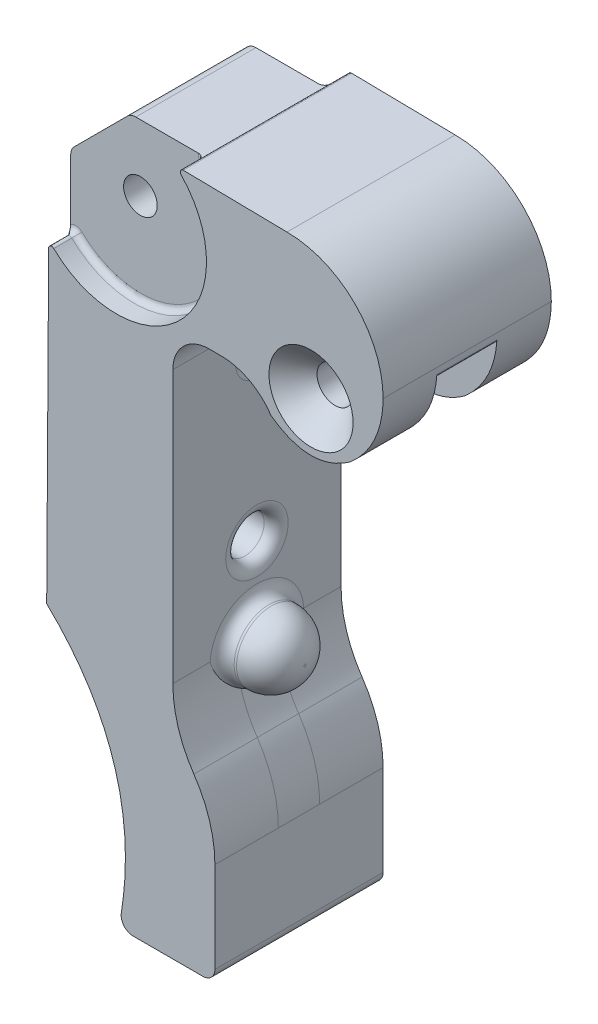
ISO-10303-21;
HEADER;
FILE_DESCRIPTION(('STEP AP214'),'2;1');
FILE_NAME('part.step','',(''),(''),'','','');
FILE_SCHEMA(('AUTOMOTIVE_DESIGN { 1 0 10303 214 1 1 1 1 }'));
ENDSEC;
DATA;
#1=APPLICATION_CONTEXT('core data for automotive mechanical design processes');
#2=APPLICATION_PROTOCOL_DEFINITION('international standard','automotive_design',2000,#1);
#3=PRODUCT_CONTEXT('',#1,'mechanical');
#4=PRODUCT('Part','Part','',(#3));
#5=PRODUCT_RELATED_PRODUCT_CATEGORY('part','',(#4));
#6=PRODUCT_DEFINITION_FORMATION('','',#4);
#7=PRODUCT_DEFINITION_CONTEXT('part definition',#1,'design');
#8=PRODUCT_DEFINITION('design','',#6,#7);
#9=PRODUCT_DEFINITION_SHAPE('','',#8);
#10=(LENGTH_UNIT() NAMED_UNIT(*) SI_UNIT(.MILLI.,.METRE.));
#11=(NAMED_UNIT(*) PLANE_ANGLE_UNIT() SI_UNIT($,.RADIAN.));
#12=(NAMED_UNIT(*) SI_UNIT($,.STERADIAN.) SOLID_ANGLE_UNIT());
#13=UNCERTAINTY_MEASURE_WITH_UNIT(LENGTH_MEASURE(1.E-05),#10,'distance_accuracy_value','');
#14=(GEOMETRIC_REPRESENTATION_CONTEXT(3) GLOBAL_UNCERTAINTY_ASSIGNED_CONTEXT((#13)) GLOBAL_UNIT_ASSIGNED_CONTEXT((#10,
#11,#12)) REPRESENTATION_CONTEXT('',''));
#15=CARTESIAN_POINT('',(0.,0.,0.));
#16=DIRECTION('',(0.,0.,1.));
#17=DIRECTION('',(1.,0.,0.));
#18=AXIS2_PLACEMENT_3D('',#15,#16,#17);
#19=CARTESIAN_POINT('',(-16.2,15.5,-2.));
#20=DIRECTION('',(0.,0.,1.));
#21=DIRECTION('',(1.,0.,0.));
#22=AXIS2_PLACEMENT_3D('',#19,#20,#21);
#23=CYLINDRICAL_SURFACE('',#22,7.5);
#24=DIRECTION('',(0.,0.,1.));
#25=VECTOR('',#24,1.);
#26=CARTESIAN_POINT('',(-10.8116495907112,20.7168649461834,-2.));
#27=LINE('',#26,#25);
#28=CARTESIAN_POINT('',(-10.8116495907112,20.7168649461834,12.));
#29=VERTEX_POINT('',#28);
#30=CARTESIAN_POINT('',(-10.8116495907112,20.7168649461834,10.5));
#31=VERTEX_POINT('',#30);
#32=EDGE_CURVE('E723',#29,#31,#27,.F.);
#33=ORIENTED_EDGE('',*,*,#32,.T.);
#34=CARTESIAN_POINT('',(-16.2,15.5,10.5));
#35=DIRECTION('',(0.,0.,1.));
#36=DIRECTION('',(1.,0.,0.));
#37=AXIS2_PLACEMENT_3D('',#34,#35,#36);
#38=CIRCLE('',#37,7.5);
#39=CARTESIAN_POINT('',(-21.4129176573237,10.1078307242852,10.5));
#40=VERTEX_POINT('',#39);
#41=EDGE_CURVE('E739',#31,#40,#38,.F.);
#42=ORIENTED_EDGE('',*,*,#41,.T.);
#43=DIRECTION('',(0.,0.,1.));
#44=VECTOR('',#43,1.);
#45=CARTESIAN_POINT('',(-21.4129176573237,10.1078307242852,-2.));
#46=LINE('',#45,#44);
#47=CARTESIAN_POINT('',(-21.4129176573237,10.1078307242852,12.));
#48=VERTEX_POINT('',#47);
#49=EDGE_CURVE('E722',#40,#48,#46,.T.);
#50=ORIENTED_EDGE('',*,*,#49,.T.);
#51=CARTESIAN_POINT('',(-16.2,15.5,12.));
#52=DIRECTION('',(0.,0.,-1.));
#53=DIRECTION('',(1.,0.,0.));
#54=AXIS2_PLACEMENT_3D('',#51,#52,#53);
#55=CIRCLE('',#54,7.5);
#56=EDGE_CURVE('E936',#29,#48,#55,.T.);
#57=ORIENTED_EDGE('',*,*,#56,.F.);
#58=EDGE_LOOP('',(#33,#42,#50,#57));
#59=FACE_BOUND('',#58,.T.);
#60=ADVANCED_FACE('F45',(#59),#23,.F.);
#61=CARTESIAN_POINT('',(-7.48331477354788,4.33521382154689,10.));
#62=DIRECTION('',(0.,0.,-1.));
#63=DIRECTION('',(-1.,0.,0.));
#64=AXIS2_PLACEMENT_3D('',#61,#62,#63);
#65=CYLINDRICAL_SURFACE('',#64,5.);
#66=DIRECTION('',(0.,0.,-1.));
#67=VECTOR('',#66,1.);
#68=CARTESIAN_POINT('',(-7.48331477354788,9.33521382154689,10.));
#69=LINE('',#68,#67);
#70=CARTESIAN_POINT('',(-7.48331477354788,9.33521382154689,12.));
#71=VERTEX_POINT('',#70);
#72=CARTESIAN_POINT('',(-7.48331477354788,9.33521382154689,7.5));
#73=VERTEX_POINT('',#72);
#74=EDGE_CURVE('E365',#71,#73,#69,.T.);
#75=ORIENTED_EDGE('',*,*,#74,.T.);
#76=CARTESIAN_POINT('',(-7.48331477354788,4.33521382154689,7.5));
#77=DIRECTION('',(0.,0.,1.));
#78=DIRECTION('',(1.,0.,0.));
#79=AXIS2_PLACEMENT_3D('',#76,#77,#78);
#80=CIRCLE('',#79,5.);
#81=CARTESIAN_POINT('',(-3.32591767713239,7.11299159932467,7.5));
#82=VERTEX_POINT('',#81);
#83=EDGE_CURVE('E336',#82,#73,#80,.T.);
#84=ORIENTED_EDGE('',*,*,#83,.F.);
#85=DIRECTION('',(0.,0.,-1.));
#86=VECTOR('',#85,1.);
#87=CARTESIAN_POINT('',(-3.32591767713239,7.11299159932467,10.));
#88=LINE('',#87,#86);
#89=CARTESIAN_POINT('',(-3.32591767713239,7.11299159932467,12.));
#90=VERTEX_POINT('',#89);
#91=EDGE_CURVE('E353',#90,#82,#88,.T.);
#92=ORIENTED_EDGE('',*,*,#91,.F.);
#93=CARTESIAN_POINT('',(-7.48331477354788,4.33521382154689,12.));
#94=DIRECTION('',(0.,0.,-1.));
#95=DIRECTION('',(1.,0.,0.));
#96=AXIS2_PLACEMENT_3D('',#93,#94,#95);
#97=CIRCLE('',#96,5.);
#98=EDGE_CURVE('E959',#71,#90,#97,.T.);
#99=ORIENTED_EDGE('',*,*,#98,.F.);
#100=EDGE_LOOP('',(#75,#84,#92,#99));
#101=FACE_BOUND('',#100,.T.);
#102=ADVANCED_FACE('F685',(#101),#65,.F.);
#103=CARTESIAN_POINT('',(-3.32591767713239,7.11299159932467,10.));
#104=CARTESIAN_POINT('',(0.,4.68195489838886,10.));
#105=CARTESIAN_POINT('',(3.32591767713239,7.11299159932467,10.));
#106=B_SPLINE_CURVE_WITH_KNOTS('',2,(#103,#104,#105),.UNSPECIFIED.,.F.,.F.,(3,3),(0.,1.),.UNSPECIFIED.);
#107=DIRECTION('',(0.,0.,-1.));
#108=VECTOR('',#107,1.);
#109=SURFACE_OF_LINEAR_EXTRUSION('',#106,#108);
#110=CARTESIAN_POINT('',(-3.32591767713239,7.11299159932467,2.5));
#111=CARTESIAN_POINT('',(0.,4.68195489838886,2.5));
#112=CARTESIAN_POINT('',(3.32591767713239,7.11299159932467,2.5));
#113=B_SPLINE_CURVE_WITH_KNOTS('',2,(#110,#111,#112),.UNSPECIFIED.,.F.,.F.,(3,3),(0.,1.),.UNSPECIFIED.);
#114=CARTESIAN_POINT('',(-3.32591767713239,7.11299159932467,2.5));
#115=VERTEX_POINT('',#114);
#116=CARTESIAN_POINT('',(3.32591767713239,7.11299159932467,2.5));
#117=VERTEX_POINT('',#116);
#118=EDGE_CURVE('E329',#115,#117,#113,.T.);
#119=ORIENTED_EDGE('',*,*,#118,.F.);
#120=CARTESIAN_POINT('',(-3.32591767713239,7.11299159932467,-2.));
#121=VERTEX_POINT('',#120);
#122=EDGE_CURVE('E343',#115,#121,#88,.T.);
#123=ORIENTED_EDGE('',*,*,#122,.T.);
#124=CARTESIAN_POINT('',(-3.32591767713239,7.11299159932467,-2.));
#125=CARTESIAN_POINT('',(0.,4.68195489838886,-2.));
#126=CARTESIAN_POINT('',(3.32591767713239,7.11299159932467,-2.));
#127=B_SPLINE_CURVE_WITH_KNOTS('',2,(#124,#125,#126),.UNSPECIFIED.,.F.,.F.,(3,3),(0.,1.),.UNSPECIFIED.);
#128=CARTESIAN_POINT('',(3.32591767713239,7.11299159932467,-2.));
#129=VERTEX_POINT('',#128);
#130=EDGE_CURVE('E1007',#121,#129,#127,.T.);
#131=ORIENTED_EDGE('',*,*,#130,.T.);
#132=DIRECTION('',(0.,0.,-1.));
#133=VECTOR('',#132,1.);
#134=CARTESIAN_POINT('',(3.32591767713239,7.11299159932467,10.));
#135=LINE('',#134,#133);
#136=EDGE_CURVE('E345',#117,#129,#135,.T.);
#137=ORIENTED_EDGE('',*,*,#136,.F.);
#138=EDGE_LOOP('',(#119,#123,#131,#137));
#139=FACE_BOUND('',#138,.T.);
#140=ADVANCED_FACE('F341',(#139),#109,.F.);
#141=CARTESIAN_POINT('',(0.,10.,-2.));
#142=DIRECTION('',(0.,0.,1.));
#143=DIRECTION('',(1.,0.,0.));
#144=AXIS2_PLACEMENT_3D('',#141,#142,#143);
#145=CYLINDRICAL_SURFACE('',#144,1.5);
#146=CARTESIAN_POINT('',(0.,10.,-2.));
#147=DIRECTION('',(0.,0.,1.));
#148=DIRECTION('',(1.,0.,0.));
#149=AXIS2_PLACEMENT_3D('',#146,#147,#148);
#150=CIRCLE('',#149,1.5);
#151=CARTESIAN_POINT('',(1.5,10.,-2.));
#152=VERTEX_POINT('',#151);
#153=EDGE_CURVE('E387',#152,#152,#150,.T.);
#154=ORIENTED_EDGE('',*,*,#153,.F.);
#155=EDGE_LOOP('',(#154));
#156=FACE_BOUND('',#155,.T.);
#157=CARTESIAN_POINT('',(0.,10.,2.85));
#158=DIRECTION('',(0.,0.,1.));
#159=DIRECTION('',(1.,0.,0.));
#160=AXIS2_PLACEMENT_3D('',#157,#158,#159);
#161=CIRCLE('',#160,1.5);
#162=CARTESIAN_POINT('',(1.5,10.,2.85));
#163=VERTEX_POINT('',#162);
#164=EDGE_CURVE('E381',#163,#163,#161,.F.);
#165=ORIENTED_EDGE('',*,*,#164,.F.);
#166=EDGE_LOOP('',(#165));
#167=FACE_BOUND('',#166,.T.);
#168=ADVANCED_FACE('F708',(#156,#167),#145,.F.);
#169=CARTESIAN_POINT('',(-21.8327495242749,10.5480172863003,-2.));
#170=DIRECTION('',(-0.999979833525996,0.00635079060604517,0.));
#171=DIRECTION('',(-0.00635079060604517,-0.999979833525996,0.));
#172=AXIS2_PLACEMENT_3D('',#169,#170,#171);
#173=PLANE('',#172);
#174=DIRECTION('',(0.,0.,1.));
#175=VECTOR('',#174,1.);
#176=CARTESIAN_POINT('',(-22.,-15.7868303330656,-2.));
#177=LINE('',#176,#175);
#178=CARTESIAN_POINT('',(-22.,-15.7868303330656,-2.));
#179=VERTEX_POINT('',#178);
#180=CARTESIAN_POINT('',(-22.,-15.7868303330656,-0.5));
#181=VERTEX_POINT('',#180);
#182=EDGE_CURVE('E786',#179,#181,#177,.T.);
#183=ORIENTED_EDGE('',*,*,#182,.T.);
#184=DIRECTION('',(-0.00635079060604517,-0.999979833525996,0.));
#185=VECTOR('',#184,1.);
#186=CARTESIAN_POINT('',(-21.8327495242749,10.5480172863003,-0.5));
#187=LINE('',#186,#185);
#188=CARTESIAN_POINT('',(-21.836676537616,9.92967944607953,-0.5));
#189=VERTEX_POINT('',#188);
#190=EDGE_CURVE('E787',#181,#189,#187,.F.);
#191=ORIENTED_EDGE('',*,*,#190,.T.);
#192=DIRECTION('',(0.,0.,1.));
#193=VECTOR('',#192,1.);
#194=CARTESIAN_POINT('',(-21.836676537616,9.92967944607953,-2.));
#195=LINE('',#194,#193);
#196=CARTESIAN_POINT('',(-21.836676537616,9.92967944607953,-2.));
#197=VERTEX_POINT('',#196);
#198=EDGE_CURVE('E1154',#189,#197,#195,.F.);
#199=ORIENTED_EDGE('',*,*,#198,.T.);
#200=DIRECTION('',(-0.00635079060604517,-0.999979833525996,0.));
#201=VECTOR('',#200,1.);
#202=CARTESIAN_POINT('',(-21.8327495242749,10.5480172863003,-2.));
#203=LINE('',#202,#201);
#204=EDGE_CURVE('E790',#197,#179,#203,.T.);
#205=ORIENTED_EDGE('',*,*,#204,.T.);
#206=EDGE_LOOP('',(#183,#191,#199,#205));
#207=FACE_BOUND('',#206,.T.);
#208=ADVANCED_FACE('F699',(#207),#173,.T.);
#209=DIRECTION('',(0.,0.,1.));
#210=VECTOR('',#209,1.);
#211=CARTESIAN_POINT('',(-21.4129176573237,10.1078307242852,-2.));
#212=LINE('',#211,#210);
#213=CARTESIAN_POINT('',(-21.4129176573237,10.1078307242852,-2.));
#214=VERTEX_POINT('',#213);
#215=CARTESIAN_POINT('',(-21.4129176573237,10.1078307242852,-0.5));
#216=VERTEX_POINT('',#215);
#217=EDGE_CURVE('E713',#214,#216,#212,.T.);
#218=ORIENTED_EDGE('',*,*,#217,.T.);
#219=CARTESIAN_POINT('',(-16.2,15.5,-0.5));
#220=DIRECTION('',(0.,0.,1.));
#221=DIRECTION('',(1.,0.,0.));
#222=AXIS2_PLACEMENT_3D('',#219,#220,#221);
#223=CIRCLE('',#222,7.5);
#224=CARTESIAN_POINT('',(-10.8116495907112,20.7168649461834,-0.5));
#225=VERTEX_POINT('',#224);
#226=EDGE_CURVE('E716',#216,#225,#223,.T.);
#227=ORIENTED_EDGE('',*,*,#226,.T.);
#228=DIRECTION('',(0.,0.,1.));
#229=VECTOR('',#228,1.);
#230=CARTESIAN_POINT('',(-10.8116495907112,20.7168649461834,-2.));
#231=LINE('',#230,#229);
#232=CARTESIAN_POINT('',(-10.8116495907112,20.7168649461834,-2.));
#233=VERTEX_POINT('',#232);
#234=EDGE_CURVE('E1054',#225,#233,#231,.F.);
#235=ORIENTED_EDGE('',*,*,#234,.T.);
#236=CARTESIAN_POINT('',(-16.2,15.5,-2.));
#237=DIRECTION('',(0.,0.,-1.));
#238=DIRECTION('',(1.,0.,0.));
#239=AXIS2_PLACEMENT_3D('',#236,#237,#238);
#240=CIRCLE('',#239,7.5);
#241=EDGE_CURVE('E719',#233,#214,#240,.T.);
#242=ORIENTED_EDGE('',*,*,#241,.T.);
#243=EDGE_LOOP('',(#218,#227,#235,#242));
#244=FACE_BOUND('',#243,.T.);
#245=ADVANCED_FACE('F688',(#244),#23,.F.);
#246=CARTESIAN_POINT('',(-2.00000000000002,21.,-2.));
#247=DIRECTION('',(0.0163084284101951,0.999867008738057,0.));
#248=DIRECTION('',(-0.999867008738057,0.0163084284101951,0.));
#249=AXIS2_PLACEMENT_3D('',#246,#247,#248);
#250=PLANE('',#249);
#251=DIRECTION('',(-0.999867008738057,0.0163084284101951,0.));
#252=VECTOR('',#251,1.);
#253=CARTESIAN_POINT('',(-2.00000000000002,21.,-2.));
#254=LINE('',#253,#252);
#255=CARTESIAN_POINT('',(-2.00000000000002,21.,-2.));
#256=VERTEX_POINT('',#255);
#257=CARTESIAN_POINT('',(-10.627960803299,21.140727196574,-2.));
#258=VERTEX_POINT('',#257);
#259=EDGE_CURVE('E821',#256,#258,#254,.T.);
#260=ORIENTED_EDGE('',*,*,#259,.T.);
#261=DIRECTION('',(0.,0.,1.));
#262=VECTOR('',#261,1.);
#263=CARTESIAN_POINT('',(-10.627960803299,21.140727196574,-2.));
#264=LINE('',#263,#262);
#265=CARTESIAN_POINT('',(-10.627960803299,21.140727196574,12.));
#266=VERTEX_POINT('',#265);
#267=EDGE_CURVE('E1030',#258,#266,#264,.T.);
#268=ORIENTED_EDGE('',*,*,#267,.T.);
#269=DIRECTION('',(-0.999867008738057,0.0163084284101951,0.));
#270=VECTOR('',#269,1.);
#271=CARTESIAN_POINT('',(-2.00000000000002,21.,12.));
#272=LINE('',#271,#270);
#273=CARTESIAN_POINT('',(-2.00000000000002,21.,12.));
#274=VERTEX_POINT('',#273);
#275=EDGE_CURVE('E981',#274,#266,#272,.T.);
#276=ORIENTED_EDGE('',*,*,#275,.F.);
#277=DIRECTION('',(0.,0.,-1.));
#278=VECTOR('',#277,1.);
#279=CARTESIAN_POINT('',(-2.00000000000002,21.,10.));
#280=LINE('',#279,#278);
#281=EDGE_CURVE('E375',#274,#256,#280,.T.);
#282=ORIENTED_EDGE('',*,*,#281,.T.);
#283=EDGE_LOOP('',(#260,#268,#276,#282));
#284=FACE_BOUND('',#283,.T.);
#285=ADVANCED_FACE('F698',(#284),#250,.T.);
#286=DIRECTION('',(0.,0.,1.));
#287=VECTOR('',#286,1.);
#288=CARTESIAN_POINT('',(-21.836676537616,9.92967944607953,-2.));
#289=LINE('',#288,#287);
#290=CARTESIAN_POINT('',(-21.836676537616,9.92967944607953,12.));
#291=VERTEX_POINT('',#290);
#292=CARTESIAN_POINT('',(-21.836676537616,9.92967944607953,10.5));
#293=VERTEX_POINT('',#292);
#294=EDGE_CURVE('E816',#291,#293,#289,.F.);
#295=ORIENTED_EDGE('',*,*,#294,.T.);
#296=DIRECTION('',(-0.00635079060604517,-0.999979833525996,0.));
#297=VECTOR('',#296,1.);
#298=CARTESIAN_POINT('',(-21.8327495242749,10.5480172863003,10.5));
#299=LINE('',#298,#297);
#300=CARTESIAN_POINT('',(-22.,-15.7868303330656,10.5));
#301=VERTEX_POINT('',#300);
#302=EDGE_CURVE('E744',#293,#301,#299,.T.);
#303=ORIENTED_EDGE('',*,*,#302,.T.);
#304=CARTESIAN_POINT('',(-22.,-15.7868303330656,12.));
#305=VERTEX_POINT('',#304);
#306=EDGE_CURVE('E794',#301,#305,#177,.T.);
#307=ORIENTED_EDGE('',*,*,#306,.T.);
#308=DIRECTION('',(-0.00635079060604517,-0.999979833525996,0.));
#309=VECTOR('',#308,1.);
#310=CARTESIAN_POINT('',(-21.8327495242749,10.5480172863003,12.));
#311=LINE('',#310,#309);
#312=EDGE_CURVE('E939',#291,#305,#311,.T.);
#313=ORIENTED_EDGE('',*,*,#312,.F.);
#314=EDGE_LOOP('',(#295,#303,#307,#313));
#315=FACE_BOUND('',#314,.T.);
#316=ADVANCED_FACE('F705',(#315),#173,.T.);
#317=CARTESIAN_POINT('',(-16.2,15.5,-2.));
#318=DIRECTION('',(0.,0.,1.));
#319=DIRECTION('',(1.,0.,0.));
#320=AXIS2_PLACEMENT_3D('',#317,#318,#319);
#321=PLANE('',#320);
#322=ORIENTED_EDGE('',*,*,#153,.T.);
#323=EDGE_LOOP('',(#322));
#324=FACE_BOUND('',#323,.T.);
#325=ORIENTED_EDGE('',*,*,#204,.F.);
#326=CARTESIAN_POINT('',(-21.5866815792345,9.92809174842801,-2.));
#327=DIRECTION('',(0.,0.,1.));
#328=DIRECTION('',(1.,0.,0.));
#329=AXIS2_PLACEMENT_3D('',#326,#327,#328);
#330=CIRCLE('',#329,0.25);
#331=EDGE_CURVE('E1039',#197,#214,#330,.F.);
#332=ORIENTED_EDGE('',*,*,#331,.T.);
#333=ORIENTED_EDGE('',*,*,#241,.F.);
#334=CARTESIAN_POINT('',(-10.6320379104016,20.8907604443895,-2.));
#335=DIRECTION('',(0.,0.,1.));
#336=DIRECTION('',(1.,0.,0.));
#337=AXIS2_PLACEMENT_3D('',#334,#335,#336);
#338=CIRCLE('',#337,0.25);
#339=EDGE_CURVE('E1035',#233,#258,#338,.F.);
#340=ORIENTED_EDGE('',*,*,#339,.T.);
#341=ORIENTED_EDGE('',*,*,#259,.F.);
#342=CARTESIAN_POINT('',(-2.00000000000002,13.,-2.));
#343=DIRECTION('',(0.,0.,1.));
#344=DIRECTION('',(1.,0.,0.));
#345=AXIS2_PLACEMENT_3D('',#342,#343,#344);
#346=CIRCLE('',#345,8.);
#347=CARTESIAN_POINT('',(5.99999999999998,13.,-2.));
#348=VERTEX_POINT('',#347);
#349=EDGE_CURVE('E1019',#348,#256,#346,.T.);
#350=ORIENTED_EDGE('',*,*,#349,.F.);
#351=CARTESIAN_POINT('',(3.32591767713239,7.11299159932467,-2.));
#352=CARTESIAN_POINT('',(5.9554891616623,9.42035715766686,-2.));
#353=CARTESIAN_POINT('',(5.99999999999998,13.,-2.));
#354=B_SPLINE_CURVE_WITH_KNOTS('',2,(#351,#352,#353),.UNSPECIFIED.,.F.,.F.,(3,3),(0.,1.),.UNSPECIFIED.);
#355=EDGE_CURVE('E1011',#129,#348,#354,.T.);
#356=ORIENTED_EDGE('',*,*,#355,.F.);
#357=ORIENTED_EDGE('',*,*,#130,.F.);
#358=CARTESIAN_POINT('',(-7.48331477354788,4.33521382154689,-2.));
#359=DIRECTION('',(0.,0.,-1.));
#360=DIRECTION('',(1.,0.,0.));
#361=AXIS2_PLACEMENT_3D('',#358,#359,#360);
#362=CIRCLE('',#361,5.);
#363=CARTESIAN_POINT('',(-7.48331477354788,9.33521382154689,-2.));
#364=VERTEX_POINT('',#363);
#365=EDGE_CURVE('E352',#364,#121,#362,.T.);
#366=ORIENTED_EDGE('',*,*,#365,.F.);
#367=DIRECTION('',(1.,0.,0.));
#368=VECTOR('',#367,1.);
#369=CARTESIAN_POINT('',(-8.50000000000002,9.33521382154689,-2.));
#370=LINE('',#369,#368);
#371=CARTESIAN_POINT('',(-8.50000000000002,9.33521382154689,-2.));
#372=VERTEX_POINT('',#371);
#373=EDGE_CURVE('E1003',#372,#364,#370,.T.);
#374=ORIENTED_EDGE('',*,*,#373,.F.);
#375=CARTESIAN_POINT('',(-8.50000000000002,6.33521382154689,-2.));
#376=DIRECTION('',(0.,0.,-1.));
#377=DIRECTION('',(-1.,0.,0.));
#378=AXIS2_PLACEMENT_3D('',#375,#376,#377);
#379=CIRCLE('',#378,3.);
#380=CARTESIAN_POINT('',(-11.5,6.33521382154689,-2.));
#381=VERTEX_POINT('',#380);
#382=EDGE_CURVE('E1000',#381,#372,#379,.T.);
#383=ORIENTED_EDGE('',*,*,#382,.F.);
#384=DIRECTION('',(0.,1.,0.));
#385=VECTOR('',#384,1.);
#386=CARTESIAN_POINT('',(-11.5,-19.9999999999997,-2.));
#387=LINE('',#386,#385);
#388=CARTESIAN_POINT('',(-11.5,-16.2966875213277,-2.));
#389=VERTEX_POINT('',#388);
#390=EDGE_CURVE('E998',#389,#381,#387,.T.);
#391=ORIENTED_EDGE('',*,*,#390,.F.);
#392=CARTESIAN_POINT('',(-1.50000000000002,-16.2966875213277,-2.));
#393=DIRECTION('',(0.,0.,1.));
#394=DIRECTION('',(1.,0.,0.));
#395=AXIS2_PLACEMENT_3D('',#392,#393,#394);
#396=CIRCLE('',#395,10.);
#397=CARTESIAN_POINT('',(-9.75000000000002,-21.9480147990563,-2.));
#398=VERTEX_POINT('',#397);
#399=EDGE_CURVE('E1118',#389,#398,#396,.T.);
#400=ORIENTED_EDGE('',*,*,#399,.T.);
#401=CARTESIAN_POINT('',(-18.,-27.599342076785,-2.));
#402=DIRECTION('',(0.,0.,1.));
#403=DIRECTION('',(1.,0.,0.));
#404=AXIS2_PLACEMENT_3D('',#401,#402,#403);
#405=CIRCLE('',#404,10.);
#406=CARTESIAN_POINT('',(-8.00000000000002,-27.599342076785,-2.));
#407=VERTEX_POINT('',#406);
#408=EDGE_CURVE('E414',#398,#407,#405,.F.);
#409=ORIENTED_EDGE('',*,*,#408,.T.);
#410=DIRECTION('',(0.,1.,0.));
#411=VECTOR('',#410,1.);
#412=CARTESIAN_POINT('',(-8.00000000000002,-21.9999999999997,-2.));
#413=LINE('',#412,#411);
#414=CARTESIAN_POINT('',(-8.00000000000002,-35.1499999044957,-2.));
#415=VERTEX_POINT('',#414);
#416=EDGE_CURVE('E995',#415,#407,#413,.T.);
#417=ORIENTED_EDGE('',*,*,#416,.F.);
#418=CARTESIAN_POINT('',(-9.00000000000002,-35.1499999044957,-2.));
#419=DIRECTION('',(0.,0.,1.));
#420=DIRECTION('',(1.,0.,0.));
#421=AXIS2_PLACEMENT_3D('',#418,#419,#420);
#422=CIRCLE('',#421,1.);
#423=CARTESIAN_POINT('',(-9.00000000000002,-36.1499999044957,-2.));
#424=VERTEX_POINT('',#423);
#425=EDGE_CURVE('E868',#415,#424,#422,.F.);
#426=ORIENTED_EDGE('',*,*,#425,.T.);
#427=DIRECTION('',(1.,0.,0.));
#428=VECTOR('',#427,1.);
#429=CARTESIAN_POINT('',(-8.00000000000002,-36.1499999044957,-2.));
#430=LINE('',#429,#428);
#431=CARTESIAN_POINT('',(-14.8038528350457,-36.1499999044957,-2.));
#432=VERTEX_POINT('',#431);
#433=EDGE_CURVE('E990',#432,#424,#430,.T.);
#434=ORIENTED_EDGE('',*,*,#433,.F.);
#435=CARTESIAN_POINT('',(-14.8038528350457,-35.1499999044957,-2.));
#436=DIRECTION('',(0.,0.,1.));
#437=DIRECTION('',(1.,0.,0.));
#438=AXIS2_PLACEMENT_3D('',#435,#436,#437);
#439=CIRCLE('',#438,1.);
#440=CARTESIAN_POINT('',(-15.791252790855,-34.9917553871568,-2.));
#441=VERTEX_POINT('',#440);
#442=EDGE_CURVE('E866',#432,#441,#439,.F.);
#443=ORIENTED_EDGE('',*,*,#442,.T.);
#444=CARTESIAN_POINT('',(-22.,-15.7868303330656,-2.));
#445=CARTESIAN_POINT('',(-13.5446368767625,-23.8649356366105,-2.));
#446=CARTESIAN_POINT('',(-16.,-36.1499999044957,-2.));
#447=B_SPLINE_CURVE_WITH_KNOTS('',2,(#444,#445,#446),.UNSPECIFIED.,.F.,.F.,(3,3),(0.,1.),.UNSPECIFIED.);
#448=EDGE_CURVE('E986',#179,#441,#447,.T.);
#449=ORIENTED_EDGE('',*,*,#448,.F.);
#450=EDGE_LOOP('',(#325,#332,#333,#340,#341,#350,#356,#357,#366,#374,#383,#391,#400,#409,#417,
#426,#434,#443,#449));
#451=FACE_BOUND('',#450,.T.);
#452=ADVANCED_FACE('F1155',(#324,#451),#321,.F.);
#453=CARTESIAN_POINT('',(-16.2,15.5,12.));
#454=DIRECTION('',(0.,0.,1.));
#455=DIRECTION('',(1.,0.,0.));
#456=AXIS2_PLACEMENT_3D('',#453,#454,#455);
#457=PLANE('',#456);
#458=CARTESIAN_POINT('',(0.,10.,12.));
#459=DIRECTION('',(0.,0.,1.));
#460=DIRECTION('',(1.,0.,0.));
#461=AXIS2_PLACEMENT_3D('',#458,#459,#460);
#462=CIRCLE('',#461,3.50000000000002);
#463=CARTESIAN_POINT('',(3.50000000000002,10.,12.));
#464=VERTEX_POINT('',#463);
#465=EDGE_CURVE('E1068',#464,#464,#462,.F.);
#466=ORIENTED_EDGE('',*,*,#465,.T.);
#467=EDGE_LOOP('',(#466));
#468=FACE_BOUND('',#467,.T.);
#469=ORIENTED_EDGE('',*,*,#56,.T.);
#470=CARTESIAN_POINT('',(-21.5866815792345,9.92809174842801,12.));
#471=DIRECTION('',(0.,0.,1.));
#472=DIRECTION('',(1.,0.,0.));
#473=AXIS2_PLACEMENT_3D('',#470,#471,#472);
#474=CIRCLE('',#473,0.25);
#475=EDGE_CURVE('E1151',#48,#291,#474,.T.);
#476=ORIENTED_EDGE('',*,*,#475,.T.);
#477=ORIENTED_EDGE('',*,*,#312,.T.);
#478=CARTESIAN_POINT('',(-22.,-15.7868303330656,12.));
#479=CARTESIAN_POINT('',(-13.5446368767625,-23.8649356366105,12.));
#480=CARTESIAN_POINT('',(-16.,-36.1499999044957,12.));
#481=B_SPLINE_CURVE_WITH_KNOTS('',2,(#478,#479,#480),.UNSPECIFIED.,.F.,.F.,(3,3),(0.,1.),.UNSPECIFIED.);
#482=CARTESIAN_POINT('',(-15.791252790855,-34.9917553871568,12.));
#483=VERTEX_POINT('',#482);
#484=EDGE_CURVE('E820',#305,#483,#481,.T.);
#485=ORIENTED_EDGE('',*,*,#484,.T.);
#486=CARTESIAN_POINT('',(-14.8038528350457,-35.1499999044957,12.));
#487=DIRECTION('',(0.,0.,1.));
#488=DIRECTION('',(1.,0.,0.));
#489=AXIS2_PLACEMENT_3D('',#486,#487,#488);
#490=CIRCLE('',#489,1.);
#491=CARTESIAN_POINT('',(-14.8038528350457,-36.1499999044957,12.));
#492=VERTEX_POINT('',#491);
#493=EDGE_CURVE('E860',#483,#492,#490,.T.);
#494=ORIENTED_EDGE('',*,*,#493,.T.);
#495=DIRECTION('',(1.,0.,0.));
#496=VECTOR('',#495,1.);
#497=CARTESIAN_POINT('',(-8.00000000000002,-36.1499999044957,12.));
#498=LINE('',#497,#496);
#499=CARTESIAN_POINT('',(-9.00000000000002,-36.1499999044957,12.));
#500=VERTEX_POINT('',#499);
#501=EDGE_CURVE('E944',#492,#500,#498,.T.);
#502=ORIENTED_EDGE('',*,*,#501,.T.);
#503=CARTESIAN_POINT('',(-9.00000000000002,-35.1499999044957,12.));
#504=DIRECTION('',(0.,0.,1.));
#505=DIRECTION('',(1.,0.,0.));
#506=AXIS2_PLACEMENT_3D('',#503,#504,#505);
#507=CIRCLE('',#506,1.);
#508=CARTESIAN_POINT('',(-8.00000000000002,-35.1499999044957,12.));
#509=VERTEX_POINT('',#508);
#510=EDGE_CURVE('E862',#500,#509,#507,.T.);
#511=ORIENTED_EDGE('',*,*,#510,.T.);
#512=DIRECTION('',(0.,1.,0.));
#513=VECTOR('',#512,1.);
#514=CARTESIAN_POINT('',(-8.00000000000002,-21.9999999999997,12.));
#515=LINE('',#514,#513);
#516=CARTESIAN_POINT('',(-8.00000000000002,-27.599342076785,12.));
#517=VERTEX_POINT('',#516);
#518=EDGE_CURVE('E949',#509,#517,#515,.T.);
#519=ORIENTED_EDGE('',*,*,#518,.T.);
#520=CARTESIAN_POINT('',(-18.,-27.599342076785,12.));
#521=DIRECTION('',(0.,0.,1.));
#522=DIRECTION('',(1.,0.,0.));
#523=AXIS2_PLACEMENT_3D('',#520,#521,#522);
#524=CIRCLE('',#523,10.);
#525=CARTESIAN_POINT('',(-9.75000000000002,-21.9480147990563,12.));
#526=VERTEX_POINT('',#525);
#527=EDGE_CURVE('E876',#517,#526,#524,.T.);
#528=ORIENTED_EDGE('',*,*,#527,.T.);
#529=CARTESIAN_POINT('',(-1.50000000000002,-16.2966875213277,12.));
#530=DIRECTION('',(0.,0.,1.));
#531=DIRECTION('',(1.,0.,0.));
#532=AXIS2_PLACEMENT_3D('',#529,#530,#531);
#533=CIRCLE('',#532,10.);
#534=CARTESIAN_POINT('',(-11.5,-16.2966875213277,12.));
#535=VERTEX_POINT('',#534);
#536=EDGE_CURVE('E1120',#526,#535,#533,.F.);
#537=ORIENTED_EDGE('',*,*,#536,.T.);
#538=DIRECTION('',(0.,1.,0.));
#539=VECTOR('',#538,1.);
#540=CARTESIAN_POINT('',(-11.5,-19.9999999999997,12.));
#541=LINE('',#540,#539);
#542=CARTESIAN_POINT('',(-11.5,6.33521382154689,12.));
#543=VERTEX_POINT('',#542);
#544=EDGE_CURVE('E951',#535,#543,#541,.T.);
#545=ORIENTED_EDGE('',*,*,#544,.T.);
#546=CARTESIAN_POINT('',(-8.50000000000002,6.33521382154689,12.));
#547=DIRECTION('',(0.,0.,-1.));
#548=DIRECTION('',(-1.,0.,0.));
#549=AXIS2_PLACEMENT_3D('',#546,#547,#548);
#550=CIRCLE('',#549,3.);
#551=CARTESIAN_POINT('',(-8.50000000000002,9.33521382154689,12.));
#552=VERTEX_POINT('',#551);
#553=EDGE_CURVE('E953',#543,#552,#550,.T.);
#554=ORIENTED_EDGE('',*,*,#553,.T.);
#555=DIRECTION('',(1.,0.,0.));
#556=VECTOR('',#555,1.);
#557=CARTESIAN_POINT('',(-8.50000000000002,9.33521382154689,12.));
#558=LINE('',#557,#556);
#559=EDGE_CURVE('E956',#552,#71,#558,.T.);
#560=ORIENTED_EDGE('',*,*,#559,.T.);
#561=ORIENTED_EDGE('',*,*,#98,.T.);
#562=CARTESIAN_POINT('',(-3.32591767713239,7.11299159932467,12.));
#563=CARTESIAN_POINT('',(0.,4.68195489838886,12.));
#564=CARTESIAN_POINT('',(3.32591767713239,7.11299159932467,12.));
#565=B_SPLINE_CURVE_WITH_KNOTS('',2,(#562,#563,#564),.UNSPECIFIED.,.F.,.F.,(3,3),(0.,1.),.UNSPECIFIED.);
#566=CARTESIAN_POINT('',(3.32591767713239,7.11299159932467,12.));
#567=VERTEX_POINT('',#566);
#568=EDGE_CURVE('E962',#90,#567,#565,.T.);
#569=ORIENTED_EDGE('',*,*,#568,.T.);
#570=CARTESIAN_POINT('',(3.32591767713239,7.11299159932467,12.));
#571=CARTESIAN_POINT('',(5.9554891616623,9.42035715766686,12.));
#572=CARTESIAN_POINT('',(5.99999999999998,13.,12.));
#573=B_SPLINE_CURVE_WITH_KNOTS('',2,(#570,#571,#572),.UNSPECIFIED.,.F.,.F.,(3,3),(0.,1.),.UNSPECIFIED.);
#574=CARTESIAN_POINT('',(5.99999999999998,13.,12.));
#575=VERTEX_POINT('',#574);
#576=EDGE_CURVE('E967',#567,#575,#573,.T.);
#577=ORIENTED_EDGE('',*,*,#576,.T.);
#578=CARTESIAN_POINT('',(-2.00000000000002,13.,12.));
#579=DIRECTION('',(0.,0.,1.));
#580=DIRECTION('',(1.,0.,0.));
#581=AXIS2_PLACEMENT_3D('',#578,#579,#580);
#582=CIRCLE('',#581,8.);
#583=EDGE_CURVE('E975',#575,#274,#582,.T.);
#584=ORIENTED_EDGE('',*,*,#583,.T.);
#585=ORIENTED_EDGE('',*,*,#275,.T.);
#586=CARTESIAN_POINT('',(-10.6320379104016,20.8907604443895,12.));
#587=DIRECTION('',(0.,0.,1.));
#588=DIRECTION('',(1.,0.,0.));
#589=AXIS2_PLACEMENT_3D('',#586,#587,#588);
#590=CIRCLE('',#589,0.25);
#591=EDGE_CURVE('E1037',#266,#29,#590,.T.);
#592=ORIENTED_EDGE('',*,*,#591,.T.);
#593=EDGE_LOOP('',(#469,#476,#477,#485,#494,#502,#511,#519,#528,#537,#545,#554,#560,#561,#569,
#577,#584,#585,#592));
#594=FACE_BOUND('',#593,.T.);
#595=ADVANCED_FACE('F590',(#468,#594),#457,.T.);
#596=ORIENTED_EDGE('',*,*,#91,.T.);
#597=CARTESIAN_POINT('',(-3.32591767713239,7.11299159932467,7.5));
#598=CARTESIAN_POINT('',(0.,4.68195489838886,7.5));
#599=CARTESIAN_POINT('',(3.32591767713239,7.11299159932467,7.5));
#600=B_SPLINE_CURVE_WITH_KNOTS('',2,(#597,#598,#599),.UNSPECIFIED.,.F.,.F.,(3,3),(0.,1.),.UNSPECIFIED.);
#601=CARTESIAN_POINT('',(3.32591767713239,7.11299159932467,7.5));
#602=VERTEX_POINT('',#601);
#603=EDGE_CURVE('E917',#82,#602,#600,.T.);
#604=ORIENTED_EDGE('',*,*,#603,.T.);
#605=EDGE_CURVE('E337',#567,#602,#135,.T.);
#606=ORIENTED_EDGE('',*,*,#605,.F.);
#607=ORIENTED_EDGE('',*,*,#568,.F.);
#608=EDGE_LOOP('',(#596,#604,#606,#607));
#609=FACE_BOUND('',#608,.T.);
#610=ADVANCED_FACE('F585',(#609),#109,.F.);
#611=CARTESIAN_POINT('',(3.32591767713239,7.11299159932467,10.));
#612=CARTESIAN_POINT('',(5.9554891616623,9.42035715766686,10.));
#613=CARTESIAN_POINT('',(5.99999999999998,13.,10.));
#614=B_SPLINE_CURVE_WITH_KNOTS('',2,(#611,#612,#613),.UNSPECIFIED.,.F.,.F.,(3,3),(0.,1.),.UNSPECIFIED.);
#615=DIRECTION('',(0.,0.,-1.));
#616=VECTOR('',#615,1.);
#617=SURFACE_OF_LINEAR_EXTRUSION('',#614,#616);
#618=CARTESIAN_POINT('',(3.32591767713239,7.11299159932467,7.5));
#619=CARTESIAN_POINT('',(5.9554891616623,9.42035715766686,7.5));
#620=CARTESIAN_POINT('',(5.99999999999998,13.,7.5));
#621=B_SPLINE_CURVE_WITH_KNOTS('',2,(#618,#619,#620),.UNSPECIFIED.,.F.,.F.,(3,3),(0.,1.),.UNSPECIFIED.);
#622=CARTESIAN_POINT('',(5.97939245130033,12.4791911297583,7.5));
#623=VERTEX_POINT('',#622);
#624=EDGE_CURVE('E385',#602,#623,#621,.T.);
#625=ORIENTED_EDGE('',*,*,#624,.T.);
#626=DIRECTION('',(0.,0.,-1.));
#627=VECTOR('',#626,1.);
#628=CARTESIAN_POINT('',(5.97939245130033,12.4791911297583,7.5));
#629=LINE('',#628,#627);
#630=CARTESIAN_POINT('',(5.97939245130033,12.4791911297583,2.5));
#631=VERTEX_POINT('',#630);
#632=EDGE_CURVE('E1140',#623,#631,#629,.T.);
#633=ORIENTED_EDGE('',*,*,#632,.T.);
#634=CARTESIAN_POINT('',(3.32591767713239,7.11299159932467,2.5));
#635=CARTESIAN_POINT('',(5.9554891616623,9.42035715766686,2.5));
#636=CARTESIAN_POINT('',(5.99999999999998,13.,2.5));
#637=B_SPLINE_CURVE_WITH_KNOTS('',2,(#634,#635,#636),.UNSPECIFIED.,.F.,.F.,(3,3),(0.,1.),.UNSPECIFIED.);
#638=EDGE_CURVE('E346',#117,#631,#637,.T.);
#639=ORIENTED_EDGE('',*,*,#638,.F.);
#640=ORIENTED_EDGE('',*,*,#136,.T.);
#641=ORIENTED_EDGE('',*,*,#355,.T.);
#642=DIRECTION('',(0.,0.,-1.));
#643=VECTOR('',#642,1.);
#644=CARTESIAN_POINT('',(5.99999999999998,13.,10.));
#645=LINE('',#644,#643);
#646=EDGE_CURVE('E377',#575,#348,#645,.T.);
#647=ORIENTED_EDGE('',*,*,#646,.F.);
#648=ORIENTED_EDGE('',*,*,#576,.F.);
#649=ORIENTED_EDGE('',*,*,#605,.T.);
#650=EDGE_LOOP('',(#625,#633,#639,#640,#641,#647,#648,#649));
#651=FACE_BOUND('',#650,.T.);
#652=ADVANCED_FACE('F589',(#651),#617,.F.);
#653=CARTESIAN_POINT('',(-2.00000000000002,13.,10.));
#654=DIRECTION('',(0.,0.,-1.));
#655=DIRECTION('',(-1.,0.,0.));
#656=AXIS2_PLACEMENT_3D('',#653,#654,#655);
#657=CYLINDRICAL_SURFACE('',#656,8.);
#658=ORIENTED_EDGE('',*,*,#646,.T.);
#659=ORIENTED_EDGE('',*,*,#349,.T.);
#660=ORIENTED_EDGE('',*,*,#281,.F.);
#661=ORIENTED_EDGE('',*,*,#583,.F.);
#662=EDGE_LOOP('',(#658,#659,#660,#661));
#663=FACE_BOUND('',#662,.T.);
#664=ADVANCED_FACE('F1192',(#663),#657,.T.);
#665=CARTESIAN_POINT('',(0.,21.,10.));
#666=DIRECTION('',(0.,-1.,0.));
#667=DIRECTION('',(1.,0.,0.));
#668=AXIS2_PLACEMENT_3D('',#665,#666,#667);
#669=PLANE('',#668);
#670=DIRECTION('',(0.,0.,1.));
#671=VECTOR('',#670,1.);
#672=CARTESIAN_POINT('',(-10.8569083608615,21.,10.));
#673=LINE('',#672,#671);
#674=CARTESIAN_POINT('',(-10.8569083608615,21.,10.5));
#675=VERTEX_POINT('',#674);
#676=CARTESIAN_POINT('',(-10.8569083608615,21.,-0.5));
#677=VERTEX_POINT('',#676);
#678=EDGE_CURVE('E1038',#675,#677,#673,.F.);
#679=ORIENTED_EDGE('',*,*,#678,.T.);
#680=CARTESIAN_POINT('',(-10.8569083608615,21.,-0.5));
#681=CARTESIAN_POINT('',(-10.856867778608,21.,-0.4741261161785));
#682=CARTESIAN_POINT('',(-10.8591415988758,21.,-0.448295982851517));
#683=CARTESIAN_POINT('',(-10.8679412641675,21.,-0.397470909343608));
#684=CARTESIAN_POINT('',(-10.8744499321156,21.,-0.372473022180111));
#685=CARTESIAN_POINT('',(-10.8914025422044,21.,-0.323684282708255));
#686=CARTESIAN_POINT('',(-10.901871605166,21.,-0.299902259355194));
#687=CARTESIAN_POINT('',(-10.9263000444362,21.,-0.254177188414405));
#688=CARTESIAN_POINT('',(-10.9402638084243,21.,-0.232236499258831));
#689=CARTESIAN_POINT('',(-10.9728109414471,21.,-0.188597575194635));
#690=CARTESIAN_POINT('',(-10.9917144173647,21.,-0.167137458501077));
#691=CARTESIAN_POINT('',(-11.0327178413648,21.,-0.127530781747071));
#692=CARTESIAN_POINT('',(-11.0548178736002,21.,-0.109384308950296));
#693=CARTESIAN_POINT('',(-11.1026772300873,21.,-0.0761798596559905));
#694=CARTESIAN_POINT('',(-11.1285539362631,21.,-0.0612906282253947));
#695=CARTESIAN_POINT('',(-11.1824580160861,21.,-0.036123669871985));
#696=CARTESIAN_POINT('',(-11.210484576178,21.,-0.0258442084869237));
#697=CARTESIAN_POINT('',(-11.2611314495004,21.,-0.0120761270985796));
#698=CARTESIAN_POINT('',(-11.2834778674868,21.,-0.00756020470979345));
#699=CARTESIAN_POINT('',(-11.3285587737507,21.,-0.00151918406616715));
#700=CARTESIAN_POINT('',(-11.3512930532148,21.,7.47526932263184E-06));
#701=CARTESIAN_POINT('',(-11.3740397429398,21.,0.));
#702=B_SPLINE_CURVE_WITH_KNOTS('',3,(#680,#681,#682,#683,#684,#685,#686,#687,#688,#689,#690,
#691,#692,#693,#694,#695,#696,#697,#698,#699,#700,#701),.UNSPECIFIED.,.F.,.F.,(4,2,2,2,2,2,2,2,
2,2,4),(0.,0.0774531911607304,0.154594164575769,0.232232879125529,0.309969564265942,
0.395386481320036,0.480805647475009,0.569941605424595,0.659043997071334,0.727246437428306,
0.795413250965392),.UNSPECIFIED.);
#703=CARTESIAN_POINT('',(-11.3740397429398,21.,0.));
#704=VERTEX_POINT('',#703);
#705=EDGE_CURVE('E742',#677,#704,#702,.T.);
#706=ORIENTED_EDGE('',*,*,#705,.T.);
#707=DIRECTION('',(-1.,0.,0.));
#708=VECTOR('',#707,1.);
#709=CARTESIAN_POINT('',(0.,21.,0.));
#710=LINE('',#709,#708);
#711=CARTESIAN_POINT('',(-16.5857864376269,21.,0.));
#712=VERTEX_POINT('',#711);
#713=EDGE_CURVE('E1739',#704,#712,#710,.T.);
#714=ORIENTED_EDGE('',*,*,#713,.T.);
#715=DIRECTION('',(0.,0.,-1.));
#716=VECTOR('',#715,1.);
#717=CARTESIAN_POINT('',(-16.5857864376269,21.,10.));
#718=LINE('',#717,#716);
#719=CARTESIAN_POINT('',(-16.5857864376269,21.,10.));
#720=VERTEX_POINT('',#719);
#721=EDGE_CURVE('E839',#712,#720,#718,.F.);
#722=ORIENTED_EDGE('',*,*,#721,.T.);
#723=DIRECTION('',(-1.,0.,0.));
#724=VECTOR('',#723,1.);
#725=CARTESIAN_POINT('',(0.,21.,10.));
#726=LINE('',#725,#724);
#727=CARTESIAN_POINT('',(-11.3740397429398,21.,10.));
#728=VERTEX_POINT('',#727);
#729=EDGE_CURVE('E607',#728,#720,#726,.T.);
#730=ORIENTED_EDGE('',*,*,#729,.F.);
#731=CARTESIAN_POINT('',(-11.3740397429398,21.,10.));
#732=CARTESIAN_POINT('',(-11.3419967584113,21.,9.99996073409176));
#733=CARTESIAN_POINT('',(-11.3099729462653,21.,10.0030114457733));
#734=CARTESIAN_POINT('',(-11.247121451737,21.,10.0149447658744));
#735=CARTESIAN_POINT('',(-11.216290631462,21.,10.0238107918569));
#736=CARTESIAN_POINT('',(-11.1595458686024,21.,10.0459543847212));
#737=CARTESIAN_POINT('',(-11.133441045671,21.,10.0587469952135));
#738=CARTESIAN_POINT('',(-11.0836880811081,21.,10.088445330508));
#739=CARTESIAN_POINT('',(-11.0600398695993,21.,10.1053509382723));
#740=CARTESIAN_POINT('',(-11.0153725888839,21.,10.1431740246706));
#741=CARTESIAN_POINT('',(-10.9944163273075,21.,10.1641656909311));
#742=CARTESIAN_POINT('',(-10.956284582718,21.,10.2093743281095));
#743=CARTESIAN_POINT('',(-10.9391121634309,21.,10.2335938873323));
#744=CARTESIAN_POINT('',(-10.9091064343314,21.,10.284707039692));
#745=CARTESIAN_POINT('',(-10.8962884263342,21.,10.3116096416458));
#746=CARTESIAN_POINT('',(-10.8757593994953,21.,10.3672642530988));
#747=CARTESIAN_POINT('',(-10.8680351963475,21.,10.3960112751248));
#748=CARTESIAN_POINT('',(-10.8610784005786,21.,10.4375580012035));
#749=CARTESIAN_POINT('',(-10.8595175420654,21.,10.4499975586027));
#750=CARTESIAN_POINT('',(-10.8574322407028,21.,10.4749555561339));
#751=CARTESIAN_POINT('',(-10.8569071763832,21.,10.4874739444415));
#752=CARTESIAN_POINT('',(-10.8569083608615,21.,10.5));
#753=B_SPLINE_CURVE_WITH_KNOTS('',3,(#731,#732,#733,#734,#735,#736,#737,#738,#739,#740,#741,
#742,#743,#744,#745,#746,#747,#748,#749,#750,#751,#752),.UNSPECIFIED.,.F.,.F.,(4,2,2,2,2,2,2,2,
2,2,4),(0.,0.0959589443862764,0.191645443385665,0.278464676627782,0.365281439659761,
0.453853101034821,0.542496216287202,0.631447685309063,0.720168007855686,0.757742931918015,
0.795295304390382),.UNSPECIFIED.);
#754=EDGE_CURVE('E772',#728,#675,#753,.T.);
#755=ORIENTED_EDGE('',*,*,#754,.T.);
#756=EDGE_LOOP('',(#679,#706,#714,#722,#730,#755));
#757=FACE_BOUND('',#756,.T.);
#758=ADVANCED_FACE('F753',(#757),#669,.F.);
#759=CARTESIAN_POINT('',(-19.,19.,10.));
#760=DIRECTION('',(0.707106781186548,-0.707106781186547,0.));
#761=DIRECTION('',(0.707106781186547,0.707106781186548,0.));
#762=AXIS2_PLACEMENT_3D('',#759,#760,#761);
#763=PLANE('',#762);
#764=DIRECTION('',(-0.707106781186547,-0.707106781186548,0.));
#765=VECTOR('',#764,1.);
#766=CARTESIAN_POINT('',(-19.,19.,0.));
#767=LINE('',#766,#765);
#768=CARTESIAN_POINT('',(-17.2928932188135,20.7071067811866,0.));
#769=VERTEX_POINT('',#768);
#770=CARTESIAN_POINT('',(-21.7071067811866,16.2928932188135,0.));
#771=VERTEX_POINT('',#770);
#772=EDGE_CURVE('E1737',#769,#771,#767,.T.);
#773=ORIENTED_EDGE('',*,*,#772,.T.);
#774=DIRECTION('',(0.,0.,-1.));
#775=VECTOR('',#774,1.);
#776=CARTESIAN_POINT('',(-21.7071067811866,16.2928932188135,10.));
#777=LINE('',#776,#775);
#778=CARTESIAN_POINT('',(-21.7071067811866,16.2928932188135,10.));
#779=VERTEX_POINT('',#778);
#780=EDGE_CURVE('E843',#771,#779,#777,.F.);
#781=ORIENTED_EDGE('',*,*,#780,.T.);
#782=DIRECTION('',(-0.707106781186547,-0.707106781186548,0.));
#783=VECTOR('',#782,1.);
#784=CARTESIAN_POINT('',(-19.,19.,10.));
#785=LINE('',#784,#783);
#786=CARTESIAN_POINT('',(-17.2928932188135,20.7071067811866,10.));
#787=VERTEX_POINT('',#786);
#788=EDGE_CURVE('E359',#787,#779,#785,.T.);
#789=ORIENTED_EDGE('',*,*,#788,.F.);
#790=DIRECTION('',(0.,0.,-1.));
#791=VECTOR('',#790,1.);
#792=CARTESIAN_POINT('',(-17.2928932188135,20.7071067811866,10.));
#793=LINE('',#792,#791);
#794=EDGE_CURVE('E847',#787,#769,#793,.T.);
#795=ORIENTED_EDGE('',*,*,#794,.T.);
#796=EDGE_LOOP('',(#773,#781,#789,#795));
#797=FACE_BOUND('',#796,.T.);
#798=ADVANCED_FACE('F632',(#797),#763,.F.);
#799=CARTESIAN_POINT('',(-22.,0.,10.));
#800=DIRECTION('',(1.,0.,0.));
#801=DIRECTION('',(0.,1.,0.));
#802=AXIS2_PLACEMENT_3D('',#799,#800,#801);
#803=PLANE('',#802);
#804=CARTESIAN_POINT('',(-22.,-9.49999999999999,5.));
#805=DIRECTION('',(1.,0.,0.));
#806=DIRECTION('',(0.,1.,0.));
#807=AXIS2_PLACEMENT_3D('',#804,#805,#806);
#808=CIRCLE('',#807,2.6);
#809=CARTESIAN_POINT('',(-22.,-6.89999999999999,5.));
#810=VERTEX_POINT('',#809);
#811=EDGE_CURVE('E53',#810,#810,#808,.T.);
#812=ORIENTED_EDGE('',*,*,#811,.T.);
#813=EDGE_LOOP('',(#812));
#814=FACE_BOUND('',#813,.T.);
#815=DIRECTION('',(0.,-1.,0.));
#816=VECTOR('',#815,1.);
#817=CARTESIAN_POINT('',(-22.,0.,0.));
#818=LINE('',#817,#816);
#819=CARTESIAN_POINT('',(-22.,15.5857864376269,0.));
#820=VERTEX_POINT('',#819);
#821=CARTESIAN_POINT('',(-22.,10.553925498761,0.));
#822=VERTEX_POINT('',#821);
#823=EDGE_CURVE('E363',#820,#822,#818,.T.);
#824=ORIENTED_EDGE('',*,*,#823,.T.);
#825=CARTESIAN_POINT('',(-22.,10.553925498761,0.));
#826=CARTESIAN_POINT('',(-22.,10.5299436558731,1.10351071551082E-05));
#827=CARTESIAN_POINT('',(-22.,10.5059925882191,-0.00119952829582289));
#828=CARTESIAN_POINT('',(-22.,10.4583523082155,-0.00572569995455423));
#829=CARTESIAN_POINT('',(-22.,10.4346625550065,-0.00903547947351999));
#830=CARTESIAN_POINT('',(-22.,10.3874149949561,-0.0174605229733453));
#831=CARTESIAN_POINT('',(-22.,10.3638599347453,-0.0225906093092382));
#832=CARTESIAN_POINT('',(-22.,10.3170944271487,-0.034227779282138));
#833=CARTESIAN_POINT('',(-22.,10.2938840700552,-0.040735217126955));
#834=CARTESIAN_POINT('',(-22.,10.2459807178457,-0.0551405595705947));
#835=CARTESIAN_POINT('',(-22.,10.2213088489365,-0.0631065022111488));
#836=CARTESIAN_POINT('',(-22.,10.1719818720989,-0.079219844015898));
#837=CARTESIAN_POINT('',(-22.,10.1473268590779,-0.0873675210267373));
#838=CARTESIAN_POINT('',(-22.,10.0981721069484,-0.102519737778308));
#839=CARTESIAN_POINT('',(-22.,10.0736785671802,-0.1095433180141));
#840=CARTESIAN_POINT('',(-22.,10.0241465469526,-0.121058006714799));
#841=CARTESIAN_POINT('',(-22.,9.99911084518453,-0.125559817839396));
#842=CARTESIAN_POINT('',(-22.,9.95622927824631,-0.129803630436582));
#843=CARTESIAN_POINT('',(-22.,9.93849047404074,-0.130571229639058));
#844=CARTESIAN_POINT('',(-22.,9.90299467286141,-0.129997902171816));
#845=CARTESIAN_POINT('',(-22.,9.88523777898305,-0.128650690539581));
#846=CARTESIAN_POINT('',(-22.,9.84905582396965,-0.123994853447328));
#847=CARTESIAN_POINT('',(-22.,9.83064469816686,-0.120586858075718));
#848=CARTESIAN_POINT('',(-22.,9.79421580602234,-0.112379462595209));
#849=CARTESIAN_POINT('',(-22.,9.7761966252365,-0.107586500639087));
#850=CARTESIAN_POINT('',(-22.,9.75834258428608,-0.102405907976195));
#851=B_SPLINE_CURVE_WITH_KNOTS('',3,(#825,#826,#827,#828,#829,#830,#831,#832,#833,#834,#835,
#836,#837,#838,#839,#840,#841,#842,#843,#844,#845,#846,#847,#848,#849,#850),.UNSPECIFIED.,.F.,
.F.,(4,2,2,2,2,2,2,2,2,2,2,2,4),(0.,0.0718696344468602,0.143540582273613,0.215809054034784,
0.288096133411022,0.36586795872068,0.443768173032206,0.520163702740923,0.596232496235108,
0.649376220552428,0.702678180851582,0.758781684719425,0.814628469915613),.UNSPECIFIED.);
#852=CARTESIAN_POINT('',(-22.,9.93071670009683,-0.130336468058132));
#853=VERTEX_POINT('',#852);
#854=EDGE_CURVE('E67',#822,#853,#851,.T.);
#855=ORIENTED_EDGE('',*,*,#854,.T.);
#856=CARTESIAN_POINT('',(-22.,62.9435248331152,-0.5));
#857=DIRECTION('',(1.,0.,0.));
#858=DIRECTION('',(0.,-1.,0.));
#859=AXIS2_PLACEMENT_3D('',#856,#857,#858);
#860=ELLIPSE('',#859,78.7303551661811,0.5);
#861=EDGE_CURVE('E752',#853,#181,#860,.T.);
#862=ORIENTED_EDGE('',*,*,#861,.T.);
#863=DIRECTION('',(0.,0.,-1.));
#864=VECTOR('',#863,1.);
#865=CARTESIAN_POINT('',(-22.,-15.7868303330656,10.));
#866=LINE('',#865,#864);
#867=EDGE_CURVE('E373',#301,#181,#866,.T.);
#868=ORIENTED_EDGE('',*,*,#867,.F.);
#869=CARTESIAN_POINT('',(-22.,62.9435248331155,10.5));
#870=DIRECTION('',(1.,0.,0.));
#871=DIRECTION('',(0.,1.,0.));
#872=AXIS2_PLACEMENT_3D('',#869,#870,#871);
#873=ELLIPSE('',#872,78.7303551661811,0.5);
#874=CARTESIAN_POINT('',(-22.,9.93071670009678,10.1303364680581));
#875=VERTEX_POINT('',#874);
#876=EDGE_CURVE('E60',#301,#875,#873,.T.);
#877=ORIENTED_EDGE('',*,*,#876,.T.);
#878=CARTESIAN_POINT('',(-22.,10.553925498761,10.));
#879=CARTESIAN_POINT('',(-22.,10.5299436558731,9.99998896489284));
#880=CARTESIAN_POINT('',(-22.,10.5059925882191,10.0011995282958));
#881=CARTESIAN_POINT('',(-22.,10.4583523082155,10.0057256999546));
#882=CARTESIAN_POINT('',(-22.,10.4346625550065,10.0090354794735));
#883=CARTESIAN_POINT('',(-22.,10.3874149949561,10.0174605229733));
#884=CARTESIAN_POINT('',(-22.,10.3638599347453,10.0225906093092));
#885=CARTESIAN_POINT('',(-22.,10.3170944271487,10.0342277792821));
#886=CARTESIAN_POINT('',(-22.,10.2938840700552,10.040735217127));
#887=CARTESIAN_POINT('',(-22.,10.2459807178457,10.0551405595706));
#888=CARTESIAN_POINT('',(-22.,10.2213088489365,10.0631065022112));
#889=CARTESIAN_POINT('',(-22.,10.1719818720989,10.0792198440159));
#890=CARTESIAN_POINT('',(-22.,10.1473268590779,10.0873675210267));
#891=CARTESIAN_POINT('',(-22.,10.0981721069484,10.1025197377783));
#892=CARTESIAN_POINT('',(-22.,10.0736785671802,10.1095433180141));
#893=CARTESIAN_POINT('',(-22.,10.0241465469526,10.1210580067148));
#894=CARTESIAN_POINT('',(-22.,9.99911084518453,10.1255598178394));
#895=CARTESIAN_POINT('',(-22.,9.9562292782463,10.1298036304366));
#896=CARTESIAN_POINT('',(-22.,9.93849047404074,10.1305712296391));
#897=CARTESIAN_POINT('',(-22.,9.9029946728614,10.1299979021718));
#898=CARTESIAN_POINT('',(-22.,9.88523777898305,10.1286506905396));
#899=CARTESIAN_POINT('',(-22.,9.84905582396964,10.1239948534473));
#900=CARTESIAN_POINT('',(-22.,9.83064469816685,10.1205868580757));
#901=CARTESIAN_POINT('',(-22.,9.79421580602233,10.1123794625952));
#902=CARTESIAN_POINT('',(-22.,9.7761966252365,10.1075865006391));
#903=CARTESIAN_POINT('',(-22.,9.75834258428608,10.1024059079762));
#904=B_SPLINE_CURVE_WITH_KNOTS('',3,(#878,#879,#880,#881,#882,#883,#884,#885,#886,#887,#888,
#889,#890,#891,#892,#893,#894,#895,#896,#897,#898,#899,#900,#901,#902,#903),.UNSPECIFIED.,.F.,
.F.,(4,2,2,2,2,2,2,2,2,2,2,2,4),(0.,0.0718696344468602,0.143540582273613,0.215809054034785,
0.288096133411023,0.36586795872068,0.443768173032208,0.520163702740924,0.59623249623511,
0.649376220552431,0.702678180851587,0.758781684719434,0.814628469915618),.UNSPECIFIED.);
#905=CARTESIAN_POINT('',(-22.,10.553925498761,10.));
#906=VERTEX_POINT('',#905);
#907=EDGE_CURVE('E644',#875,#906,#904,.F.);
#908=ORIENTED_EDGE('',*,*,#907,.T.);
#909=DIRECTION('',(0.,-1.,0.));
#910=VECTOR('',#909,1.);
#911=CARTESIAN_POINT('',(-22.,0.,10.));
#912=LINE('',#911,#910);
#913=CARTESIAN_POINT('',(-22.,15.5857864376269,10.));
#914=VERTEX_POINT('',#913);
#915=EDGE_CURVE('E354',#914,#906,#912,.T.);
#916=ORIENTED_EDGE('',*,*,#915,.F.);
#917=DIRECTION('',(0.,0.,-1.));
#918=VECTOR('',#917,1.);
#919=CARTESIAN_POINT('',(-22.,15.5857864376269,10.));
#920=LINE('',#919,#918);
#921=EDGE_CURVE('E855',#914,#820,#920,.T.);
#922=ORIENTED_EDGE('',*,*,#921,.T.);
#923=EDGE_LOOP('',(#824,#855,#862,#868,#877,#908,#916,#922));
#924=FACE_BOUND('',#923,.T.);
#925=CARTESIAN_POINT('',(-22.,4.00000000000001,5.));
#926=DIRECTION('',(1.,0.,0.));
#927=DIRECTION('',(0.,1.,0.));
#928=AXIS2_PLACEMENT_3D('',#925,#926,#927);
#929=CIRCLE('',#928,1.75);
#930=CARTESIAN_POINT('',(-22.,5.75000000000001,5.));
#931=VERTEX_POINT('',#930);
#932=EDGE_CURVE('E390',#931,#931,#929,.T.);
#933=ORIENTED_EDGE('',*,*,#932,.T.);
#934=EDGE_LOOP('',(#933));
#935=FACE_BOUND('',#934,.T.);
#936=ADVANCED_FACE('F627',(#814,#924,#935),#803,.F.);
#937=CARTESIAN_POINT('',(-22.,-15.7868303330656,10.));
#938=CARTESIAN_POINT('',(-13.5446368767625,-23.8649356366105,10.));
#939=CARTESIAN_POINT('',(-16.,-36.1499999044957,10.));
#940=B_SPLINE_CURVE_WITH_KNOTS('',2,(#937,#938,#939),.UNSPECIFIED.,.F.,.F.,(3,3),(0.,1.),.UNSPECIFIED.);
#941=DIRECTION('',(0.,0.,-1.));
#942=VECTOR('',#941,1.);
#943=SURFACE_OF_LINEAR_EXTRUSION('',#940,#942);
#944=ORIENTED_EDGE('',*,*,#448,.T.);
#945=DIRECTION('',(0.,0.,-1.));
#946=VECTOR('',#945,1.);
#947=CARTESIAN_POINT('',(-15.791252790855,-34.9917553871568,-2.));
#948=LINE('',#947,#946);
#949=EDGE_CURVE('E864',#441,#483,#948,.F.);
#950=ORIENTED_EDGE('',*,*,#949,.T.);
#951=ORIENTED_EDGE('',*,*,#484,.F.);
#952=ORIENTED_EDGE('',*,*,#306,.F.);
#953=ORIENTED_EDGE('',*,*,#867,.T.);
#954=ORIENTED_EDGE('',*,*,#182,.F.);
#955=EDGE_LOOP('',(#944,#950,#951,#952,#953,#954));
#956=FACE_BOUND('',#955,.T.);
#957=ADVANCED_FACE('F624',(#956),#943,.F.);
#958=CARTESIAN_POINT('',(0.,-36.1499999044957,10.));
#959=DIRECTION('',(0.,-1.,0.));
#960=DIRECTION('',(0.,0.,-1.));
#961=AXIS2_PLACEMENT_3D('',#958,#959,#960);
#962=PLANE('',#961);
#963=ORIENTED_EDGE('',*,*,#501,.F.);
#964=DIRECTION('',(0.,0.,1.));
#965=VECTOR('',#964,1.);
#966=CARTESIAN_POINT('',(-14.8038528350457,-36.1499999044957,-2.));
#967=LINE('',#966,#965);
#968=EDGE_CURVE('E869',#492,#432,#967,.F.);
#969=ORIENTED_EDGE('',*,*,#968,.T.);
#970=ORIENTED_EDGE('',*,*,#433,.T.);
#971=DIRECTION('',(0.,0.,-1.));
#972=VECTOR('',#971,1.);
#973=CARTESIAN_POINT('',(-9.00000000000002,-36.1499999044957,10.));
#974=LINE('',#973,#972);
#975=EDGE_CURVE('E470',#424,#500,#974,.F.);
#976=ORIENTED_EDGE('',*,*,#975,.T.);
#977=EDGE_LOOP('',(#963,#969,#970,#976));
#978=FACE_BOUND('',#977,.T.);
#979=ADVANCED_FACE('F438',(#978),#962,.T.);
#980=CARTESIAN_POINT('',(-8.00000000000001,0.,10.));
#981=DIRECTION('',(1.,0.,0.));
#982=DIRECTION('',(0.,1.,0.));
#983=AXIS2_PLACEMENT_3D('',#980,#981,#982);
#984=PLANE('',#983);
#985=ORIENTED_EDGE('',*,*,#518,.F.);
#986=DIRECTION('',(0.,0.,-1.));
#987=VECTOR('',#986,1.);
#988=CARTESIAN_POINT('',(-8.00000000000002,-35.1499999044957,10.));
#989=LINE('',#988,#987);
#990=EDGE_CURVE('E857',#509,#415,#989,.T.);
#991=ORIENTED_EDGE('',*,*,#990,.T.);
#992=ORIENTED_EDGE('',*,*,#416,.T.);
#993=DIRECTION('',(0.,0.,1.));
#994=VECTOR('',#993,1.);
#995=CARTESIAN_POINT('',(-8.00000000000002,-27.599342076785,12.));
#996=LINE('',#995,#994);
#997=CARTESIAN_POINT('',(-8.00000000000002,-27.599342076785,3.279534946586));
#998=VERTEX_POINT('',#997);
#999=EDGE_CURVE('E426',#407,#998,#996,.T.);
#1000=ORIENTED_EDGE('',*,*,#999,.T.);
#1001=CARTESIAN_POINT('',(-11.3649214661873,-20.0957129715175,2.46079382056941));
#1002=CARTESIAN_POINT('',(-8.00000000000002,-23.0666263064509,2.17999861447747));
#1003=CARTESIAN_POINT('',(-8.00000000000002,-27.5442118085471,1.75680062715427));
#1004=CARTESIAN_POINT('',(-11.370850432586,-20.0915487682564,2.47262244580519));
#1005=CARTESIAN_POINT('',(-8.00000000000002,-23.0644061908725,2.20714539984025));
#1006=CARTESIAN_POINT('',(-8.00000000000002,-27.5489235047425,1.80664115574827));
#1007=CARTESIAN_POINT('',(-11.3769845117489,-20.0872348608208,2.48558508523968));
#1008=CARTESIAN_POINT('',(-8.00000000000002,-23.0618783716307,2.23496284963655));
#1009=CARTESIAN_POINT('',(-8.00000000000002,-27.553246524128,1.85651754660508));
#1010=CARTESIAN_POINT('',(-11.3894606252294,-20.078450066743,2.5140452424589));
#1011=CARTESIAN_POINT('',(-8.00000000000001,-23.0563692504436,2.29210119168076));
#1012=CARTESIAN_POINT('',(-8.00000000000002,-27.5611695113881,1.95632554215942));
#1013=CARTESIAN_POINT('',(-11.395802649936,-20.0739791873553,2.52954264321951));
#1014=CARTESIAN_POINT('',(-8.00000000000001,-23.0533877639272,2.32142294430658));
#1015=CARTESIAN_POINT('',(-8.00000000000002,-27.5647695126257,2.00625714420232));
#1016=CARTESIAN_POINT('',(-11.408491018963,-20.0650238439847,2.56333502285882));
#1017=CARTESIAN_POINT('',(-8.00000000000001,-23.0471346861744,2.38171633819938));
#1018=CARTESIAN_POINT('',(-8.00000000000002,-27.5713001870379,2.10614830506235));
#1019=CARTESIAN_POINT('',(-11.4148373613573,-20.0605393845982,2.58162914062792));
#1020=CARTESIAN_POINT('',(-8.00000000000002,-23.0438630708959,2.41268812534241));
#1021=CARTESIAN_POINT('',(-8.00000000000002,-27.5742310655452,2.1561078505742));
#1022=CARTESIAN_POINT('',(-11.4273321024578,-20.0516992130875,2.62137237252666));
#1023=CARTESIAN_POINT('',(-8.00000000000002,-23.0371973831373,2.47650297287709));
#1024=CARTESIAN_POINT('',(-8.00000000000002,-27.5794860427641,2.25605879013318));
#1025=CARTESIAN_POINT('',(-11.4334805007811,-20.0473435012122,2.64282149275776));
#1026=CARTESIAN_POINT('',(-8.00000000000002,-23.0338033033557,2.5093463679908));
#1027=CARTESIAN_POINT('',(-8.00000000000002,-27.5818101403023,2.30605018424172));
#1028=CARTESIAN_POINT('',(-11.4424375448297,-20.0409909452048,2.6778441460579));
#1029=CARTESIAN_POINT('',(-8.00000000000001,-23.0287267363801,2.56029577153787));
#1030=CARTESIAN_POINT('',(-8.00000000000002,-27.5848941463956,2.38103205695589));
#1031=CARTESIAN_POINT('',(-11.4453777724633,-20.0389044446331,2.6899874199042));
#1032=CARTESIAN_POINT('',(-8.00000000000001,-23.0270374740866,2.57755424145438));
#1033=CARTESIAN_POINT('',(-8.00000000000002,-27.58585480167,2.40601451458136));
#1034=CARTESIAN_POINT('',(-11.4510940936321,-20.0348458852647,2.71506762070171));
#1035=CARTESIAN_POINT('',(-8.00000000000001,-23.0237214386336,2.61254305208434));
#1036=CARTESIAN_POINT('',(-8.00000000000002,-27.5876518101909,2.45598374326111));
#1037=CARTESIAN_POINT('',(-11.4538701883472,-20.0328738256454,2.72800454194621));
#1038=CARTESIAN_POINT('',(-8.00000000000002,-23.0220946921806,2.63027329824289));
#1039=CARTESIAN_POINT('',(-8.00000000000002,-27.5884881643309,2.48097051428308));
#1040=CARTESIAN_POINT('',(-11.4592386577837,-20.0290582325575,2.7547201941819));
#1041=CARTESIAN_POINT('',(-8.00000000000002,-23.0189213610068,2.66623574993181));
#1042=CARTESIAN_POINT('',(-8.00000000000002,-27.5900447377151,2.53094762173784));
#1043=CARTESIAN_POINT('',(-11.4618310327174,-20.0272146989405,2.76849892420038));
#1044=CARTESIAN_POINT('',(-8.00000000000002,-23.0173748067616,2.68446783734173));
#1045=CARTESIAN_POINT('',(-8.00000000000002,-27.5907649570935,2.55593795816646));
#1046=CARTESIAN_POINT('',(-11.4668127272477,-20.0236702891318,2.79695307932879));
#1047=CARTESIAN_POINT('',(-8.00000000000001,-23.014379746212,2.72146820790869));
#1048=CARTESIAN_POINT('',(-8.00000000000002,-27.5920980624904,2.60592155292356));
#1049=CARTESIAN_POINT('',(-11.4692020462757,-20.0219694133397,2.81162850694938));
#1050=CARTESIAN_POINT('',(-8.00000000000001,-23.012931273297,2.74023634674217));
#1051=CARTESIAN_POINT('',(-8.00000000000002,-27.5927109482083,2.63091481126));
#1052=CARTESIAN_POINT('',(-11.4737531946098,-20.0187283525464,2.84187800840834));
#1053=CARTESIAN_POINT('',(-8.00000000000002,-23.0101542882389,2.77831180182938));
#1054=CARTESIAN_POINT('',(-8.00000000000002,-27.5938388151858,2.68090554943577));
#1055=CARTESIAN_POINT('',(-11.4759150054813,-20.0171881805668,2.85745215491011));
#1056=CARTESIAN_POINT('',(-8.00000000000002,-23.0088258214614,2.797618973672));
#1057=CARTESIAN_POINT('',(-8.00000000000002,-27.5943537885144,2.70590302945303));
#1058=CARTESIAN_POINT('',(-11.4799676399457,-20.0142998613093,2.88931657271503));
#1059=CARTESIAN_POINT('',(-8.00000000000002,-23.0063234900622,2.83666223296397));
#1060=CARTESIAN_POINT('',(-8.00000000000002,-27.595293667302,2.75589969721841));
#1061=CARTESIAN_POINT('',(-11.4818584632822,-20.012951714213,2.90560684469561));
#1062=CARTESIAN_POINT('',(-8.00000000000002,-23.0051496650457,2.85639805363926));
#1063=CARTESIAN_POINT('',(-8.00000000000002,-27.5957185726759,2.78089888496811));
#1064=CARTESIAN_POINT('',(-11.4853681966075,-20.0104484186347,2.93898644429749));
#1065=CARTESIAN_POINT('',(-8.00000000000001,-23.0029609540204,2.89634994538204));
#1066=CARTESIAN_POINT('',(-8.00000000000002,-27.5964859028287,2.83089861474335));
#1067=CARTESIAN_POINT('',(-11.4869871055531,-20.009293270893,2.95607577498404));
#1068=CARTESIAN_POINT('',(-8.00000000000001,-23.0019461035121,2.91656574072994));
#1069=CARTESIAN_POINT('',(-8.00000000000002,-27.5968283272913,2.85589915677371));
#1070=CARTESIAN_POINT('',(-11.4899455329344,-20.0071818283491,2.991039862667));
#1071=CARTESIAN_POINT('',(-8.00000000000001,-23.0000846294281,2.95747025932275));
#1072=CARTESIAN_POINT('',(-8.00000000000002,-27.5974389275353,2.90590112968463));
#1073=CARTESIAN_POINT('',(-11.4912850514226,-20.0062255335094,3.00891461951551));
#1074=CARTESIAN_POINT('',(-8.00000000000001,-22.9992380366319,2.97815867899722));
#1075=CARTESIAN_POINT('',(-8.00000000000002,-27.5977071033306,2.93090256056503));
#1076=CARTESIAN_POINT('',(-11.4948592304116,-20.0036733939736,3.06344715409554));
#1077=CARTESIAN_POINT('',(-8.00000000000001,-22.9969730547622,3.04074591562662));
#1078=CARTESIAN_POINT('',(-8.00000000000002,-27.5984097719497,3.00583783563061));
#1079=CARTESIAN_POINT('',(-11.4966544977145,-20.0023907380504,3.10106055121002));
#1080=CARTESIAN_POINT('',(-8.00000000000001,-22.9958266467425,3.08321643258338));
#1081=CARTESIAN_POINT('',(-8.00000000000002,-27.5987434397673,3.05577264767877));
#1082=CARTESIAN_POINT('',(-11.4985073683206,-20.0010667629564,3.15926976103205));
#1083=CARTESIAN_POINT('',(-8.00000000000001,-22.9946400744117,3.14800429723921));
#1084=CARTESIAN_POINT('',(-8.00000000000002,-27.5990801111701,3.13067546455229));
#1085=CARTESIAN_POINT('',(-11.4989849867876,-20.0007254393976,3.17897101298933));
#1086=CARTESIAN_POINT('',(-8.00000000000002,-22.9943334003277,3.1697806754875));
#1087=CARTESIAN_POINT('',(-8.00000000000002,-27.5991650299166,3.15564316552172));
#1088=CARTESIAN_POINT('',(-11.4996711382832,-20.0002350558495,3.21896773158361));
#1089=CARTESIAN_POINT('',(-8.00000000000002,-22.9938922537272,3.21369340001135));
#1090=CARTESIAN_POINT('',(-8.00000000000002,-27.5992856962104,3.2055787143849));
#1091=CARTESIAN_POINT('',(-11.4998796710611,-20.0000859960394,3.23926319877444));
#1092=CARTESIAN_POINT('',(-8.00000000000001,-22.9937577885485,3.23582939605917));
#1093=CARTESIAN_POINT('',(-8.00000000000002,-27.5993214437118,3.23054656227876));
#1094=CARTESIAN_POINT('',(-11.5001256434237,-19.9999102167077,3.30084895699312));
#1095=CARTESIAN_POINT('',(-8.00000000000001,-22.993599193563,3.30266118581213));
#1096=CARTESIAN_POINT('',(-8.00000000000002,-27.5993635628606,3.30544855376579));
#1097=CARTESIAN_POINT('',(-11.4997834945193,-20.0001548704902,3.342839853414));
#1098=CARTESIAN_POINT('',(-8.00000000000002,-22.9938198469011,3.34777978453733));
#1099=CARTESIAN_POINT('',(-8.00000000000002,-27.5993048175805,3.35538273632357));
#1100=CARTESIAN_POINT('',(-11.4982131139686,-20.0012771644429,3.42856121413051));
#1101=CARTESIAN_POINT('',(-8.00000000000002,-22.9948366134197,3.43907573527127));
#1102=CARTESIAN_POINT('',(-8.00000000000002,-27.5990469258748,3.45525071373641));
#1103=CARTESIAN_POINT('',(-11.4969848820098,-20.0021548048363,3.47229167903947));
#1104=CARTESIAN_POINT('',(-8.00000000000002,-22.9956326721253,3.4852505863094));
#1105=CARTESIAN_POINT('',(-8.00000000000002,-27.5988477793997,3.50518450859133));
#1106=CARTESIAN_POINT('',(-11.4946170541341,-20.003846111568,3.53932232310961));
#1107=CARTESIAN_POINT('',(-8.00000000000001,-22.9971694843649,3.55538990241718));
#1108=CARTESIAN_POINT('',(-8.00000000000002,-27.5984717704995,3.58009044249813));
#1109=CARTESIAN_POINT('',(-11.4937400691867,-20.0044724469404,3.56190766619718));
#1110=CARTESIAN_POINT('',(-8.00000000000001,-22.9977389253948,3.57891732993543));
#1111=CARTESIAN_POINT('',(-8.00000000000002,-27.598333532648,3.60506278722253));
#1112=CARTESIAN_POINT('',(-11.4918381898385,-20.0058305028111,3.60738621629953));
#1113=CARTESIAN_POINT('',(-8.00000000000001,-22.9989738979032,3.6261595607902));
#1114=CARTESIAN_POINT('',(-8.00000000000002,-27.5980349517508,3.65500733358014));
#1115=CARTESIAN_POINT('',(-11.4908132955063,-20.0065622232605,3.63027942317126));
#1116=CARTESIAN_POINT('',(-8.00000000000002,-22.9996394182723,3.64987414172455));
#1117=CARTESIAN_POINT('',(-8.00000000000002,-27.5978746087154,3.67997953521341));
#1118=CARTESIAN_POINT('',(-11.4875414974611,-20.008897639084,3.69954721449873));
#1119=CARTESIAN_POINT('',(-8.00000000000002,-23.0017641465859,3.72137314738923));
#1120=CARTESIAN_POINT('',(-8.00000000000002,-27.5973654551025,3.75489595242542));
#1121=CARTESIAN_POINT('',(-11.4850974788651,-20.0106415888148,3.74650996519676));
#1122=CARTESIAN_POINT('',(-8.00000000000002,-23.003351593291,3.76951631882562));
#1123=CARTESIAN_POINT('',(-8.00000000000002,-27.5969885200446,3.80483997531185));
#1124=CARTESIAN_POINT('',(-11.4798869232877,-20.0143574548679,3.84194743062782));
#1125=CARTESIAN_POINT('',(-8.00000000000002,-23.0067350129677,3.86672144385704));
#1126=CARTESIAN_POINT('',(-8.00000000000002,-27.5961910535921,3.90472800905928));
#1127=CARTESIAN_POINT('',(-11.477120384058,-20.0163293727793,3.89042215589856));
#1128=CARTESIAN_POINT('',(-8.00000000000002,-23.0085309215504,3.91578231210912));
#1129=CARTESIAN_POINT('',(-8.00000000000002,-27.5957705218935,3.95467201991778));
#1130=CARTESIAN_POINT('',(-11.47286870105,-20.0193582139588,3.96416415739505));
#1131=CARTESIAN_POINT('',(-8.00000000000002,-23.0112895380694,3.9900011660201));
#1132=CARTESIAN_POINT('',(-8.00000000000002,-27.5951275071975,4.02958793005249));
#1133=CARTESIAN_POINT('',(-11.4714344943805,-20.0203796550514,3.98891647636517));
#1134=CARTESIAN_POINT('',(-8.00000000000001,-23.0122198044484,4.01484368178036));
#1135=CARTESIAN_POINT('',(-8.00000000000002,-27.5949111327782,4.05455988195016));
#1136=CARTESIAN_POINT('',(-11.4685542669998,-20.0224303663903,4.03884680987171));
#1137=CARTESIAN_POINT('',(-8.00000000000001,-23.0140877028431,4.06478626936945));
#1138=CARTESIAN_POINT('',(-8.00000000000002,-27.5944782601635,4.10450378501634));
#1139=CARTESIAN_POINT('',(-11.4671082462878,-20.0234596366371,4.06402482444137));
#1140=CARTESIAN_POINT('',(-8.00000000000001,-23.0150253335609,4.08988630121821));
#1141=CARTESIAN_POINT('',(-8.00000000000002,-27.5942617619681,4.12947573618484));
#1142=CARTESIAN_POINT('',(-11.4599411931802,-20.0285595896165,4.19033552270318));
#1143=CARTESIAN_POINT('',(-8.00000000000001,-23.0196701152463,4.21550066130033));
#1144=CARTESIAN_POINT('',(-8.00000000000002,-27.5931901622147,4.25402179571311));
#1145=CARTESIAN_POINT('',(-11.4543542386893,-20.0325302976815,4.29366993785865));
#1146=CARTESIAN_POINT('',(-8.00000000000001,-23.0232853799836,4.31736388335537));
#1147=CARTESIAN_POINT('',(-8.00000000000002,-27.5923594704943,4.35359616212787));
#1148=CARTESIAN_POINT('',(-11.4483898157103,-20.0367659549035,4.42649225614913));
#1149=CARTESIAN_POINT('',(-8.00000000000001,-23.0271433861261,4.44690541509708));
#1150=CARTESIAN_POINT('',(-8.00000000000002,-27.5914829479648,4.47806519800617));
#1151=CARTESIAN_POINT('',(-11.4472478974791,-20.0375766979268,4.45323936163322));
#1152=CARTESIAN_POINT('',(-8.00000000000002,-23.0278818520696,4.4729211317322));
#1153=CARTESIAN_POINT('',(-8.00000000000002,-27.5913157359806,4.50295899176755));
#1154=CARTESIAN_POINT('',(-11.4450964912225,-20.0391038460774,4.50692811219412));
#1155=CARTESIAN_POINT('',(-8.00000000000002,-23.0292726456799,4.52506919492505));
#1156=CARTESIAN_POINT('',(-8.00000000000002,-27.5910007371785,4.5527467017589));
#1157=CARTESIAN_POINT('',(-11.4440870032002,-20.0398202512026,4.53386975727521));
#1158=CARTESIAN_POINT('',(-8.00000000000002,-23.0299249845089,4.55120174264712));
#1159=CARTESIAN_POINT('',(-8.00000000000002,-27.5908529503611,4.57764061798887));
#1160=CARTESIAN_POINT('',(-11.4412719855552,-20.0418176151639,4.61499043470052));
#1161=CARTESIAN_POINT('',(-8.00000000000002,-23.0317435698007,4.62977459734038));
#1162=CARTESIAN_POINT('',(-8.00000000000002,-27.5904412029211,4.65232254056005));
#1163=CARTESIAN_POINT('',(-11.4396799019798,-20.0429467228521,4.66946521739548));
#1164=CARTESIAN_POINT('',(-8.00000000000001,-23.0327715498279,4.68239588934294));
#1165=CARTESIAN_POINT('',(-8.00000000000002,-27.5902088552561,4.70211072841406));
#1166=CARTESIAN_POINT('',(-11.4371899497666,-20.0447123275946,4.77933822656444));
#1167=CARTESIAN_POINT('',(-8.00000000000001,-23.0343791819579,4.78819056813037));
#1168=CARTESIAN_POINT('',(-8.00000000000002,-27.589846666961,4.80168365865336));
#1169=CARTESIAN_POINT('',(-11.4362920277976,-20.0453488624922,4.83473638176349));
#1170=CARTESIAN_POINT('',(-8.00000000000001,-23.0349589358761,4.84136608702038));
#1171=CARTESIAN_POINT('',(-8.00000000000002,-27.5897168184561,4.85146840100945));
#1172=CARTESIAN_POINT('',(-11.4352731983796,-20.0460711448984,4.94553022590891));
#1173=CARTESIAN_POINT('',(-8.00000000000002,-23.035616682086,4.94771229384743));
#1174=CARTESIAN_POINT('',(-8.00000000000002,-27.5895693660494,4.95103805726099));
#1175=CARTESIAN_POINT('',(-11.4351522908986,-20.0461568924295,5.00092591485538));
#1176=CARTESIAN_POINT('',(-8.00000000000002,-23.0356947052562,5.00088547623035));
#1177=CARTESIAN_POINT('',(-8.00000000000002,-27.5895517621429,5.00082297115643));
#1178=CARTESIAN_POINT('',(-11.4355420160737,-20.0458805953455,5.08400144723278));
#1179=CARTESIAN_POINT('',(-8.00000000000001,-23.0354431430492,5.08063255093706));
#1180=CARTESIAN_POINT('',(-8.00000000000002,-27.5896082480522,5.07550029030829));
#1181=CARTESIAN_POINT('',(-11.4357671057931,-20.0457210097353,5.11169030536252));
#1182=CARTESIAN_POINT('',(-8.00000000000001,-23.0352978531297,5.10721342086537));
#1183=CARTESIAN_POINT('',(-8.00000000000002,-27.5896408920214,5.1003927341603));
#1184=CARTESIAN_POINT('',(-11.4364106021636,-20.0452647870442,5.16708540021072));
#1185=CARTESIAN_POINT('',(-8.00000000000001,-23.0348823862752,5.16038562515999));
#1186=CARTESIAN_POINT('',(-8.00000000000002,-27.5897340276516,5.15017756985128));
#1187=CARTESIAN_POINT('',(-11.4368290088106,-20.0449681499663,5.19479163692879));
#1188=CARTESIAN_POINT('',(-8.00000000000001,-23.0346122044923,5.18697727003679));
#1189=CARTESIAN_POINT('',(-8.00000000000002,-27.589794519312,5.17506996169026));
#1190=CARTESIAN_POINT('',(-11.4383579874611,-20.043884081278,5.27758074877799));
#1191=CARTESIAN_POINT('',(-8.00000000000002,-23.0336249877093,5.26655457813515));
#1192=CARTESIAN_POINT('',(-8.00000000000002,-27.5900162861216,5.249747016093));
#1193=CARTESIAN_POINT('',(-11.4397423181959,-20.0429024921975,5.33233402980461));
#1194=CARTESIAN_POINT('',(-8.00000000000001,-23.0327312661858,5.3193418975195));
#1195=CARTESIAN_POINT('',(-8.00000000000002,-27.5902178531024,5.29953156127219));
#1196=CARTESIAN_POINT('',(-11.443117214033,-20.0405084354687,5.44106461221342));
#1197=CARTESIAN_POINT('',(-8.00000000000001,-23.0305515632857,5.42446739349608));
#1198=CARTESIAN_POINT('',(-8.00000000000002,-27.5907108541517,5.39914865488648));
#1199=CARTESIAN_POINT('',(-11.44510836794,-20.0390955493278,5.49504110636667));
#1200=CARTESIAN_POINT('',(-8.00000000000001,-23.0292651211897,5.47680695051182));
#1201=CARTESIAN_POINT('',(-8.00000000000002,-27.591002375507,5.44898120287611));
#1202=CARTESIAN_POINT('',(-11.4484655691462,-20.0367121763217,5.57532371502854));
#1203=CARTESIAN_POINT('',(-8.00000000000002,-23.0270946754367,5.55490223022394));
#1204=CARTESIAN_POINT('',(-8.00000000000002,-27.5914947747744,5.52372965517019));
#1205=CARTESIAN_POINT('',(-11.4496463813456,-20.0358737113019,5.60197089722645));
#1206=CARTESIAN_POINT('',(-8.00000000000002,-23.026331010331,5.58086658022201));
#1207=CARTESIAN_POINT('',(-8.00000000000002,-27.5916680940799,5.54864574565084));
#1208=CARTESIAN_POINT('',(-11.4521030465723,-20.0341288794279,5.65489594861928));
#1209=CARTESIAN_POINT('',(-8.00000000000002,-23.0247419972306,5.6325725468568));
#1210=CARTESIAN_POINT('',(-8.00000000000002,-27.5920298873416,5.59847781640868));
#1211=CARTESIAN_POINT('',(-11.453378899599,-20.033222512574,5.68117381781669));
#1212=CARTESIAN_POINT('',(-8.00000000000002,-23.0239166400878,5.65831429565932));
#1213=CARTESIAN_POINT('',(-8.00000000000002,-27.5922183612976,5.62339379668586));
#1214=CARTESIAN_POINT('',(-11.4573217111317,-20.0304207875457,5.75956300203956));
#1215=CARTESIAN_POINT('',(-8.00000000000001,-23.0213650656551,5.73527451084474));
#1216=CARTESIAN_POINT('',(-8.00000000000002,-27.5928017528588,5.6981416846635));
#1217=CARTESIAN_POINT('',(-11.4601039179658,-20.0284428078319,5.8112297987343));
#1218=CARTESIAN_POINT('',(-8.00000000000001,-23.0195635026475,5.78622237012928));
#1219=CARTESIAN_POINT('',(-8.00000000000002,-27.593214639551,5.74797345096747));
#1220=CARTESIAN_POINT('',(-11.4657803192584,-20.0244049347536,5.91308827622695));
#1221=CARTESIAN_POINT('',(-8.00000000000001,-23.015885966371,5.88722649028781));
#1222=CARTESIAN_POINT('',(-8.00000000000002,-27.5940617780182,5.84763680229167));
#1223=CARTESIAN_POINT('',(-11.4686745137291,-20.0223450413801,5.96327995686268));
#1224=CARTESIAN_POINT('',(-8.00000000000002,-23.0140099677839,5.93728294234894));
#1225=CARTESIAN_POINT('',(-8.00000000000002,-27.5944960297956,5.89746838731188));
#1226=CARTESIAN_POINT('',(-11.4743985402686,-20.0182687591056,6.06233854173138));
#1227=CARTESIAN_POINT('',(-8.00000000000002,-23.0102973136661,6.0365946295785));
#1228=CARTESIAN_POINT('',(-8.00000000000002,-27.5953584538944,5.99713304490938));
#1229=CARTESIAN_POINT('',(-11.4772283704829,-20.0162523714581,6.11120540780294));
#1230=CARTESIAN_POINT('',(-8.00000000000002,-23.0084606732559,6.0858495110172));
#1231=CARTESIAN_POINT('',(-8.00000000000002,-27.5957866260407,6.04696611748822));
#1232=CARTESIAN_POINT('',(-11.482615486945,-20.0124119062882,6.20736789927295));
#1233=CARTESIAN_POINT('',(-8.00000000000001,-23.0049634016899,6.18340726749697));
#1234=CARTESIAN_POINT('',(-8.00000000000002,-27.5966077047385,6.14663256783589));
#1235=CARTESIAN_POINT('',(-11.4851727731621,-20.0105878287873,6.25466352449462));
#1236=CARTESIAN_POINT('',(-8.00000000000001,-23.0033028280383,6.23170918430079));
#1237=CARTESIAN_POINT('',(-8.00000000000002,-27.5970006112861,6.19646594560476));
#1238=CARTESIAN_POINT('',(-11.4886785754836,-20.0080860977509,6.32460390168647));
#1239=CARTESIAN_POINT('',(-8.00000000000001,-23.0010258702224,6.30355116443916));
#1240=CARTESIAN_POINT('',(-8.00000000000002,-27.597542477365,6.27121630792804));
#1241=CARTESIAN_POINT('',(-11.4897921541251,-20.0072912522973,6.34775016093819));
#1242=CARTESIAN_POINT('',(-8.00000000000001,-23.0003025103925,6.32739766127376));
#1243=CARTESIAN_POINT('',(-8.00000000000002,-27.597715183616,6.29613311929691));
#1244=CARTESIAN_POINT('',(-11.4918802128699,-20.0058005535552,6.39360115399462));
#1245=CARTESIAN_POINT('',(-8.00000000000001,-22.9989464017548,6.37482275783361));
#1246=CARTESIAN_POINT('',(-8.00000000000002,-27.5980409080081,6.34596687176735));
#1247=CARTESIAN_POINT('',(-11.4928546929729,-20.0051047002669,6.4163058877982));
#1248=CARTESIAN_POINT('',(-8.00000000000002,-22.9983136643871,6.39840114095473));
#1249=CARTESIAN_POINT('',(-8.00000000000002,-27.5981939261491,6.37088381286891));
#1250=CARTESIAN_POINT('',(-11.4946429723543,-20.0038275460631,6.46132304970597));
#1251=CARTESIAN_POINT('',(-8.00000000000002,-22.9971527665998,6.44531977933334));
#1252=CARTESIAN_POINT('',(-8.00000000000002,-27.5984762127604,6.42071782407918));
#1253=CARTESIAN_POINT('',(-11.495456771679,-20.0032462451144,6.48363547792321));
#1254=CARTESIAN_POINT('',(-8.00000000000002,-22.9966246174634,6.4686597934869));
#1255=CARTESIAN_POINT('',(-8.00000000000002,-27.5986054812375,6.44563489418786));
#1256=CARTESIAN_POINT('',(-11.4969044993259,-20.0022120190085,6.52791864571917));
#1257=CARTESIAN_POINT('',(-8.00000000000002,-22.995685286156,6.51513241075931));
#1258=CARTESIAN_POINT('',(-8.00000000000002,-27.5988365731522,6.49546916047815));
#1259=CARTESIAN_POINT('',(-11.497538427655,-20.0017590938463,6.5498893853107));
#1260=CARTESIAN_POINT('',(-8.00000000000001,-22.9952741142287,6.53826475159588));
#1261=CARTESIAN_POINT('',(-8.00000000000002,-27.5989383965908,6.52038635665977));
#1262=CARTESIAN_POINT('',(-11.4987945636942,-20.0008615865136,6.60111629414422));
#1263=CARTESIAN_POINT('',(-8.00000000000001,-22.9944599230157,6.59244230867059));
#1264=CARTESIAN_POINT('',(-8.00000000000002,-27.5991418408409,6.57909818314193));
#1265=CARTESIAN_POINT('',(-11.4993321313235,-20.0004774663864,6.63017931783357));
#1266=CARTESIAN_POINT('',(-8.00000000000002,-22.9941120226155,6.62336942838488));
#1267=CARTESIAN_POINT('',(-8.00000000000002,-27.5992304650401,6.61289286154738));
#1268=CARTESIAN_POINT('',(-11.4999777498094,-20.0000160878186,6.68734307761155));
#1269=CARTESIAN_POINT('',(-8.00000000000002,-22.9936944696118,6.68464072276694));
#1270=CARTESIAN_POINT('',(-8.00000000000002,-27.5993377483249,6.68048232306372));
#1271=CARTESIAN_POINT('',(-11.5000858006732,-19.9999388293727,6.71544381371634));
#1272=CARTESIAN_POINT('',(-8.00000000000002,-22.993624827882,6.71498408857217));
#1273=CARTESIAN_POINT('',(-8.00000000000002,-27.5993564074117,6.71427710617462));
#1274=CARTESIAN_POINT('',(-11.4997015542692,-20.0002134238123,6.79850993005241));
#1275=CARTESIAN_POINT('',(-8.00000000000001,-22.9938728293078,6.80526616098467));
#1276=CARTESIAN_POINT('',(-8.00000000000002,-27.5992911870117,6.81566150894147));
#1277=CARTESIAN_POINT('',(-11.4985008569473,-20.0010716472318,6.85223918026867));
#1278=CARTESIAN_POINT('',(-8.00000000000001,-22.9946473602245,6.86445237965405));
#1279=CARTESIAN_POINT('',(-8.00000000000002,-27.5990861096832,6.88325113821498));
#1280=CARTESIAN_POINT('',(-11.4939957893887,-20.0042900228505,6.95495556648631));
#1281=CARTESIAN_POINT('',(-8.00000000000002,-22.9975222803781,6.97996929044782));
#1282=CARTESIAN_POINT('',(-8.00000000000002,-27.5982447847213,7.01842968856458));
#1283=CARTESIAN_POINT('',(-11.4906913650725,-20.00665021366,7.00394258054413));
#1284=CARTESIAN_POINT('',(-8.00000000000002,-22.9996223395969,7.03629293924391));
#1285=CARTESIAN_POINT('',(-8.00000000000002,-27.5976085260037,7.0860186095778));
#1286=CARTESIAN_POINT('',(-11.4819949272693,-20.0128550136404,7.09653414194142));
#1287=CARTESIAN_POINT('',(-8.00000000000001,-23.0050730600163,7.14571250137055));
#1288=CARTESIAN_POINT('',(-8.00000000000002,-27.5957676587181,7.221189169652));
#1289=CARTESIAN_POINT('',(-11.4766029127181,-20.0166996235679,7.14013868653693));
#1290=CARTESIAN_POINT('',(-8.00000000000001,-23.0084230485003,7.19880235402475));
#1291=CARTESIAN_POINT('',(-8.00000000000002,-27.5945630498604,7.28877080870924));
#1292=CARTESIAN_POINT('',(-11.4641220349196,-20.0255862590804,7.22098728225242));
#1293=CARTESIAN_POINT('',(-8.00000000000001,-23.0160198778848,7.30112795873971));
#1294=CARTESIAN_POINT('',(-8.00000000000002,-27.5914288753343,7.42378428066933));
#1295=CARTESIAN_POINT('',(-11.4570365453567,-20.0306259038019,7.25824373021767));
#1296=CARTESIAN_POINT('',(-8.00000000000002,-23.0202642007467,7.3503672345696));
#1297=CARTESIAN_POINT('',(-8.00000000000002,-27.5895007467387,7.49121614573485));
#1298=CARTESIAN_POINT('',(-11.4417743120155,-20.0414637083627,7.32635603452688));
#1299=CARTESIAN_POINT('',(-8.00000000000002,-23.0291373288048,7.44503537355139));
#1300=CARTESIAN_POINT('',(-8.00000000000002,-27.5847447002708,7.62604879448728));
#1301=CARTESIAN_POINT('',(-11.4335975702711,-20.0472618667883,7.35721190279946));
#1302=CARTESIAN_POINT('',(-8.00000000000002,-23.0337656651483,7.49046289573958));
#1303=CARTESIAN_POINT('',(-8.00000000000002,-27.5819167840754,7.69344957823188));
#1304=CARTESIAN_POINT('',(-11.4168133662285,-20.0591433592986,7.41294203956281));
#1305=CARTESIAN_POINT('',(-8.00000000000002,-23.0428626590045,7.57776650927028));
#1306=CARTESIAN_POINT('',(-8.00000000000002,-27.5751883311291,7.82819642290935));
#1307=CARTESIAN_POINT('',(-11.4082059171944,-20.0652266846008,7.43781649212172));
#1308=CARTESIAN_POINT('',(-8.00000000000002,-23.0473312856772,7.61964338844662));
#1309=CARTESIAN_POINT('',(-8.00000000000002,-27.5712878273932,7.89554248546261));
#1310=CARTESIAN_POINT('',(-11.3911400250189,-20.0772680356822,7.48234111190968));
#1311=CARTESIAN_POINT('',(-8.00000000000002,-23.0556368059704,7.70029755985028));
#1312=CARTESIAN_POINT('',(-8.00000000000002,-27.5622584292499,8.03015292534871));
#1313=CARTESIAN_POINT('',(-11.3826815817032,-20.0832260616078,7.50199128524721));
#1314=CARTESIAN_POINT('',(-8.00000000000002,-23.0594740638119,7.73907682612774));
#1315=CARTESIAN_POINT('',(-8.00000000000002,-27.5571295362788,8.09741730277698));
#1316=CARTESIAN_POINT('',(-11.3662120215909,-20.094808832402,7.53716138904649));
#1317=CARTESIAN_POINT('',(-8.00000000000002,-23.0662499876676,7.81426035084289));
#1318=CARTESIAN_POINT('',(-8.00000000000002,-27.5454931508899,8.23202934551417));
#1319=CARTESIAN_POINT('',(-11.3582023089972,-20.1004325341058,7.55266887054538));
#1320=CARTESIAN_POINT('',(-8.00000000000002,-23.0691865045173,7.85065958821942));
#1321=CARTESIAN_POINT('',(-8.00000000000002,-27.5389816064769,8.29937666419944));
#1322=CARTESIAN_POINT('',(-11.34283985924,-20.1112034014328,7.580366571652));
#1323=CARTESIAN_POINT('',(-8.00000000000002,-23.0739818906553,7.9214695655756));
#1324=CARTESIAN_POINT('',(-8.00000000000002,-27.52448622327,8.43391187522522));
#1325=CARTESIAN_POINT('',(-11.3354871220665,-20.1163505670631,7.59255679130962));
#1326=CARTESIAN_POINT('',(-8.00000000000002,-23.0758413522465,7.95588263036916));
#1327=CARTESIAN_POINT('',(-8.00000000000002,-27.5165023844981,8.50109976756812));
#1328=CARTESIAN_POINT('',(-11.3145860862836,-20.1309633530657,7.62524861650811));
#1329=CARTESIAN_POINT('',(-8.00000000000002,-23.0796407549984,8.05673192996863));
#1330=CARTESIAN_POINT('',(-8.00000000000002,-27.4902145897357,8.70235213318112));
#1331=CARTESIAN_POINT('',(-11.3021930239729,-20.1396016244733,7.64187505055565));
#1332=CARTESIAN_POINT('',(-8.00000000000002,-23.0798073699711,8.12084198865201));
#1333=CARTESIAN_POINT('',(-8.00000000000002,-27.4695730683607,8.83612067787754));
#1334=CARTESIAN_POINT('',(-11.2799813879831,-20.1550553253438,7.66941310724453));
#1335=CARTESIAN_POINT('',(-8.00000000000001,-23.0755410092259,8.24571536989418));
#1336=CARTESIAN_POINT('',(-8.00000000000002,-27.4214516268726,9.10347627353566));
#1337=CARTESIAN_POINT('',(-11.2701830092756,-20.1618564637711,7.68028052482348));
#1338=CARTESIAN_POINT('',(-8.00000000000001,-23.0710759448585,8.30646269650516));
#1339=CARTESIAN_POINT('',(-8.00000000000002,-27.3939211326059,9.23705428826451));
#1340=CARTESIAN_POINT('',(-11.2572386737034,-20.1708282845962,7.69376614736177));
#1341=CARTESIAN_POINT('',(-8.00000000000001,-23.0610319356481,8.39548663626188));
#1342=CARTESIAN_POINT('',(-8.00000000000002,-27.3474028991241,9.43622160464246));
#1343=CARTESIAN_POINT('',(-11.2532152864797,-20.1736144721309,7.69779278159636));
#1344=CARTESIAN_POINT('',(-8.00000000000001,-23.0571256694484,8.42481520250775));
#1345=CARTESIAN_POINT('',(-8.00000000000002,-27.3310214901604,9.50242773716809));
#1346=CARTESIAN_POINT('',(-11.2456822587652,-20.1788274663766,7.70509842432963));
#1347=CARTESIAN_POINT('',(-8.00000000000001,-23.0482442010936,8.48285698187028));
#1348=CARTESIAN_POINT('',(-8.00000000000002,-27.2965061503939,9.63438375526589));
#1349=CARTESIAN_POINT('',(-11.2421726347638,-20.1812542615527,7.70837740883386));
#1350=CARTESIAN_POINT('',(-8.00000000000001,-23.0432690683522,8.51157120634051));
#1351=CARTESIAN_POINT('',(-8.00000000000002,-27.2783721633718,9.70013362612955));
#1352=CARTESIAN_POINT('',(-11.2388840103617,-20.1835270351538,7.7113787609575));
#1353=CARTESIAN_POINT('',(-8.00000000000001,-23.037782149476,8.54002511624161));
#1354=CARTESIAN_POINT('',(-8.00000000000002,-27.2593561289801,9.76563101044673));
#1355=(BOUNDED_SURFACE() B_SPLINE_SURFACE(3,2,((#1001,#1002,#1003),(#1004,#1005,#1006),(#1007,
#1008,#1009),(#1010,#1011,#1012),(#1013,#1014,#1015),(#1016,#1017,#1018),(#1019,#1020,#1021),
(#1022,#1023,#1024),(#1025,#1026,#1027),(#1028,#1029,#1030),(#1031,#1032,#1033),(#1034,#1035,
#1036),(#1037,#1038,#1039),(#1040,#1041,#1042),(#1043,#1044,#1045),(#1046,#1047,#1048),(#1049,
#1050,#1051),(#1052,#1053,#1054),(#1055,#1056,#1057),(#1058,#1059,#1060),(#1061,#1062,#1063),
(#1064,#1065,#1066),(#1067,#1068,#1069),(#1070,#1071,#1072),(#1073,#1074,#1075),(#1076,#1077,
#1078),(#1079,#1080,#1081),(#1082,#1083,#1084),(#1085,#1086,#1087),(#1088,#1089,#1090),(#1091,
#1092,#1093),(#1094,#1095,#1096),(#1097,#1098,#1099),(#1100,#1101,#1102),(#1103,#1104,#1105),
(#1106,#1107,#1108),(#1109,#1110,#1111),(#1112,#1113,#1114),(#1115,#1116,#1117),(#1118,#1119,
#1120),(#1121,#1122,#1123),(#1124,#1125,#1126),(#1127,#1128,#1129),(#1130,#1131,#1132),(#1133,
#1134,#1135),(#1136,#1137,#1138),(#1139,#1140,#1141),(#1142,#1143,#1144),(#1145,#1146,#1147),
(#1148,#1149,#1150),(#1151,#1152,#1153),(#1154,#1155,#1156),(#1157,#1158,#1159),(#1160,#1161,
#1162),(#1163,#1164,#1165),(#1166,#1167,#1168),(#1169,#1170,#1171),(#1172,#1173,#1174),(#1175,
#1176,#1177),(#1178,#1179,#1180),(#1181,#1182,#1183),(#1184,#1185,#1186),(#1187,#1188,#1189),
(#1190,#1191,#1192),(#1193,#1194,#1195),(#1196,#1197,#1198),(#1199,#1200,#1201),(#1202,#1203,
#1204),(#1205,#1206,#1207),(#1208,#1209,#1210),(#1211,#1212,#1213),(#1214,#1215,#1216),(#1217,
#1218,#1219),(#1220,#1221,#1222),(#1223,#1224,#1225),(#1226,#1227,#1228),(#1229,#1230,#1231),
(#1232,#1233,#1234),(#1235,#1236,#1237),(#1238,#1239,#1240),(#1241,#1242,#1243),(#1244,#1245,
#1246),(#1247,#1248,#1249),(#1250,#1251,#1252),(#1253,#1254,#1255),(#1256,#1257,#1258),(#1259,
#1260,#1261),(#1262,#1263,#1264),(#1265,#1266,#1267),(#1268,#1269,#1270),(#1271,#1272,#1273),
(#1274,#1275,#1276),(#1277,#1278,#1279),(#1280,#1281,#1282),(#1283,#1284,#1285),(#1286,#1287,
#1288),(#1289,#1290,#1291),(#1292,#1293,#1294),(#1295,#1296,#1297),(#1298,#1299,#1300),(#1301,
#1302,#1303),(#1304,#1305,#1306),(#1307,#1308,#1309),(#1310,#1311,#1312),(#1313,#1314,#1315),
(#1316,#1317,#1318),(#1319,#1320,#1321),(#1322,#1323,#1324),(#1325,#1326,#1327),(#1328,#1329,
#1330),(#1331,#1332,#1333),(#1334,#1335,#1336),(#1337,#1338,#1339),(#1340,#1341,#1342),(#1343,
#1344,#1345),(#1346,#1347,#1348),(#1349,#1350,#1351),(#1352,#1353,#1354)),.UNSPECIFIED.,.F.,.F.,
.F.) B_SPLINE_SURFACE_WITH_KNOTS((4,2,2,2,2,2,2,2,2,2,2,2,2,2,2,2,2,2,2,2,2,2,2,2,2,2,2,2,2,2,2,
2,2,2,2,2,2,2,2,2,2,2,2,2,2,2,2,2,2,2,2,2,2,2,2,2,2,2,4),(3,3),(0.,0.150185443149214,
0.300363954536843,0.450496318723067,0.600628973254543,0.675631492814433,0.750633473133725,
0.825635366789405,0.900637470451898,0.975645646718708,1.05065389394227,1.12566242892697,
1.20067094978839,1.3504780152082,1.42538152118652,1.50028509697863,1.65008747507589,
1.79988990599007,1.87480808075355,1.9497262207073,2.09956251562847,2.2493998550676,
2.3243185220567,2.3992371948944,2.69797050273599,2.77265356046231,2.84733661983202,
2.9967027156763,3.14605733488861,3.29541194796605,3.37008933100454,3.4447667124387,
3.59412146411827,3.74362159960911,3.81837167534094,3.89312175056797,4.04262216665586,
4.19212259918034,4.3416273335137,4.49113208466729,4.56588430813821,4.64063653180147,
4.71538873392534,4.79014093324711,4.8915252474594,4.99290955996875,5.19567831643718,
5.3984522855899,5.60122635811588,5.80359978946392,6.00597284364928,6.20833966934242,
6.41070625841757,6.61367429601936,6.81664233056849,7.2225321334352,7.63149392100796,
7.83608073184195,8.04067410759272),(0.,1.),
.UNSPECIFIED.) GEOMETRIC_REPRESENTATION_ITEM() RATIONAL_B_SPLINE_SURFACE(((1.,0.912005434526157,
1.),(1.,0.911842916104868,1.),(1.,0.911674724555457,1.),(1.,0.911332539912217,1.),(1.,
0.911158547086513,1.),(1.,0.910810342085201,1.),(1.,0.910636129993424,1.),(1.,0.910293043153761,
1.),(1.,0.910124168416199,1.),(1.,0.909878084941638,1.),(1.,0.909797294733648,1.),(1.,
0.909640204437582,1.),(1.,0.909563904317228,1.),(1.,0.909416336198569,1.),(1.,0.90934506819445,
1.),(1.,0.909208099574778,1.),(1.,0.909142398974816,1.),(1.,0.909017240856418,1.),(1.,
0.90895778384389,1.),(1.,0.908846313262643,1.),(1.,0.908794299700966,1.),(1.,0.908697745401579,
1.),(1.,0.908653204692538,1.),(1.,0.908571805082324,1.),(1.,0.908534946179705,1.),(1.,
0.908436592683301,1.),(1.,0.908387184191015,1.),(1.,0.908336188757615,1.),(1.,0.90832304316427,
1.),(1.,0.908304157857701,1.),(1.,0.908298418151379,1.),(1.,0.908291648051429,1.),(1.,
0.908301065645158,1.),(1.,0.908344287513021,1.),(1.,0.908378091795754,1.),(1.,0.908443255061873,
1.),(1.,0.908467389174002,1.),(1.,0.908519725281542,1.),(1.,0.908547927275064,1.),(1.,
0.90863795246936,1.),(1.,0.908705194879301,1.),(1.,0.908848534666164,1.),(1.,0.908924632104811,
1.),(1.,0.909041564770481,1.),(1.,0.909081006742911,1.),(1.,0.909160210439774,1.),(1.,
0.909199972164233,1.),(1.,0.909397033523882,1.),(1.,0.909550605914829,1.),(1.,0.909714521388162,
1.),(1.,0.909745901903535,1.),(1.,0.909805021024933,1.),(1.,0.909832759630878,1.),(1.,
0.909910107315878,1.),(1.,0.909953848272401,1.),(1.,0.910022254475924,1.),(1.,0.910046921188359,
1.),(1.,0.910074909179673,1.),(1.,0.910078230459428,1.),(1.,0.910067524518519,1.),(1.,
0.910061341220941,1.),(1.,0.910043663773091,1.),(1.,0.910032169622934,1.),(1.,0.909990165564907,
1.),(1.,0.909952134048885,1.),(1.,0.909859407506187,1.),(1.,0.909804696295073,1.),(1.,
0.909712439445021,1.),(1.,0.909679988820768,1.),(1.,0.909612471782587,1.),(1.,0.909577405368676,
1.),(1.,0.909469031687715,1.),(1.,0.909392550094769,1.),(1.,0.90923648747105,1.),(1.,
0.909156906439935,1.),(1.,0.908999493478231,1.),(1.,0.908921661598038,1.),(1.,0.908773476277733,
1.),(1.,0.908703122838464,1.),(1.,0.908606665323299,1.),(1.,0.908576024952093,1.),(1.,
0.9085185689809,1.),(1.,0.908491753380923,1.),(1.,0.908442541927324,1.),(1.,0.908420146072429,
1.),(1.,0.908380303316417,1.),(1.,0.908362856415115,1.),(1.,0.908328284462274,1.),(1.,
0.908313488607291,1.),(1.,0.908295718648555,1.),(1.,0.908292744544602,1.),(1.,0.908303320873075,
1.),(1.,0.908336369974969,1.),(1.,0.908460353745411,1.),(1.,0.908551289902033,1.),(1.,
0.908790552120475,1.),(1.,0.908938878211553,1.),(1.,0.909282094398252,1.),(1.,0.909476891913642,
1.),(1.,0.909896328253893,1.),(1.,0.910120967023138,1.),(1.,0.910581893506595,1.),(1.,
0.91081818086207,1.),(1.,0.911286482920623,1.),(1.,0.911518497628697,1.),(1.,0.911970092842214,
1.),(1.,0.912189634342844,1.),(1.,0.912610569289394,1.),(1.,0.912811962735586,1.),(1.,
0.913384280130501,1.),(1.,0.913723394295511,1.),(1.,0.914330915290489,1.),(1.,0.914598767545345,
1.),(1.,0.914952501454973,1.),(1.,0.915062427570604,1.),(1.,0.915268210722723,1.),(1.,
0.91536406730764,1.),(1.,0.915453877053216,1.))) REPRESENTATION_ITEM('') SURFACE());
#1356=CARTESIAN_POINT('',(-8.00000000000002,-27.5442118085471,1.75680062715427));
#1357=CARTESIAN_POINT('',(-8.00000000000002,-27.5489235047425,1.80664115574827));
#1358=CARTESIAN_POINT('',(-8.00000000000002,-27.553246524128,1.85651754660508));
#1359=CARTESIAN_POINT('',(-8.00000000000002,-27.5611695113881,1.95632554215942));
#1360=CARTESIAN_POINT('',(-8.00000000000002,-27.5647695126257,2.00625714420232));
#1361=CARTESIAN_POINT('',(-8.00000000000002,-27.5713001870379,2.10614830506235));
#1362=CARTESIAN_POINT('',(-8.00000000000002,-27.5742310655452,2.1561078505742));
#1363=CARTESIAN_POINT('',(-8.00000000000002,-27.5794860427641,2.25605879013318));
#1364=CARTESIAN_POINT('',(-8.00000000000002,-27.5818101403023,2.30605018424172));
#1365=CARTESIAN_POINT('',(-8.00000000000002,-27.5848941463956,2.38103205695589));
#1366=CARTESIAN_POINT('',(-8.00000000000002,-27.58585480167,2.40601451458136));
#1367=CARTESIAN_POINT('',(-8.00000000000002,-27.5876518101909,2.45598374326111));
#1368=CARTESIAN_POINT('',(-8.00000000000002,-27.5884881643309,2.48097051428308));
#1369=CARTESIAN_POINT('',(-8.00000000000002,-27.5900447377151,2.53094762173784));
#1370=CARTESIAN_POINT('',(-8.00000000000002,-27.5907649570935,2.55593795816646));
#1371=CARTESIAN_POINT('',(-8.00000000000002,-27.5920980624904,2.60592155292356));
#1372=CARTESIAN_POINT('',(-8.00000000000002,-27.5927109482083,2.63091481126));
#1373=CARTESIAN_POINT('',(-8.00000000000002,-27.5938388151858,2.68090554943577));
#1374=CARTESIAN_POINT('',(-8.00000000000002,-27.5943537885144,2.70590302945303));
#1375=CARTESIAN_POINT('',(-8.00000000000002,-27.595293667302,2.75589969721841));
#1376=CARTESIAN_POINT('',(-8.00000000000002,-27.5957185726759,2.78089888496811));
#1377=CARTESIAN_POINT('',(-8.00000000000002,-27.5964859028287,2.83089861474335));
#1378=CARTESIAN_POINT('',(-8.00000000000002,-27.5968283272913,2.85589915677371));
#1379=CARTESIAN_POINT('',(-8.00000000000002,-27.5974389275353,2.90590112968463));
#1380=CARTESIAN_POINT('',(-8.00000000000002,-27.5977071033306,2.93090256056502));
#1381=CARTESIAN_POINT('',(-8.00000000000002,-27.5984097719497,3.00583783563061));
#1382=CARTESIAN_POINT('',(-8.00000000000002,-27.5987434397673,3.05577264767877));
#1383=CARTESIAN_POINT('',(-8.00000000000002,-27.5990801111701,3.13067546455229));
#1384=CARTESIAN_POINT('',(-8.00000000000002,-27.5991650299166,3.15564316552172));
#1385=CARTESIAN_POINT('',(-8.00000000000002,-27.5992856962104,3.2055787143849));
#1386=CARTESIAN_POINT('',(-8.00000000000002,-27.5993214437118,3.23054656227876));
#1387=CARTESIAN_POINT('',(-8.00000000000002,-27.5993635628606,3.30544855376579));
#1388=CARTESIAN_POINT('',(-8.00000000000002,-27.5993048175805,3.35538273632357));
#1389=CARTESIAN_POINT('',(-8.00000000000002,-27.5990469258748,3.45525071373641));
#1390=CARTESIAN_POINT('',(-8.00000000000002,-27.5988477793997,3.50518450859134));
#1391=CARTESIAN_POINT('',(-8.00000000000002,-27.5984717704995,3.58009044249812));
#1392=CARTESIAN_POINT('',(-8.00000000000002,-27.598333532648,3.60506278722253));
#1393=CARTESIAN_POINT('',(-8.00000000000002,-27.5980349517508,3.65500733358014));
#1394=CARTESIAN_POINT('',(-8.00000000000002,-27.5978746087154,3.67997953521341));
#1395=CARTESIAN_POINT('',(-8.00000000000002,-27.5973654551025,3.75489595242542));
#1396=CARTESIAN_POINT('',(-8.00000000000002,-27.5969885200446,3.80483997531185));
#1397=CARTESIAN_POINT('',(-8.00000000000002,-27.5961910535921,3.90472800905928));
#1398=CARTESIAN_POINT('',(-8.00000000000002,-27.5957705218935,3.95467201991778));
#1399=CARTESIAN_POINT('',(-8.00000000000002,-27.5951275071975,4.02958793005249));
#1400=CARTESIAN_POINT('',(-8.00000000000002,-27.5949111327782,4.05455988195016));
#1401=CARTESIAN_POINT('',(-8.00000000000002,-27.5944782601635,4.10450378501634));
#1402=CARTESIAN_POINT('',(-8.00000000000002,-27.5942617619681,4.12947573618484));
#1403=CARTESIAN_POINT('',(-8.00000000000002,-27.5931901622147,4.2540217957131));
#1404=CARTESIAN_POINT('',(-8.00000000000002,-27.5923594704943,4.35359616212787));
#1405=CARTESIAN_POINT('',(-8.00000000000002,-27.5914829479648,4.47806519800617));
#1406=CARTESIAN_POINT('',(-8.00000000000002,-27.5913157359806,4.50295899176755));
#1407=CARTESIAN_POINT('',(-8.00000000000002,-27.5910007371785,4.5527467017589));
#1408=CARTESIAN_POINT('',(-8.00000000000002,-27.5908529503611,4.57764061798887));
#1409=CARTESIAN_POINT('',(-8.00000000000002,-27.5904412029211,4.65232254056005));
#1410=CARTESIAN_POINT('',(-8.00000000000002,-27.5902088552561,4.70211072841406));
#1411=CARTESIAN_POINT('',(-8.00000000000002,-27.589846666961,4.80168365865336));
#1412=CARTESIAN_POINT('',(-8.00000000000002,-27.5897168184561,4.85146840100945));
#1413=CARTESIAN_POINT('',(-8.00000000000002,-27.5895693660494,4.95103805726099));
#1414=CARTESIAN_POINT('',(-8.00000000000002,-27.5895517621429,5.00082297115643));
#1415=CARTESIAN_POINT('',(-8.00000000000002,-27.5896082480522,5.07550029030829));
#1416=CARTESIAN_POINT('',(-8.00000000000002,-27.5896408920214,5.1003927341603));
#1417=CARTESIAN_POINT('',(-8.00000000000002,-27.5897340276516,5.15017756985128));
#1418=CARTESIAN_POINT('',(-8.00000000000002,-27.589794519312,5.17506996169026));
#1419=CARTESIAN_POINT('',(-8.00000000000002,-27.5900162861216,5.249747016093));
#1420=CARTESIAN_POINT('',(-8.00000000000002,-27.5902178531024,5.29953156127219));
#1421=CARTESIAN_POINT('',(-8.00000000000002,-27.5907108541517,5.39914865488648));
#1422=CARTESIAN_POINT('',(-8.00000000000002,-27.591002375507,5.44898120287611));
#1423=CARTESIAN_POINT('',(-8.00000000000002,-27.5914947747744,5.52372965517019));
#1424=CARTESIAN_POINT('',(-8.00000000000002,-27.5916680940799,5.54864574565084));
#1425=CARTESIAN_POINT('',(-8.00000000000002,-27.5920298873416,5.59847781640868));
#1426=CARTESIAN_POINT('',(-8.00000000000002,-27.5922183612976,5.62339379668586));
#1427=CARTESIAN_POINT('',(-8.00000000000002,-27.5928017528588,5.6981416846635));
#1428=CARTESIAN_POINT('',(-8.00000000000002,-27.593214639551,5.74797345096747));
#1429=CARTESIAN_POINT('',(-8.00000000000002,-27.5940617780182,5.84763680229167));
#1430=CARTESIAN_POINT('',(-8.00000000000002,-27.5944960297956,5.89746838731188));
#1431=CARTESIAN_POINT('',(-8.00000000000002,-27.5953584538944,5.99713304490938));
#1432=CARTESIAN_POINT('',(-8.00000000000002,-27.5957866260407,6.04696611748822));
#1433=CARTESIAN_POINT('',(-8.00000000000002,-27.5966077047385,6.14663256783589));
#1434=CARTESIAN_POINT('',(-8.00000000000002,-27.5970006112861,6.19646594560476));
#1435=CARTESIAN_POINT('',(-8.00000000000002,-27.597542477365,6.27121630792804));
#1436=CARTESIAN_POINT('',(-8.00000000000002,-27.597715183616,6.29613311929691));
#1437=CARTESIAN_POINT('',(-8.00000000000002,-27.5980409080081,6.34596687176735));
#1438=CARTESIAN_POINT('',(-8.00000000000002,-27.5981939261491,6.37088381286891));
#1439=CARTESIAN_POINT('',(-8.00000000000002,-27.5984762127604,6.42071782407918));
#1440=CARTESIAN_POINT('',(-8.00000000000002,-27.5986054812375,6.44563489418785));
#1441=CARTESIAN_POINT('',(-8.00000000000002,-27.5988365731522,6.49546916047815));
#1442=CARTESIAN_POINT('',(-8.00000000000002,-27.5989383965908,6.52038635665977));
#1443=CARTESIAN_POINT('',(-8.00000000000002,-27.5991418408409,6.57909818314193));
#1444=CARTESIAN_POINT('',(-8.00000000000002,-27.5992304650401,6.61289286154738));
#1445=CARTESIAN_POINT('',(-8.00000000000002,-27.5993377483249,6.68048232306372));
#1446=CARTESIAN_POINT('',(-8.00000000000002,-27.5993564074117,6.71427710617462));
#1447=CARTESIAN_POINT('',(-8.00000000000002,-27.5992911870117,6.81566150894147));
#1448=CARTESIAN_POINT('',(-8.00000000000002,-27.5990861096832,6.88325113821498));
#1449=CARTESIAN_POINT('',(-8.00000000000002,-27.5982447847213,7.01842968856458));
#1450=CARTESIAN_POINT('',(-8.00000000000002,-27.5976085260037,7.08601860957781));
#1451=CARTESIAN_POINT('',(-8.00000000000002,-27.5957676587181,7.221189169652));
#1452=CARTESIAN_POINT('',(-8.00000000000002,-27.5945630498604,7.28877080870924));
#1453=CARTESIAN_POINT('',(-8.00000000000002,-27.5914288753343,7.42378428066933));
#1454=CARTESIAN_POINT('',(-8.00000000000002,-27.5895007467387,7.49121614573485));
#1455=CARTESIAN_POINT('',(-8.00000000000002,-27.5847447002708,7.62604879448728));
#1456=CARTESIAN_POINT('',(-8.00000000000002,-27.5819167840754,7.69344957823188));
#1457=CARTESIAN_POINT('',(-8.00000000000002,-27.5751883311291,7.82819642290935));
#1458=CARTESIAN_POINT('',(-8.00000000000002,-27.5712878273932,7.89554248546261));
#1459=CARTESIAN_POINT('',(-8.00000000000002,-27.5622584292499,8.03015292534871));
#1460=CARTESIAN_POINT('',(-8.00000000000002,-27.5571295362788,8.09741730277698));
#1461=CARTESIAN_POINT('',(-8.00000000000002,-27.5454931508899,8.23202934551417));
#1462=CARTESIAN_POINT('',(-8.00000000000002,-27.5389816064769,8.29937666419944));
#1463=CARTESIAN_POINT('',(-8.00000000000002,-27.52448622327,8.43391187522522));
#1464=CARTESIAN_POINT('',(-8.00000000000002,-27.5165023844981,8.50109976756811));
#1465=CARTESIAN_POINT('',(-8.00000000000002,-27.4902145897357,8.70235213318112));
#1466=CARTESIAN_POINT('',(-8.00000000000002,-27.4695730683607,8.83612067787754));
#1467=CARTESIAN_POINT('',(-8.00000000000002,-27.4214516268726,9.10347627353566));
#1468=CARTESIAN_POINT('',(-8.00000000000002,-27.3939211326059,9.23705428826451));
#1469=CARTESIAN_POINT('',(-8.00000000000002,-27.3474028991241,9.43622160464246));
#1470=CARTESIAN_POINT('',(-8.00000000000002,-27.3310214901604,9.50242773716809));
#1471=CARTESIAN_POINT('',(-8.00000000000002,-27.2965061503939,9.63438375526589));
#1472=CARTESIAN_POINT('',(-8.00000000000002,-27.2783721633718,9.70013362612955));
#1473=CARTESIAN_POINT('',(-8.00000000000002,-27.2593561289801,9.76563101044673));
#1474=B_SPLINE_CURVE_WITH_KNOTS('',3,(#1356,#1357,#1358,#1359,#1360,#1361,#1362,#1363,#1364,
#1365,#1366,#1367,#1368,#1369,#1370,#1371,#1372,#1373,#1374,#1375,#1376,#1377,#1378,#1379,#1380,
#1381,#1382,#1383,#1384,#1385,#1386,#1387,#1388,#1389,#1390,#1391,#1392,#1393,#1394,#1395,#1396,
#1397,#1398,#1399,#1400,#1401,#1402,#1403,#1404,#1405,#1406,#1407,#1408,#1409,#1410,#1411,#1412,
#1413,#1414,#1415,#1416,#1417,#1418,#1419,#1420,#1421,#1422,#1423,#1424,#1425,#1426,#1427,#1428,
#1429,#1430,#1431,#1432,#1433,#1434,#1435,#1436,#1437,#1438,#1439,#1440,#1441,#1442,#1443,#1444,
#1445,#1446,#1447,#1448,#1449,#1450,#1451,#1452,#1453,#1454,#1455,#1456,#1457,#1458,#1459,#1460,
#1461,#1462,#1463,#1464,#1465,#1466,#1467,#1468,#1469,#1470,#1471,#1472,#1473),.UNSPECIFIED.,
.F.,.F.,(4,2,2,2,2,2,2,2,2,2,2,2,2,2,2,2,2,2,2,2,2,2,2,2,2,2,2,2,2,2,2,2,2,2,2,2,2,2,2,2,2,2,2,
2,2,2,2,2,2,2,2,2,2,2,2,2,2,2,4),(0.,0.150185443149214,0.300363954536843,0.450496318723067,
0.600628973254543,0.675631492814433,0.750633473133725,0.825635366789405,0.900637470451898,
0.975645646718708,1.05065389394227,1.12566242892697,1.20067094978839,1.3504780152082,
1.42538152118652,1.50028509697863,1.65008747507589,1.79988990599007,1.87480808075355,
1.9497262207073,2.09956251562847,2.2493998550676,2.3243185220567,2.3992371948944,
2.69797050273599,2.77265356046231,2.84733661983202,2.9967027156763,3.14605733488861,
3.29541194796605,3.37008933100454,3.4447667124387,3.59412146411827,3.74362159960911,
3.81837167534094,3.89312175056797,4.04262216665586,4.19212259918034,4.3416273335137,
4.49113208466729,4.56588430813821,4.64063653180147,4.71538873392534,4.79014093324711,
4.8915252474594,4.99290955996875,5.19567831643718,5.3984522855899,5.60122635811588,
5.80359978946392,6.00597284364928,6.20833966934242,6.41070625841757,6.61367429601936,
6.81664233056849,7.2225321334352,7.63149392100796,7.83608073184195,8.04067410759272),.UNSPECIFIED.);
#1475=CARTESIAN_POINT('',(-8.00000000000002,-27.599342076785,6.72046505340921));
#1476=VERTEX_POINT('',#1475);
#1477=EDGE_CURVE('E419',#998,#1476,#1474,.T.);
#1478=ORIENTED_EDGE('',*,*,#1477,.T.);
#1479=DIRECTION('',(0.,0.,1.));
#1480=VECTOR('',#1479,1.);
#1481=CARTESIAN_POINT('',(-8.00000000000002,-27.599342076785,12.));
#1482=LINE('',#1481,#1480);
#1483=EDGE_CURVE('E416',#1476,#517,#1482,.T.);
#1484=ORIENTED_EDGE('',*,*,#1483,.T.);
#1485=EDGE_LOOP('',(#985,#991,#992,#1000,#1478,#1484));
#1486=FACE_BOUND('',#1485,.T.);
#1487=ADVANCED_FACE('F432',(#1486),#984,.T.);
#1488=CARTESIAN_POINT('',(-11.5,0.,10.));
#1489=DIRECTION('',(-1.,0.,0.));
#1490=DIRECTION('',(0.,0.,1.));
#1491=AXIS2_PLACEMENT_3D('',#1488,#1489,#1490);
#1492=PLANE('',#1491);
#1493=CARTESIAN_POINT('',(-11.5,-9.49999999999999,5.));
#1494=DIRECTION('',(-1.,0.,0.));
#1495=DIRECTION('',(0.,0.,1.));
#1496=AXIS2_PLACEMENT_3D('',#1493,#1494,#1495);
#1497=CIRCLE('',#1496,2.6);
#1498=CARTESIAN_POINT('',(-11.5,-9.49999999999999,7.6));
#1499=VERTEX_POINT('',#1498);
#1500=EDGE_CURVE('E12',#1499,#1499,#1497,.T.);
#1501=ORIENTED_EDGE('',*,*,#1500,.T.);
#1502=EDGE_LOOP('',(#1501));
#1503=FACE_BOUND('',#1502,.T.);
#1504=CARTESIAN_POINT('',(-11.5,4.00000000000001,5.));
#1505=DIRECTION('',(-1.,0.,0.));
#1506=DIRECTION('',(0.,0.,1.));
#1507=AXIS2_PLACEMENT_3D('',#1504,#1505,#1506);
#1508=CIRCLE('',#1507,1.75);
#1509=CARTESIAN_POINT('',(-11.5,4.00000000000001,6.75));
#1510=VERTEX_POINT('',#1509);
#1511=EDGE_CURVE('E399',#1510,#1510,#1508,.T.);
#1512=ORIENTED_EDGE('',*,*,#1511,.T.);
#1513=EDGE_LOOP('',(#1512));
#1514=FACE_BOUND('',#1513,.T.);
#1515=CARTESIAN_POINT('',(-11.5,-16.5,5.));
#1516=DIRECTION('',(-1.,0.,0.));
#1517=DIRECTION('',(0.,0.,1.));
#1518=AXIS2_PLACEMENT_3D('',#1515,#1516,#1517);
#1519=CIRCLE('',#1518,3.9);
#1520=CARTESIAN_POINT('',(-11.5,-16.2966875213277,8.89469691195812));
#1521=VERTEX_POINT('',#1520);
#1522=CARTESIAN_POINT('',(-11.5,-16.2966875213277,1.10530308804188));
#1523=VERTEX_POINT('',#1522);
#1524=EDGE_CURVE('E411',#1521,#1523,#1519,.T.);
#1525=ORIENTED_EDGE('',*,*,#1524,.T.);
#1526=DIRECTION('',(0.,0.,-1.));
#1527=VECTOR('',#1526,1.);
#1528=CARTESIAN_POINT('',(-11.5,-16.2966875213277,10.));
#1529=LINE('',#1528,#1527);
#1530=EDGE_CURVE('E1089',#1523,#389,#1529,.T.);
#1531=ORIENTED_EDGE('',*,*,#1530,.T.);
#1532=ORIENTED_EDGE('',*,*,#390,.T.);
#1533=DIRECTION('',(0.,0.,-1.));
#1534=VECTOR('',#1533,1.);
#1535=CARTESIAN_POINT('',(-11.5,6.33521382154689,10.));
#1536=LINE('',#1535,#1534);
#1537=EDGE_CURVE('E370',#543,#381,#1536,.T.);
#1538=ORIENTED_EDGE('',*,*,#1537,.F.);
#1539=ORIENTED_EDGE('',*,*,#544,.F.);
#1540=DIRECTION('',(0.,0.,-1.));
#1541=VECTOR('',#1540,1.);
#1542=CARTESIAN_POINT('',(-11.5,-16.2966875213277,10.));
#1543=LINE('',#1542,#1541);
#1544=EDGE_CURVE('E1093',#535,#1521,#1543,.T.);
#1545=ORIENTED_EDGE('',*,*,#1544,.T.);
#1546=EDGE_LOOP('',(#1525,#1531,#1532,#1538,#1539,#1545));
#1547=FACE_BOUND('',#1546,.T.);
#1548=ADVANCED_FACE('F437',(#1503,#1514,#1547),#1492,.F.);
#1549=CARTESIAN_POINT('',(-8.50000000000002,6.33521382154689,10.));
#1550=DIRECTION('',(0.,0.,-1.));
#1551=DIRECTION('',(-1.,0.,0.));
#1552=AXIS2_PLACEMENT_3D('',#1549,#1550,#1551);
#1553=CYLINDRICAL_SURFACE('',#1552,3.);
#1554=ORIENTED_EDGE('',*,*,#1537,.T.);
#1555=ORIENTED_EDGE('',*,*,#382,.T.);
#1556=DIRECTION('',(0.,0.,-1.));
#1557=VECTOR('',#1556,1.);
#1558=CARTESIAN_POINT('',(-8.50000000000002,9.33521382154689,10.));
#1559=LINE('',#1558,#1557);
#1560=EDGE_CURVE('E368',#552,#372,#1559,.T.);
#1561=ORIENTED_EDGE('',*,*,#1560,.F.);
#1562=ORIENTED_EDGE('',*,*,#553,.F.);
#1563=EDGE_LOOP('',(#1554,#1555,#1561,#1562));
#1564=FACE_BOUND('',#1563,.T.);
#1565=ADVANCED_FACE('F1085',(#1564),#1553,.F.);
#1566=CARTESIAN_POINT('',(0.,9.3352138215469,10.));
#1567=DIRECTION('',(0.,1.,0.));
#1568=DIRECTION('',(-1.,0.,0.));
#1569=AXIS2_PLACEMENT_3D('',#1566,#1567,#1568);
#1570=PLANE('',#1569);
#1571=DIRECTION('',(0.,0.,1.));
#1572=VECTOR('',#1571,1.);
#1573=CARTESIAN_POINT('',(-7.88778828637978,9.33521382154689,7.5));
#1574=LINE('',#1573,#1572);
#1575=CARTESIAN_POINT('',(-7.88778828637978,9.33521382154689,2.5));
#1576=VERTEX_POINT('',#1575);
#1577=CARTESIAN_POINT('',(-7.88778828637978,9.33521382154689,7.5));
#1578=VERTEX_POINT('',#1577);
#1579=EDGE_CURVE('E1121',#1576,#1578,#1574,.T.);
#1580=ORIENTED_EDGE('',*,*,#1579,.T.);
#1581=DIRECTION('',(1.,0.,0.));
#1582=VECTOR('',#1581,1.);
#1583=CARTESIAN_POINT('',(0.,9.3352138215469,7.5));
#1584=LINE('',#1583,#1582);
#1585=EDGE_CURVE('E1125',#1578,#73,#1584,.T.);
#1586=ORIENTED_EDGE('',*,*,#1585,.T.);
#1587=ORIENTED_EDGE('',*,*,#74,.F.);
#1588=ORIENTED_EDGE('',*,*,#559,.F.);
#1589=ORIENTED_EDGE('',*,*,#1560,.T.);
#1590=ORIENTED_EDGE('',*,*,#373,.T.);
#1591=CARTESIAN_POINT('',(-7.48331477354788,9.33521382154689,2.5));
#1592=VERTEX_POINT('',#1591);
#1593=EDGE_CURVE('E357',#1592,#364,#69,.T.);
#1594=ORIENTED_EDGE('',*,*,#1593,.F.);
#1595=DIRECTION('',(-1.,0.,0.));
#1596=VECTOR('',#1595,1.);
#1597=CARTESIAN_POINT('',(0.,9.3352138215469,2.5));
#1598=LINE('',#1597,#1596);
#1599=EDGE_CURVE('E332',#1592,#1576,#1598,.T.);
#1600=ORIENTED_EDGE('',*,*,#1599,.T.);
#1601=EDGE_LOOP('',(#1580,#1586,#1587,#1588,#1589,#1590,#1594,#1600));
#1602=FACE_BOUND('',#1601,.T.);
#1603=ADVANCED_FACE('F583',(#1602),#1570,.F.);
#1604=CARTESIAN_POINT('',(-16.2,15.5,10.));
#1605=DIRECTION('',(0.,0.,-1.));
#1606=DIRECTION('',(-1.,0.,0.));
#1607=AXIS2_PLACEMENT_3D('',#1604,#1605,#1606);
#1608=CYLINDRICAL_SURFACE('',#1607,1.4);
#1609=CARTESIAN_POINT('',(-16.2,15.5,10.));
#1610=DIRECTION('',(0.,0.,1.));
#1611=DIRECTION('',(1.,0.,0.));
#1612=AXIS2_PLACEMENT_3D('',#1609,#1610,#1611);
#1613=CIRCLE('',#1612,1.4);
#1614=CARTESIAN_POINT('',(-14.8,15.5,10.));
#1615=VERTEX_POINT('',#1614);
#1616=EDGE_CURVE('E598',#1615,#1615,#1613,.T.);
#1617=ORIENTED_EDGE('',*,*,#1616,.T.);
#1618=EDGE_LOOP('',(#1617));
#1619=FACE_BOUND('',#1618,.T.);
#1620=CARTESIAN_POINT('',(-16.2,15.5,0.));
#1621=DIRECTION('',(0.,0.,1.));
#1622=DIRECTION('',(1.,0.,0.));
#1623=AXIS2_PLACEMENT_3D('',#1620,#1621,#1622);
#1624=CIRCLE('',#1623,1.4);
#1625=CARTESIAN_POINT('',(-14.8,15.5,0.));
#1626=VERTEX_POINT('',#1625);
#1627=EDGE_CURVE('E793',#1626,#1626,#1624,.T.);
#1628=ORIENTED_EDGE('',*,*,#1627,.F.);
#1629=EDGE_LOOP('',(#1628));
#1630=FACE_BOUND('',#1629,.T.);
#1631=ADVANCED_FACE('F580',(#1619,#1630),#1608,.F.);
#1632=CARTESIAN_POINT('',(-7.48331477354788,4.33521382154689,2.5));
#1633=DIRECTION('',(0.,0.,1.));
#1634=DIRECTION('',(1.,0.,0.));
#1635=AXIS2_PLACEMENT_3D('',#1632,#1633,#1634);
#1636=CIRCLE('',#1635,5.);
#1637=EDGE_CURVE('E326',#115,#1592,#1636,.T.);
#1638=ORIENTED_EDGE('',*,*,#1637,.T.);
#1639=ORIENTED_EDGE('',*,*,#1593,.T.);
#1640=ORIENTED_EDGE('',*,*,#365,.T.);
#1641=ORIENTED_EDGE('',*,*,#122,.F.);
#1642=EDGE_LOOP('',(#1638,#1639,#1640,#1641));
#1643=FACE_BOUND('',#1642,.T.);
#1644=ADVANCED_FACE('F350',(#1643),#65,.F.);
#1645=CARTESIAN_POINT('',(0.,0.,10.));
#1646=DIRECTION('',(0.,0.,1.));
#1647=DIRECTION('',(1.,0.,0.));
#1648=AXIS2_PLACEMENT_3D('',#1645,#1646,#1647);
#1649=PLANE('',#1648);
#1650=CARTESIAN_POINT('',(-16.2,15.5,10.));
#1651=DIRECTION('',(0.,0.,1.));
#1652=DIRECTION('',(1.,0.,0.));
#1653=AXIS2_PLACEMENT_3D('',#1650,#1651,#1652);
#1654=CIRCLE('',#1653,7.);
#1655=CARTESIAN_POINT('',(-21.0653898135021,10.4673086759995,10.));
#1656=VERTEX_POINT('',#1655);
#1657=CARTESIAN_POINT('',(-11.1708729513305,20.3690739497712,10.));
#1658=VERTEX_POINT('',#1657);
#1659=EDGE_CURVE('E797',#1656,#1658,#1654,.T.);
#1660=ORIENTED_EDGE('',*,*,#1659,.T.);
#1661=CARTESIAN_POINT('',(-10.6320379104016,20.8907604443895,10.));
#1662=DIRECTION('',(0.,0.,1.));
#1663=DIRECTION('',(1.,0.,0.));
#1664=AXIS2_PLACEMENT_3D('',#1661,#1662,#1663);
#1665=CIRCLE('',#1664,0.75);
#1666=EDGE_CURVE('E807',#1658,#728,#1665,.F.);
#1667=ORIENTED_EDGE('',*,*,#1666,.T.);
#1668=ORIENTED_EDGE('',*,*,#729,.T.);
#1669=CARTESIAN_POINT('',(-16.5857864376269,20.,10.));
#1670=DIRECTION('',(0.,0.,1.));
#1671=DIRECTION('',(1.,0.,0.));
#1672=AXIS2_PLACEMENT_3D('',#1669,#1670,#1671);
#1673=CIRCLE('',#1672,1.);
#1674=EDGE_CURVE('E840',#720,#787,#1673,.T.);
#1675=ORIENTED_EDGE('',*,*,#1674,.T.);
#1676=ORIENTED_EDGE('',*,*,#788,.T.);
#1677=CARTESIAN_POINT('',(-21.,15.5857864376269,10.));
#1678=DIRECTION('',(0.,0.,1.));
#1679=DIRECTION('',(1.,0.,0.));
#1680=AXIS2_PLACEMENT_3D('',#1677,#1678,#1679);
#1681=CIRCLE('',#1680,1.);
#1682=EDGE_CURVE('E836',#779,#914,#1681,.T.);
#1683=ORIENTED_EDGE('',*,*,#1682,.T.);
#1684=ORIENTED_EDGE('',*,*,#915,.T.);
#1685=CARTESIAN_POINT('',(-21.5866815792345,9.92809174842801,10.));
#1686=DIRECTION('',(0.,0.,1.));
#1687=DIRECTION('',(1.,0.,0.));
#1688=AXIS2_PLACEMENT_3D('',#1685,#1686,#1687);
#1689=CIRCLE('',#1688,0.75);
#1690=EDGE_CURVE('E805',#906,#1656,#1689,.F.);
#1691=ORIENTED_EDGE('',*,*,#1690,.T.);
#1692=EDGE_LOOP('',(#1660,#1667,#1668,#1675,#1676,#1683,#1684,#1691));
#1693=FACE_BOUND('',#1692,.T.);
#1694=ORIENTED_EDGE('',*,*,#1616,.F.);
#1695=EDGE_LOOP('',(#1694));
#1696=FACE_BOUND('',#1695,.T.);
#1697=ADVANCED_FACE('F833',(#1693,#1696),#1649,.T.);
#1698=CARTESIAN_POINT('',(0.,0.,0.));
#1699=DIRECTION('',(0.,0.,1.));
#1700=DIRECTION('',(1.,0.,0.));
#1701=AXIS2_PLACEMENT_3D('',#1698,#1699,#1700);
#1702=PLANE('',#1701);
#1703=ORIENTED_EDGE('',*,*,#713,.F.);
#1704=CARTESIAN_POINT('',(-10.6320379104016,20.8907604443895,0.));
#1705=DIRECTION('',(0.,0.,1.));
#1706=DIRECTION('',(1.,0.,0.));
#1707=AXIS2_PLACEMENT_3D('',#1704,#1705,#1706);
#1708=CIRCLE('',#1707,0.75);
#1709=CARTESIAN_POINT('',(-11.1708729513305,20.3690739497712,0.));
#1710=VERTEX_POINT('',#1709);
#1711=EDGE_CURVE('E1048',#704,#1710,#1708,.T.);
#1712=ORIENTED_EDGE('',*,*,#1711,.T.);
#1713=CARTESIAN_POINT('',(-16.2,15.5,0.));
#1714=DIRECTION('',(0.,0.,1.));
#1715=DIRECTION('',(1.,0.,0.));
#1716=AXIS2_PLACEMENT_3D('',#1713,#1714,#1715);
#1717=CIRCLE('',#1716,7.);
#1718=CARTESIAN_POINT('',(-21.0653898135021,10.4673086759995,0.));
#1719=VERTEX_POINT('',#1718);
#1720=EDGE_CURVE('E1041',#1710,#1719,#1717,.F.);
#1721=ORIENTED_EDGE('',*,*,#1720,.T.);
#1722=CARTESIAN_POINT('',(-21.5866815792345,9.92809174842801,0.));
#1723=DIRECTION('',(0.,0.,1.));
#1724=DIRECTION('',(1.,0.,0.));
#1725=AXIS2_PLACEMENT_3D('',#1722,#1723,#1724);
#1726=CIRCLE('',#1725,0.75);
#1727=EDGE_CURVE('E733',#1719,#822,#1726,.T.);
#1728=ORIENTED_EDGE('',*,*,#1727,.T.);
#1729=ORIENTED_EDGE('',*,*,#823,.F.);
#1730=CARTESIAN_POINT('',(-21.,15.5857864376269,0.));
#1731=DIRECTION('',(0.,0.,1.));
#1732=DIRECTION('',(1.,0.,0.));
#1733=AXIS2_PLACEMENT_3D('',#1730,#1731,#1732);
#1734=CIRCLE('',#1733,1.);
#1735=EDGE_CURVE('E850',#820,#771,#1734,.F.);
#1736=ORIENTED_EDGE('',*,*,#1735,.T.);
#1737=ORIENTED_EDGE('',*,*,#772,.F.);
#1738=CARTESIAN_POINT('',(-16.5857864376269,20.,0.));
#1739=DIRECTION('',(0.,0.,1.));
#1740=DIRECTION('',(1.,0.,0.));
#1741=AXIS2_PLACEMENT_3D('',#1738,#1739,#1740);
#1742=CIRCLE('',#1741,1.);
#1743=EDGE_CURVE('E852',#769,#712,#1742,.F.);
#1744=ORIENTED_EDGE('',*,*,#1743,.T.);
#1745=EDGE_LOOP('',(#1703,#1712,#1721,#1728,#1729,#1736,#1737,#1744));
#1746=FACE_BOUND('',#1745,.T.);
#1747=ORIENTED_EDGE('',*,*,#1627,.T.);
#1748=EDGE_LOOP('',(#1747));
#1749=FACE_BOUND('',#1748,.T.);
#1750=ADVANCED_FACE('F1252',(#1746,#1749),#1702,.F.);
#1751=CARTESIAN_POINT('',(0.,10.,9.99999999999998));
#1752=DIRECTION('',(0.,0.,1.));
#1753=DIRECTION('',(1.,0.,0.));
#1754=AXIS2_PLACEMENT_3D('',#1751,#1752,#1753);
#1755=CIRCLE('',#1754,1.5);
#1756=CARTESIAN_POINT('',(1.5,10.,9.99999999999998));
#1757=VERTEX_POINT('',#1756);
#1758=EDGE_CURVE('E651',#1757,#1757,#1755,.T.);
#1759=ORIENTED_EDGE('',*,*,#1758,.T.);
#1760=EDGE_LOOP('',(#1759));
#1761=FACE_BOUND('',#1760,.T.);
#1762=CARTESIAN_POINT('',(0.,10.,7.15));
#1763=DIRECTION('',(0.,0.,1.));
#1764=DIRECTION('',(1.,0.,0.));
#1765=AXIS2_PLACEMENT_3D('',#1762,#1763,#1764);
#1766=CIRCLE('',#1765,1.5);
#1767=CARTESIAN_POINT('',(1.5,10.,7.15));
#1768=VERTEX_POINT('',#1767);
#1769=EDGE_CURVE('E384',#1768,#1768,#1766,.F.);
#1770=ORIENTED_EDGE('',*,*,#1769,.T.);
#1771=EDGE_LOOP('',(#1770));
#1772=FACE_BOUND('',#1771,.T.);
#1773=ADVANCED_FACE('F1258',(#1761,#1772),#145,.F.);
#1774=CARTESIAN_POINT('',(0.,10.,7.15));
#1775=DIRECTION('',(0.,0.,1.));
#1776=DIRECTION('',(1.,0.,0.));
#1777=AXIS2_PLACEMENT_3D('',#1774,#1775,#1776);
#1778=PLANE('',#1777);
#1779=CARTESIAN_POINT('',(0.,10.,7.15));
#1780=DIRECTION('',(0.,0.,1.));
#1781=DIRECTION('',(1.,0.,0.));
#1782=AXIS2_PLACEMENT_3D('',#1779,#1780,#1781);
#1783=CIRCLE('',#1782,2.5);
#1784=CARTESIAN_POINT('',(2.5,10.,7.15));
#1785=VERTEX_POINT('',#1784);
#1786=EDGE_CURVE('E347',#1785,#1785,#1783,.F.);
#1787=ORIENTED_EDGE('',*,*,#1786,.T.);
#1788=EDGE_LOOP('',(#1787));
#1789=FACE_BOUND('',#1788,.T.);
#1790=ORIENTED_EDGE('',*,*,#1769,.F.);
#1791=EDGE_LOOP('',(#1790));
#1792=FACE_BOUND('',#1791,.T.);
#1793=ADVANCED_FACE('F1267',(#1789,#1792),#1778,.F.);
#1794=CARTESIAN_POINT('',(0.,10.,2.85));
#1795=DIRECTION('',(0.,0.,1.));
#1796=DIRECTION('',(1.,0.,0.));
#1797=AXIS2_PLACEMENT_3D('',#1794,#1795,#1796);
#1798=PLANE('',#1797);
#1799=CARTESIAN_POINT('',(0.,10.,2.85));
#1800=DIRECTION('',(0.,0.,1.));
#1801=DIRECTION('',(1.,0.,0.));
#1802=AXIS2_PLACEMENT_3D('',#1799,#1800,#1801);
#1803=CIRCLE('',#1802,2.5);
#1804=CARTESIAN_POINT('',(2.5,10.,2.85));
#1805=VERTEX_POINT('',#1804);
#1806=EDGE_CURVE('E904',#1805,#1805,#1803,.F.);
#1807=ORIENTED_EDGE('',*,*,#1806,.F.);
#1808=EDGE_LOOP('',(#1807));
#1809=FACE_BOUND('',#1808,.T.);
#1810=ORIENTED_EDGE('',*,*,#164,.T.);
#1811=EDGE_LOOP('',(#1810));
#1812=FACE_BOUND('',#1811,.T.);
#1813=ADVANCED_FACE('F1277',(#1809,#1812),#1798,.T.);
#1814=CARTESIAN_POINT('',(0.,10.,7.5));
#1815=DIRECTION('',(0.,0.,1.));
#1816=DIRECTION('',(1.,0.,0.));
#1817=AXIS2_PLACEMENT_3D('',#1814,#1815,#1816);
#1818=PLANE('',#1817);
#1819=CARTESIAN_POINT('',(0.,10.,7.5));
#1820=DIRECTION('',(0.,0.,1.));
#1821=DIRECTION('',(1.,0.,0.));
#1822=AXIS2_PLACEMENT_3D('',#1819,#1820,#1821);
#1823=CIRCLE('',#1822,2.5);
#1824=CARTESIAN_POINT('',(2.5,10.,7.5));
#1825=VERTEX_POINT('',#1824);
#1826=EDGE_CURVE('E897',#1825,#1825,#1823,.T.);
#1827=ORIENTED_EDGE('',*,*,#1826,.T.);
#1828=EDGE_LOOP('',(#1827));
#1829=FACE_BOUND('',#1828,.T.);
#1830=ORIENTED_EDGE('',*,*,#603,.F.);
#1831=ORIENTED_EDGE('',*,*,#83,.T.);
#1832=ORIENTED_EDGE('',*,*,#1585,.F.);
#1833=CARTESIAN_POINT('',(-7.88778828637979,11.3352138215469,7.5));
#1834=DIRECTION('',(0.,0.,1.));
#1835=DIRECTION('',(1.,0.,0.));
#1836=AXIS2_PLACEMENT_3D('',#1833,#1834,#1835);
#1837=CIRCLE('',#1836,2.);
#1838=CARTESIAN_POINT('',(-5.91584121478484,11.0014103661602,7.5));
#1839=VERTEX_POINT('',#1838);
#1840=EDGE_CURVE('E1132',#1578,#1839,#1837,.T.);
#1841=ORIENTED_EDGE('',*,*,#1840,.T.);
#1842=CARTESIAN_POINT('',(0.,10.,7.5));
#1843=DIRECTION('',(0.,0.,1.));
#1844=DIRECTION('',(1.,0.,0.));
#1845=AXIS2_PLACEMENT_3D('',#1842,#1843,#1844);
#1846=CIRCLE('',#1845,6.);
#1847=CARTESIAN_POINT('',(5.5007605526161,12.3961705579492,7.5));
#1848=VERTEX_POINT('',#1847);
#1849=EDGE_CURVE('E902',#1848,#1839,#1846,.T.);
#1850=ORIENTED_EDGE('',*,*,#1849,.F.);
#1851=CARTESIAN_POINT('',(5.7299589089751,12.4960109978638,7.5));
#1852=DIRECTION('',(0.,0.,1.));
#1853=DIRECTION('',(1.,0.,0.));
#1854=AXIS2_PLACEMENT_3D('',#1851,#1852,#1853);
#1855=CIRCLE('',#1854,0.25);
#1856=EDGE_CURVE('E1143',#1848,#623,#1855,.T.);
#1857=ORIENTED_EDGE('',*,*,#1856,.T.);
#1858=ORIENTED_EDGE('',*,*,#624,.F.);
#1859=EDGE_LOOP('',(#1830,#1831,#1832,#1841,#1850,#1857,#1858));
#1860=FACE_BOUND('',#1859,.T.);
#1861=ADVANCED_FACE('F1183',(#1829,#1860),#1818,.F.);
#1862=CARTESIAN_POINT('',(0.,10.,7.5));
#1863=DIRECTION('',(0.,0.,-1.));
#1864=DIRECTION('',(-1.,0.,0.));
#1865=AXIS2_PLACEMENT_3D('',#1862,#1863,#1864);
#1866=CYLINDRICAL_SURFACE('',#1865,6.);
#1867=CARTESIAN_POINT('',(0.,10.,2.5));
#1868=DIRECTION('',(0.,0.,1.));
#1869=DIRECTION('',(1.,0.,0.));
#1870=AXIS2_PLACEMENT_3D('',#1867,#1868,#1869);
#1871=CIRCLE('',#1870,6.);
#1872=CARTESIAN_POINT('',(5.5007605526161,12.3961705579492,2.5));
#1873=VERTEX_POINT('',#1872);
#1874=CARTESIAN_POINT('',(-5.91584121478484,11.0014103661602,2.5));
#1875=VERTEX_POINT('',#1874);
#1876=EDGE_CURVE('E893',#1873,#1875,#1871,.T.);
#1877=ORIENTED_EDGE('',*,*,#1876,.F.);
#1878=DIRECTION('',(0.,0.,-1.));
#1879=VECTOR('',#1878,1.);
#1880=CARTESIAN_POINT('',(5.5007605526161,12.3961705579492,7.5));
#1881=LINE('',#1880,#1879);
#1882=EDGE_CURVE('E1137',#1873,#1848,#1881,.F.);
#1883=ORIENTED_EDGE('',*,*,#1882,.T.);
#1884=ORIENTED_EDGE('',*,*,#1849,.T.);
#1885=DIRECTION('',(0.,0.,-1.));
#1886=VECTOR('',#1885,1.);
#1887=CARTESIAN_POINT('',(-5.91584121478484,11.0014103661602,7.5));
#1888=LINE('',#1887,#1886);
#1889=EDGE_CURVE('E1127',#1839,#1875,#1888,.T.);
#1890=ORIENTED_EDGE('',*,*,#1889,.T.);
#1891=EDGE_LOOP('',(#1877,#1883,#1884,#1890));
#1892=FACE_BOUND('',#1891,.T.);
#1893=ADVANCED_FACE('F1177',(#1892),#1866,.F.);
#1894=CARTESIAN_POINT('',(0.,10.,2.5));
#1895=DIRECTION('',(0.,0.,1.));
#1896=DIRECTION('',(1.,0.,0.));
#1897=AXIS2_PLACEMENT_3D('',#1894,#1895,#1896);
#1898=PLANE('',#1897);
#1899=CARTESIAN_POINT('',(0.,10.,2.5));
#1900=DIRECTION('',(0.,0.,1.));
#1901=DIRECTION('',(1.,0.,0.));
#1902=AXIS2_PLACEMENT_3D('',#1899,#1900,#1901);
#1903=CIRCLE('',#1902,2.5);
#1904=CARTESIAN_POINT('',(2.5,10.,2.5));
#1905=VERTEX_POINT('',#1904);
#1906=EDGE_CURVE('E888',#1905,#1905,#1903,.T.);
#1907=ORIENTED_EDGE('',*,*,#1906,.F.);
#1908=EDGE_LOOP('',(#1907));
#1909=FACE_BOUND('',#1908,.T.);
#1910=ORIENTED_EDGE('',*,*,#638,.T.);
#1911=CARTESIAN_POINT('',(5.7299589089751,12.4960109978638,2.5));
#1912=DIRECTION('',(0.,0.,1.));
#1913=DIRECTION('',(1.,0.,0.));
#1914=AXIS2_PLACEMENT_3D('',#1911,#1912,#1913);
#1915=CIRCLE('',#1914,0.25);
#1916=EDGE_CURVE('E1146',#631,#1873,#1915,.F.);
#1917=ORIENTED_EDGE('',*,*,#1916,.T.);
#1918=ORIENTED_EDGE('',*,*,#1876,.T.);
#1919=CARTESIAN_POINT('',(-7.88778828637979,11.3352138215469,2.5));
#1920=DIRECTION('',(0.,0.,1.));
#1921=DIRECTION('',(1.,0.,0.));
#1922=AXIS2_PLACEMENT_3D('',#1919,#1920,#1921);
#1923=CIRCLE('',#1922,2.);
#1924=EDGE_CURVE('E1135',#1875,#1576,#1923,.F.);
#1925=ORIENTED_EDGE('',*,*,#1924,.T.);
#1926=ORIENTED_EDGE('',*,*,#1599,.F.);
#1927=ORIENTED_EDGE('',*,*,#1637,.F.);
#1928=ORIENTED_EDGE('',*,*,#118,.T.);
#1929=EDGE_LOOP('',(#1910,#1917,#1918,#1925,#1926,#1927,#1928));
#1930=FACE_BOUND('',#1929,.T.);
#1931=ADVANCED_FACE('F328',(#1909,#1930),#1898,.T.);
#1932=CARTESIAN_POINT('',(0.,10.,7.5));
#1933=DIRECTION('',(0.,0.,-1.));
#1934=DIRECTION('',(-1.,0.,0.));
#1935=AXIS2_PLACEMENT_3D('',#1932,#1933,#1934);
#1936=CYLINDRICAL_SURFACE('',#1935,2.5);
#1937=ORIENTED_EDGE('',*,*,#1826,.F.);
#1938=EDGE_LOOP('',(#1937));
#1939=FACE_BOUND('',#1938,.T.);
#1940=ORIENTED_EDGE('',*,*,#1786,.F.);
#1941=EDGE_LOOP('',(#1940));
#1942=FACE_BOUND('',#1941,.T.);
#1943=ADVANCED_FACE('F1307',(#1939,#1942),#1936,.T.);
#1944=ORIENTED_EDGE('',*,*,#1806,.T.);
#1945=EDGE_LOOP('',(#1944));
#1946=FACE_BOUND('',#1945,.T.);
#1947=ORIENTED_EDGE('',*,*,#1906,.T.);
#1948=EDGE_LOOP('',(#1947));
#1949=FACE_BOUND('',#1948,.T.);
#1950=ADVANCED_FACE('F1315',(#1946,#1949),#1936,.T.);
#1951=CARTESIAN_POINT('',(-22.,4.00000000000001,5.));
#1952=DIRECTION('',(1.,0.,0.));
#1953=DIRECTION('',(0.,1.,0.));
#1954=AXIS2_PLACEMENT_3D('',#1951,#1952,#1953);
#1955=CYLINDRICAL_SURFACE('',#1954,1.25);
#1956=CARTESIAN_POINT('',(-21.5,4.00000000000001,5.));
#1957=DIRECTION('',(1.,0.,0.));
#1958=DIRECTION('',(0.,1.,0.));
#1959=AXIS2_PLACEMENT_3D('',#1956,#1957,#1958);
#1960=CIRCLE('',#1959,1.25);
#1961=CARTESIAN_POINT('',(-21.5,5.25000000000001,5.));
#1962=VERTEX_POINT('',#1961);
#1963=EDGE_CURVE('E396',#1962,#1962,#1960,.F.);
#1964=ORIENTED_EDGE('',*,*,#1963,.T.);
#1965=EDGE_LOOP('',(#1964));
#1966=FACE_BOUND('',#1965,.T.);
#1967=CARTESIAN_POINT('',(-12.,4.00000000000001,5.));
#1968=DIRECTION('',(-1.,0.,0.));
#1969=DIRECTION('',(0.,0.,1.));
#1970=AXIS2_PLACEMENT_3D('',#1967,#1968,#1969);
#1971=CIRCLE('',#1970,1.25);
#1972=CARTESIAN_POINT('',(-12.,4.00000000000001,6.25));
#1973=VERTEX_POINT('',#1972);
#1974=EDGE_CURVE('E393',#1973,#1973,#1971,.F.);
#1975=ORIENTED_EDGE('',*,*,#1974,.T.);
#1976=EDGE_LOOP('',(#1975));
#1977=FACE_BOUND('',#1976,.T.);
#1978=ADVANCED_FACE('F578',(#1966,#1977),#1955,.F.);
#1979=CARTESIAN_POINT('',(-21.5,4.00000000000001,5.));
#1980=DIRECTION('',(1.,0.,0.));
#1981=DIRECTION('',(0.,1.,0.));
#1982=AXIS2_PLACEMENT_3D('',#1979,#1980,#1981);
#1983=TOROIDAL_SURFACE('',#1982,1.75,0.5);
#1984=ORIENTED_EDGE('',*,*,#1963,.F.);
#1985=EDGE_LOOP('',(#1984));
#1986=FACE_BOUND('',#1985,.T.);
#1987=ORIENTED_EDGE('',*,*,#932,.F.);
#1988=EDGE_LOOP('',(#1987));
#1989=FACE_BOUND('',#1988,.T.);
#1990=ADVANCED_FACE('F574',(#1986,#1989),#1983,.T.);
#1991=CARTESIAN_POINT('',(-12.,4.00000000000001,5.));
#1992=DIRECTION('',(-1.,0.,0.));
#1993=DIRECTION('',(0.,0.,1.));
#1994=AXIS2_PLACEMENT_3D('',#1991,#1992,#1993);
#1995=TOROIDAL_SURFACE('',#1994,1.75,0.5);
#1996=ORIENTED_EDGE('',*,*,#1511,.F.);
#1997=EDGE_LOOP('',(#1996));
#1998=FACE_BOUND('',#1997,.T.);
#1999=ORIENTED_EDGE('',*,*,#1974,.F.);
#2000=EDGE_LOOP('',(#1999));
#2001=FACE_BOUND('',#2000,.T.);
#2002=ADVANCED_FACE('F570',(#1998,#2001),#1995,.T.);
#2003=CARTESIAN_POINT('',(-7.50000000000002,-16.5,5.));
#2004=DIRECTION('',(-1.,0.,0.));
#2005=DIRECTION('',(0.,-1.,0.));
#2006=AXIS2_PLACEMENT_3D('',#2003,#2004,#2005);
#2007=CYLINDRICAL_SURFACE('',#2006,2.9);
#2008=CARTESIAN_POINT('',(-10.5,-16.5,5.));
#2009=DIRECTION('',(-1.,0.,0.));
#2010=DIRECTION('',(0.,0.,1.));
#2011=AXIS2_PLACEMENT_3D('',#2008,#2009,#2010);
#2012=CIRCLE('',#2011,2.9);
#2013=CARTESIAN_POINT('',(-10.5,-16.5,7.9));
#2014=VERTEX_POINT('',#2013);
#2015=EDGE_CURVE('E408',#2014,#2014,#2012,.F.);
#2016=ORIENTED_EDGE('',*,*,#2015,.T.);
#2017=EDGE_LOOP('',(#2016));
#2018=FACE_BOUND('',#2017,.T.);
#2019=CARTESIAN_POINT('',(-10.3,-16.5,5.));
#2020=DIRECTION('',(1.,0.,0.));
#2021=DIRECTION('',(0.,1.,0.));
#2022=AXIS2_PLACEMENT_3D('',#2019,#2020,#2021);
#2023=CIRCLE('',#2022,2.9);
#2024=CARTESIAN_POINT('',(-10.3,-13.6,5.));
#2025=VERTEX_POINT('',#2024);
#2026=EDGE_CURVE('E405',#2025,#2025,#2023,.F.);
#2027=ORIENTED_EDGE('',*,*,#2026,.T.);
#2028=EDGE_LOOP('',(#2027));
#2029=FACE_BOUND('',#2028,.T.);
#2030=ADVANCED_FACE('F573',(#2018,#2029),#2007,.T.);
#2031=CARTESIAN_POINT('',(-7.50000000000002,-16.5,5.));
#2032=DIRECTION('',(1.,0.,0.));
#2033=DIRECTION('',(0.,1.,0.));
#2034=AXIS2_PLACEMENT_3D('',#2031,#2032,#2033);
#2035=PLANE('',#2034);
#2036=CARTESIAN_POINT('',(-7.50000000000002,-16.5,5.));
#2037=DIRECTION('',(1.,0.,0.));
#2038=DIRECTION('',(0.,1.,0.));
#2039=AXIS2_PLACEMENT_3D('',#2036,#2037,#2038);
#2040=CIRCLE('',#2039,0.0999999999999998);
#2041=CARTESIAN_POINT('',(-7.50000000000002,-16.4,5.));
#2042=VERTEX_POINT('',#2041);
#2043=EDGE_CURVE('E402',#2042,#2042,#2040,.T.);
#2044=ORIENTED_EDGE('',*,*,#2043,.T.);
#2045=EDGE_LOOP('',(#2044));
#2046=FACE_BOUND('',#2045,.T.);
#2047=ADVANCED_FACE('F568',(#2046),#2035,.T.);
#2048=CARTESIAN_POINT('',(-10.3,-16.5,5.));
#2049=DIRECTION('',(1.,0.,0.));
#2050=DIRECTION('',(0.,1.,0.));
#2051=AXIS2_PLACEMENT_3D('',#2048,#2049,#2050);
#2052=DEGENERATE_TOROIDAL_SURFACE('',#2051,0.0999999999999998,2.8,.T.);
#2053=ORIENTED_EDGE('',*,*,#2026,.F.);
#2054=EDGE_LOOP('',(#2053));
#2055=FACE_BOUND('',#2054,.T.);
#2056=ORIENTED_EDGE('',*,*,#2043,.F.);
#2057=EDGE_LOOP('',(#2056));
#2058=FACE_BOUND('',#2057,.T.);
#2059=ADVANCED_FACE('F561',(#2055,#2058),#2052,.T.);
#2060=CARTESIAN_POINT('',(-10.5,-16.5,5.));
#2061=DIRECTION('',(-1.,0.,0.));
#2062=DIRECTION('',(0.,0.,1.));
#2063=AXIS2_PLACEMENT_3D('',#2060,#2061,#2062);
#2064=TOROIDAL_SURFACE('',#2063,3.9,1.);
#2065=CARTESIAN_POINT('',(-11.5,-16.2947595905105,7.02186711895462));
#2066=CARTESIAN_POINT('',(-11.5,-19.391007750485,7.06970463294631));
#2067=CARTESIAN_POINT('',(-9.75000000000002,-21.945412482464,7.10917058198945));
#2068=CARTESIAN_POINT('',(-11.5,-16.2951448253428,6.99675199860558));
#2069=CARTESIAN_POINT('',(-11.5,-19.391492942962,7.03789835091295));
#2070=CARTESIAN_POINT('',(-9.74999998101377,-21.945980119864,7.07184409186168));
#2071=CARTESIAN_POINT('',(-11.5,-16.2954539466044,6.97163589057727));
#2072=CARTESIAN_POINT('',(-11.5,-19.3918709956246,7.007147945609));
#2073=CARTESIAN_POINT('',(-9.749999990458,-21.9464150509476,7.03644539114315));
#2074=CARTESIAN_POINT('',(-11.5,-16.2959519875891,6.92140264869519));
#2075=CARTESIAN_POINT('',(-11.5,-19.3924674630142,6.94713707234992));
#2076=CARTESIAN_POINT('',(-9.75000000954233,-21.9470927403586,6.96836797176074));
#2077=CARTESIAN_POINT('',(-11.5,-16.2961409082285,6.8962855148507));
#2078=CARTESIAN_POINT('',(-11.5,-19.3926858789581,6.9178765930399));
#2079=CARTESIAN_POINT('',(-9.75000001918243,-21.9473355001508,6.9356892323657));
#2080=CARTESIAN_POINT('',(-11.5,-16.2964305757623,6.84605125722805));
#2081=CARTESIAN_POINT('',(-11.5,-19.3930177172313,6.86022382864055));
#2082=CARTESIAN_POINT('',(-9.74999998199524,-21.9477020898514,6.87191620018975));
#2083=CARTESIAN_POINT('',(-11.5,-16.2965313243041,6.82093413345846));
#2084=CARTESIAN_POINT('',(-11.5,-19.3931311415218,6.83183152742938));
#2085=CARTESIAN_POINT('',(-9.74999993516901,-21.9478259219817,6.84082187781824));
#2086=CARTESIAN_POINT('',(-11.5,-16.2966598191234,6.77069968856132));
#2087=CARTESIAN_POINT('',(-11.5,-19.3932749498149,6.7757080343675));
#2088=CARTESIAN_POINT('',(-9.75000006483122,-21.9479825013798,6.77983991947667));
#2089=CARTESIAN_POINT('',(-11.5,-16.296687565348,6.74558236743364));
#2090=CARTESIAN_POINT('',(-11.5,-19.3933053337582,6.74797684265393));
#2091=CARTESIAN_POINT('',(-9.75000024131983,-21.9480152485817,6.7499522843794));
#2092=CARTESIAN_POINT('',(-11.5,-16.2966873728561,6.63574870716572));
#2093=CARTESIAN_POINT('',(-11.5,-19.3933062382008,6.6277490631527));
#2094=CARTESIAN_POINT('',(-9.75000068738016,-21.9480175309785,6.62114936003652));
#2095=CARTESIAN_POINT('',(-11.5,-16.2963710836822,6.5510324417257));
#2096=CARTESIAN_POINT('',(-11.5,-19.3929636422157,6.53771052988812));
#2097=CARTESIAN_POINT('',(-9.75000018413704,-21.9476526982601,6.52671995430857));
#2098=CARTESIAN_POINT('',(-11.5,-16.2954255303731,6.38160158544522));
#2099=CARTESIAN_POINT('',(-11.5,-19.3919723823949,6.36044705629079));
#2100=CARTESIAN_POINT('',(-9.74999981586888,-21.9466233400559,6.34299456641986));
#2101=CARTESIAN_POINT('',(-11.5,-16.2947962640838,6.29688699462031));
#2102=CARTESIAN_POINT('',(-11.5,-19.3913237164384,6.27322213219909));
#2103=CARTESIAN_POINT('',(-9.74999995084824,-21.9459588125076,6.25369861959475));
#2104=CARTESIAN_POINT('',(-11.5,-16.2934202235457,6.12745746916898));
#2105=CARTESIAN_POINT('',(-11.5,-19.3899240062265,6.10083803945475));
#2106=CARTESIAN_POINT('',(-9.7500000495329,-21.944539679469,6.0788770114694));
#2107=CARTESIAN_POINT('',(-11.5,-16.2926734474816,6.04274253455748));
#2108=CARTESIAN_POINT('',(-11.5,-19.3891729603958,6.01567890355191));
#2109=CARTESIAN_POINT('',(-9.75000001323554,-21.9437850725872,5.99335140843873));
#2110=CARTESIAN_POINT('',(-11.5,-16.291210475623,5.87331265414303));
#2111=CARTESIAN_POINT('',(-11.5,-19.387715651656,5.84692250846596));
#2112=CARTESIAN_POINT('',(-9.74999998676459,-21.9423324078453,5.82515063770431));
#2113=CARTESIAN_POINT('',(-11.5,-16.2904942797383,5.78859770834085));
#2114=CARTESIAN_POINT('',(-11.5,-19.3870093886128,5.76332524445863));
#2115=CARTESIAN_POINT('',(-9.74999999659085,-21.9416343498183,5.74247546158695));
#2116=CARTESIAN_POINT('',(-11.5,-16.2892078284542,5.61916572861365));
#2117=CARTESIAN_POINT('',(-11.5,-19.3857492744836,5.59737556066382));
#2118=CARTESIAN_POINT('',(-9.75000000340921,-21.9403959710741,5.57939867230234));
#2119=CARTESIAN_POINT('',(-11.5,-16.288637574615,5.53444869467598));
#2120=CARTESIAN_POINT('',(-11.5,-19.3851954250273,5.51502315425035));
#2121=CARTESIAN_POINT('',(-9.75000000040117,-21.9398556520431,5.49899708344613));
#2122=CARTESIAN_POINT('',(-11.5,-16.2879490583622,5.40737221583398));
#2123=CARTESIAN_POINT('',(-11.5,-19.3845286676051,5.39195212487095));
#2124=CARTESIAN_POINT('',(-9.74999999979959,-21.9392068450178,5.37923054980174));
#2125=CARTESIAN_POINT('',(-11.5,-16.2877473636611,5.36501322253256));
#2126=CARTESIAN_POINT('',(-11.5,-19.3843337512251,5.35100469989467));
#2127=CARTESIAN_POINT('',(-9.75000000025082,-21.9390175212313,5.33944766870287));
#2128=CARTESIAN_POINT('',(-11.5,-16.2874056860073,5.28029498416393));
#2129=CARTESIAN_POINT('',(-11.5,-19.3840042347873,5.26930895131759));
#2130=CARTESIAN_POINT('',(-9.74999999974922,-21.9386980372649,5.26024547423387));
#2131=CARTESIAN_POINT('',(-11.5,-16.2872657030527,5.23793573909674));
#2132=CARTESIAN_POINT('',(-11.5,-19.3838696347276,5.22856062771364));
#2133=CARTESIAN_POINT('',(-9.7499999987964,-21.9385678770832,5.22082616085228));
#2134=CARTESIAN_POINT('',(-11.5,-16.2870543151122,5.15321742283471));
#2135=CARTESIAN_POINT('',(-11.5,-19.383666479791,5.14714040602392));
#2136=CARTESIAN_POINT('',(-9.75000000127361,-21.9383715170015,5.14212686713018));
#2137=CARTESIAN_POINT('',(-11.5,-16.2869829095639,5.1108583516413));
#2138=CARTESIAN_POINT('',(-11.5,-19.3835979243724,5.10646850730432));
#2139=CARTESIAN_POINT('',(-9.7500000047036,-21.938305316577,5.1028468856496));
#2140=CARTESIAN_POINT('',(-11.5,-16.2869085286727,5.02614015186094));
#2141=CARTESIAN_POINT('',(-11.5,-19.3835265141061,5.02510890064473));
#2142=CARTESIAN_POINT('',(-9.74999999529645,-21.938236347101,5.02425811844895));
#2143=CARTESIAN_POINT('',(-11.5,-16.2869055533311,4.983781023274));
#2144=CARTESIAN_POINT('',(-11.5,-19.3835236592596,4.98442119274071));
#2145=CARTESIAN_POINT('',(-9.7499999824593,-21.9382335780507,4.98494933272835));
#2146=CARTESIAN_POINT('',(-11.5,-16.2870014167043,4.85670373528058));
#2147=CARTESIAN_POINT('',(-11.5,-19.3836156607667,4.86237822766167));
#2148=CARTESIAN_POINT('',(-9.75000003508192,-21.9383224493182,4.86705968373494));
#2149=CARTESIAN_POINT('',(-11.5,-16.2872050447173,4.7719856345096));
#2150=CARTESIAN_POINT('',(-11.5,-19.3838110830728,4.78104309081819));
#2151=CARTESIAN_POINT('',(-9.75000019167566,-21.9385112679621,4.78851549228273));
#2152=CARTESIAN_POINT('',(-11.5,-16.287866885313,4.60255319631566));
#2153=CARTESIAN_POINT('',(-11.5,-19.3844491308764,4.61774169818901));
#2154=CARTESIAN_POINT('',(-9.75000019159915,-21.9391296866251,4.63027221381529));
#2155=CARTESIAN_POINT('',(-11.5,-16.2883250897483,4.51783885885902));
#2156=CARTESIAN_POINT('',(-11.5,-19.3848917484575,4.53577546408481));
#2157=CARTESIAN_POINT('',(-9.75000003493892,-21.9395592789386,4.55057316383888));
#2158=CARTESIAN_POINT('',(-11.5,-16.2891563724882,4.39076826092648));
#2159=CARTESIAN_POINT('',(-11.5,-19.3857002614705,4.41217392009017));
#2160=CARTESIAN_POINT('',(-9.74999998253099,-21.940348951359,4.42983358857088));
#2161=CARTESIAN_POINT('',(-11.5,-16.2894574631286,4.34841150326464));
#2162=CARTESIAN_POINT('',(-11.5,-19.3859938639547,4.37086466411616));
#2163=CARTESIAN_POINT('',(-9.74999999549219,-21.9406363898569,4.38938852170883));
#2164=CARTESIAN_POINT('',(-11.5,-16.2900957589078,4.2636982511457));
#2165=CARTESIAN_POINT('',(-11.5,-19.3866188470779,4.28792002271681));
#2166=CARTESIAN_POINT('',(-9.75000000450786,-21.9412503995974,4.30790298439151));
#2167=CARTESIAN_POINT('',(-11.5,-16.2904329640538,4.22134175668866));
#2168=CARTESIAN_POINT('',(-11.5,-19.3869502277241,4.2462846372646));
#2169=CARTESIAN_POINT('',(-9.75000000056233,-21.9415769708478,4.2668625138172));
#2170=CARTESIAN_POINT('',(-11.5,-16.2914802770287,4.09426955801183));
#2171=CARTESIAN_POINT('',(-11.5,-19.3879836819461,4.12090109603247));
#2172=CARTESIAN_POINT('',(-9.75000000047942,-21.9425989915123,4.14287211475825));
#2173=CARTESIAN_POINT('',(-11.5,-16.2922260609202,4.0095541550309));
#2174=CARTESIAN_POINT('',(-11.5,-19.388725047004,4.03667848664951));
#2175=CARTESIAN_POINT('',(-9.75000001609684,-21.9433367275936,4.05905606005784));
#2176=CARTESIAN_POINT('',(-11.5,-16.2933200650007,3.88248085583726));
#2177=CARTESIAN_POINT('',(-11.5,-19.3898246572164,3.90894309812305));
#2178=CARTESIAN_POINT('',(-9.74999999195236,-21.9444409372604,3.93077444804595));
#2179=CARTESIAN_POINT('',(-11.5,-16.2936806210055,3.8401230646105));
#2180=CARTESIAN_POINT('',(-11.5,-19.3901891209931,3.86613106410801));
#2181=CARTESIAN_POINT('',(-9.74999997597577,-21.9448086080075,3.88758766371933));
#2182=CARTESIAN_POINT('',(-11.5,-16.2943733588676,3.7554072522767));
#2183=CARTESIAN_POINT('',(-11.5,-19.39089332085,3.78002387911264));
#2184=CARTESIAN_POINT('',(-9.75000002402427,-21.9455223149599,3.80033259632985));
#2185=CARTESIAN_POINT('',(-11.5,-16.2947055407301,3.71304923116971));
#2186=CARTESIAN_POINT('',(-11.5,-19.3912330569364,3.73672872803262));
#2187=CARTESIAN_POINT('',(-9.75000008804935,-21.9458683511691,3.7562643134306));
#2188=CARTESIAN_POINT('',(-11.5,-16.2953185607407,3.62833250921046));
#2189=CARTESIAN_POINT('',(-11.5,-19.391864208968,3.64950027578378));
#2190=CARTESIAN_POINT('',(-9.75000008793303,-21.9465144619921,3.66696368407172));
#2191=CARTESIAN_POINT('',(-11.5,-16.2955993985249,3.5859738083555));
#2192=CARTESIAN_POINT('',(-11.5,-19.3921556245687,3.60556697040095));
#2193=CARTESIAN_POINT('',(-9.75000002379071,-21.9468145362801,3.62173132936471));
#2194=CARTESIAN_POINT('',(-11.5,-16.2960843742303,3.50125591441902));
#2195=CARTESIAN_POINT('',(-11.5,-19.392662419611,3.51705031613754));
#2196=CARTESIAN_POINT('',(-9.7499999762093,-21.9473392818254,3.53008069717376));
#2197=CARTESIAN_POINT('',(-11.5,-16.2962885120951,3.45889672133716));
#2198=CARTESIAN_POINT('',(-11.5,-19.3928777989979,3.47246696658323));
#2199=CARTESIAN_POINT('',(-9.74999999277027,-21.9475639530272,3.48366241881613));
#2200=CARTESIAN_POINT('',(-11.5,-16.2965833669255,3.37417939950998));
#2201=CARTESIAN_POINT('',(-11.5,-19.3931917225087,3.382227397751));
#2202=CARTESIAN_POINT('',(-9.75000000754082,-21.94789362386,3.38886699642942));
#2203=CARTESIAN_POINT('',(-11.5,-16.2966740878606,3.3318212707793));
#2204=CARTESIAN_POINT('',(-11.5,-19.3932902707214,3.33657121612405));
#2205=CARTESIAN_POINT('',(-9.75000000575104,-21.9479986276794,3.34048992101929));
#2206=CARTESIAN_POINT('',(-11.5,-16.2966989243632,3.24710489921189));
#2207=CARTESIAN_POINT('',(-11.5,-19.3933178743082,3.24407929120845));
#2208=CARTESIAN_POINT('',(-9.74999999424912,-21.9480285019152,3.24158316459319));
#2209=CARTESIAN_POINT('',(-11.5,-16.2966330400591,3.20474665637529));
#2210=CARTESIAN_POINT('',(-11.5,-19.3932469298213,3.19724354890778));
#2211=CARTESIAN_POINT('',(-9.74999998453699,-21.9479533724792,3.19105348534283));
#2212=CARTESIAN_POINT('',(-11.5,-16.2963633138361,3.14120949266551));
#2213=CARTESIAN_POINT('',(-11.5,-19.3929411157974,3.12526306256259));
#2214=CARTESIAN_POINT('',(-9.74999999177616,-21.9476177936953,3.11210725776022));
#2215=CARTESIAN_POINT('',(-11.5,-16.2962449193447,3.12003021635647));
#2216=CARTESIAN_POINT('',(-11.5,-19.3928059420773,3.10098145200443));
#2217=CARTESIAN_POINT('',(-9.74999999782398,-21.9474687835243,3.08526622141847));
#2218=CARTESIAN_POINT('',(-11.5,-16.2959367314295,3.07767225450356));
#2219=CARTESIAN_POINT('',(-11.5,-19.3924471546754,3.05166051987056));
#2220=CARTESIAN_POINT('',(-9.75000000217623,-21.9470682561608,3.03020083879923));
#2221=CARTESIAN_POINT('',(-11.5,-16.2957469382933,3.05649356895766));
#2222=CARTESIAN_POINT('',(-11.5,-19.3922235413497,3.02662120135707));
#2223=CARTESIAN_POINT('',(-9.75000000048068,-21.946816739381,3.00197649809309));
#2224=CARTESIAN_POINT('',(-11.5,-16.2952782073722,3.01413624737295));
#2225=CARTESIAN_POINT('',(-11.5,-19.3916573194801,2.97543400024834));
#2226=CARTESIAN_POINT('',(-9.74999999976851,-21.9461700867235,2.94350464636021));
#2227=CARTESIAN_POINT('',(-11.5,-16.294999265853,2.99295761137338));
#2228=CARTESIAN_POINT('',(-11.5,-19.3913147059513,2.94928607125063));
#2229=CARTESIAN_POINT('',(-9.75000000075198,-21.9457749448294,2.91325705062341));
#2230=CARTESIAN_POINT('',(-11.5,-16.2944902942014,2.96119097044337));
#2231=CARTESIAN_POINT('',(-11.5,-19.3906631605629,2.90862331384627));
#2232=CARTESIAN_POINT('',(-9.74999999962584,-21.9450057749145,2.86525499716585));
#2233=CARTESIAN_POINT('',(-11.5,-16.2943055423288,2.95060224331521));
#2234=CARTESIAN_POINT('',(-11.5,-19.390423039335,2.89482882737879));
#2235=CARTESIAN_POINT('',(-9.74999999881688,-21.9447199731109,2.84881575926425));
#2236=CARTESIAN_POINT('',(-11.5,-16.2938998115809,2.92942545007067));
#2237=CARTESIAN_POINT('',(-11.5,-19.3898821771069,2.86660849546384));
#2238=CARTESIAN_POINT('',(-9.75000000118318,-21.9440676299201,2.81478450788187));
#2239=CARTESIAN_POINT('',(-11.5,-16.2936788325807,2.91883738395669));
#2240=CARTESIAN_POINT('',(-11.5,-19.3895814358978,2.85218264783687));
#2241=CARTESIAN_POINT('',(-9.75000000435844,-21.9437010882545,2.79719249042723));
#2242=CARTESIAN_POINT('',(-11.5,-16.2934367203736,2.90824977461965));
#2243=CARTESIAN_POINT('',(-11.5,-19.3892430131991,2.83736560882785));
#2244=CARTESIAN_POINT('',(-9.75000001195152,-21.9432832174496,2.77888617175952));
#2245=(BOUNDED_SURFACE() B_SPLINE_SURFACE(3,2,((#2065,#2066,#2067),(#2068,#2069,#2070),(#2071,
#2072,#2073),(#2074,#2075,#2076),(#2077,#2078,#2079),(#2080,#2081,#2082),(#2083,#2084,#2085),
(#2086,#2087,#2088),(#2089,#2090,#2091),(#2092,#2093,#2094),(#2095,#2096,#2097),(#2098,#2099,
#2100),(#2101,#2102,#2103),(#2104,#2105,#2106),(#2107,#2108,#2109),(#2110,#2111,#2112),(#2113,
#2114,#2115),(#2116,#2117,#2118),(#2119,#2120,#2121),(#2122,#2123,#2124),(#2125,#2126,#2127),
(#2128,#2129,#2130),(#2131,#2132,#2133),(#2134,#2135,#2136),(#2137,#2138,#2139),(#2140,#2141,
#2142),(#2143,#2144,#2145),(#2146,#2147,#2148),(#2149,#2150,#2151),(#2152,#2153,#2154),(#2155,
#2156,#2157),(#2158,#2159,#2160),(#2161,#2162,#2163),(#2164,#2165,#2166),(#2167,#2168,#2169),
(#2170,#2171,#2172),(#2173,#2174,#2175),(#2176,#2177,#2178),(#2179,#2180,#2181),(#2182,#2183,
#2184),(#2185,#2186,#2187),(#2188,#2189,#2190),(#2191,#2192,#2193),(#2194,#2195,#2196),(#2197,
#2198,#2199),(#2200,#2201,#2202),(#2203,#2204,#2205),(#2206,#2207,#2208),(#2209,#2210,#2211),
(#2212,#2213,#2214),(#2215,#2216,#2217),(#2218,#2219,#2220),(#2221,#2222,#2223),(#2224,#2225,
#2226),(#2227,#2228,#2229),(#2230,#2231,#2232),(#2233,#2234,#2235),(#2236,#2237,#2238),(#2239,
#2240,#2241),(#2242,#2243,#2244)),.UNSPECIFIED.,.F.,.F.,.F.) B_SPLINE_SURFACE_WITH_KNOTS((4,2,2,
2,2,2,2,2,2,2,2,2,2,2,2,2,2,2,2,2,2,2,2,2,2,2,2,2,2,4),(3,3),(0.,0.075353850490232,
0.150707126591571,0.226058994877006,0.301410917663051,0.555559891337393,0.809710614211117,
1.06386526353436,1.31801916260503,1.5721757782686,1.69925416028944,1.82633253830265,
1.95340987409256,2.08048721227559,2.33464177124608,2.58878819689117,2.71586166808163,
2.84293516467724,3.09709120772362,3.22416918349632,3.35124713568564,3.47832598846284,
3.60540493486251,3.73247943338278,3.85955382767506,3.92309255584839,3.98663102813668,
4.05017216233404,4.08194312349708,4.11371419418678),(0.,1.),
.UNSPECIFIED.) GEOMETRIC_REPRESENTATION_ITEM() RATIONAL_B_SPLINE_SURFACE(((1.,0.95524865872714,
1.),(1.,0.955248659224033,1.),(1.,0.955248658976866,1.),(1.,0.955248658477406,1.),(1.,
0.955248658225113,1.),(1.,0.955248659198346,1.),(1.,0.955248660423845,1.),(1.,0.95524865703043,
1.),(1.,0.955248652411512,1.),(1.,0.955248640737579,1.),(1.,0.955248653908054,1.),(1.,
0.955248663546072,1.),(1.,0.955248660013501,1.),(1.,0.955248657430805,1.),(1.,0.95524865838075,
1.),(1.,0.955248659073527,1.),(1.,0.955248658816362,1.),(1.,0.955248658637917,1.),(1.,
0.955248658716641,1.),(1.,0.955248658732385,1.),(1.,0.955248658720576,1.),(1.,0.955248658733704,
1.),(1.,0.95524865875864,1.),(1.,0.955248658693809,1.),(1.,0.955248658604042,1.),(1.,
0.955248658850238,1.),(1.,0.955248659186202,1.),(1.,0.955248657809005,1.),(1.,0.955248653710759,
1.),(1.,0.955248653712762,1.),(1.,0.955248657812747,1.),(1.,0.955248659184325,1.),(1.,
0.955248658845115,1.),(1.,0.955248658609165,1.),(1.,0.955248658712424,1.),(1.,0.955248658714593,
1.),(1.,0.955248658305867,1.),(1.,0.955248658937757,1.),(1.,0.955248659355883,1.),(1.,
0.955248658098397,1.),(1.,0.955248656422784,1.),(1.,0.955248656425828,1.),(1.,0.955248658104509,
1.),(1.,0.955248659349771,1.),(1.,0.955248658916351,1.),(1.,0.955248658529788,1.),(1.,
0.955248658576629,1.),(1.,0.955248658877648,1.),(1.,0.955248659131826,1.),(1.,0.955248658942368,
1.),(1.,0.955248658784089,1.),(1.,0.955248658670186,1.),(1.,0.95524865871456,1.),(1.,
0.955248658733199,1.),(1.,0.95524865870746,1.),(1.,0.955248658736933,1.),(1.,0.955248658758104,
1.),(1.,0.955248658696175,1.),(1.,0.955248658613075,1.),(1.,0.955248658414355,1.))) REPRESENTATION_ITEM('') SURFACE());
#2246=CARTESIAN_POINT('',(-11.1041268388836,-19.0824993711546,6.72046505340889));
#2247=CARTESIAN_POINT('',(-11.0901185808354,-19.1307787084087,6.62885984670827));
#2248=CARTESIAN_POINT('',(-11.0766732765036,-19.1754327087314,6.53522888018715));
#2249=CARTESIAN_POINT('',(-11.0514174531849,-19.2570603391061,6.34439330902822));
#2250=CARTESIAN_POINT('',(-11.0396080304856,-19.2940288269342,6.24718636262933));
#2251=CARTESIAN_POINT('',(-11.018178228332,-19.3597125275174,6.05003322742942));
#2252=CARTESIAN_POINT('',(-11.0085527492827,-19.3884470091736,5.95009404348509));
#2253=CARTESIAN_POINT('',(-10.9919213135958,-19.4373562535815,5.74794790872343));
#2254=CARTESIAN_POINT('',(-10.9849146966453,-19.4575331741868,5.64574153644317));
#2255=CARTESIAN_POINT('',(-10.97393461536,-19.4888843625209,5.44059918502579));
#2256=CARTESIAN_POINT('',(-10.9699381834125,-19.5001268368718,5.33767490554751));
#2257=CARTESIAN_POINT('',(-10.9651161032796,-19.5136686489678,5.13115491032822));
#2258=CARTESIAN_POINT('',(-10.964290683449,-19.5159673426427,5.02755914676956));
#2259=CARTESIAN_POINT('',(-10.9658592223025,-19.5115775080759,4.8205875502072));
#2260=CARTESIAN_POINT('',(-10.9682530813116,-19.5048892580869,4.71721171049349));
#2261=CARTESIAN_POINT('',(-10.9761216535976,-19.482647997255,4.51154909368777));
#2262=CARTESIAN_POINT('',(-10.9815960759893,-19.4670958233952,4.40926221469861));
#2263=CARTESIAN_POINT('',(-10.9947874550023,-19.4289466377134,4.21449428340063));
#2264=CARTESIAN_POINT('',(-11.002295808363,-19.4069949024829,4.12187144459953));
#2265=CARTESIAN_POINT('',(-11.0193521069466,-19.3560697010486,3.93876286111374));
#2266=CARTESIAN_POINT('',(-11.0289002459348,-19.3270955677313,3.84827732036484));
#2267=CARTESIAN_POINT('',(-11.0496751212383,-19.2624319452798,3.66985577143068));
#2268=CARTESIAN_POINT('',(-11.0609033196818,-19.2267365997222,3.58192206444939));
#2269=CARTESIAN_POINT('',(-11.0846271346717,-19.1490130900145,3.4091199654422));
#2270=CARTESIAN_POINT('',(-11.0971221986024,-19.1069876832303,3.32425025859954));
#2271=CARTESIAN_POINT('',(-11.1100533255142,-19.0619644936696,3.24109066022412));
#2272=B_SPLINE_CURVE_WITH_KNOTS('',3,(#2246,#2247,#2248,#2249,#2250,#2251,#2252,#2253,#2254,
#2255,#2256,#2257,#2258,#2259,#2260,#2261,#2262,#2263,#2264,#2265,#2266,#2267,#2268,#2269,#2270,
#2271),.UNSPECIFIED.,.F.,.F.,(4,2,2,2,2,2,2,2,2,2,2,2,4),(0.,0.313432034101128,
0.627073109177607,0.93997410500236,1.25279615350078,1.56320650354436,1.87363920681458,
2.18406229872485,2.49445608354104,2.78060115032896,3.06677341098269,3.3531961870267,
3.63949455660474),.UNSPECIFIED.);
#2273=CARTESIAN_POINT('',(-11.1041268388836,-19.0824993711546,6.72046505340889));
#2274=VERTEX_POINT('',#2273);
#2275=CARTESIAN_POINT('',(-11.1041268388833,-19.0824993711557,3.27953494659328));
#2276=VERTEX_POINT('',#2275);
#2277=EDGE_CURVE('E549',#2274,#2276,#2272,.T.);
#2278=ORIENTED_EDGE('',*,*,#2277,.T.);
#2279=CARTESIAN_POINT('',(-11.1041268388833,-19.0824993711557,3.27953494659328));
#2280=CARTESIAN_POINT('',(-11.1199437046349,-19.0279617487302,3.17605614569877));
#2281=CARTESIAN_POINT('',(-11.1365658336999,-18.968927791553,3.07517012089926));
#2282=CARTESIAN_POINT('',(-11.1707293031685,-18.8425268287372,2.87899839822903));
#2283=CARTESIAN_POINT('',(-11.1882701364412,-18.775164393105,2.78370967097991));
#2284=CARTESIAN_POINT('',(-11.241272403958,-18.5614361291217,2.50664431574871));
#2285=CARTESIAN_POINT('',(-11.277104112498,-18.4034601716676,2.33372609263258));
#2286=CARTESIAN_POINT('',(-11.3450258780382,-18.0592847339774,2.01229536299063));
#2287=CARTESIAN_POINT('',(-11.3770507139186,-17.8726924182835,1.86419420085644));
#2288=CARTESIAN_POINT('',(-11.4319634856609,-17.4780286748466,1.59852265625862));
#2289=CARTESIAN_POINT('',(-11.4548709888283,-17.270004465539,1.48088708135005));
#2290=CARTESIAN_POINT('',(-11.476897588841,-16.9800982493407,1.34558517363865));
#2291=CARTESIAN_POINT('',(-11.4817503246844,-16.9053050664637,1.31307974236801));
#2292=CARTESIAN_POINT('',(-11.4898221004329,-16.7540413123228,1.25210881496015));
#2293=CARTESIAN_POINT('',(-11.4930421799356,-16.677571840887,1.22364075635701));
#2294=CARTESIAN_POINT('',(-11.4977799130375,-16.5216368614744,1.17035084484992));
#2295=CARTESIAN_POINT('',(-11.4992629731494,-16.442142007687,1.14561136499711));
#2296=CARTESIAN_POINT('',(-11.4998865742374,-16.3467191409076,1.11881716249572));
#2297=CARTESIAN_POINT('',(-11.4999515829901,-16.3313883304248,1.11460063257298));
#2298=CARTESIAN_POINT('',(-11.4999937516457,-16.309589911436,1.10873076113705));
#2299=CARTESIAN_POINT('',(-11.4999999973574,-16.3031406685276,1.10700966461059));
#2300=CARTESIAN_POINT('',(-11.5,-16.2966875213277,1.10530308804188));
#2301=B_SPLINE_CURVE_WITH_KNOTS('',3,(#2279,#2280,#2281,#2282,#2283,#2284,#2285,#2286,#2287,
#2288,#2289,#2290,#2291,#2292,#2293,#2294,#2295,#2296,#2297,#2298,#2299,#2300),.UNSPECIFIED.,
.F.,.F.,(4,2,2,2,2,2,2,2,2,2,4),(0.,0.353835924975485,0.707478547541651,1.41495931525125,
2.13320396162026,2.8498987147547,3.09489473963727,3.33973456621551,3.5893717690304,
3.63707202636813,3.65709684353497),.UNSPECIFIED.);
#2302=EDGE_CURVE('E548',#2276,#1523,#2301,.T.);
#2303=ORIENTED_EDGE('',*,*,#2302,.T.);
#2304=ORIENTED_EDGE('',*,*,#1524,.F.);
#2305=CARTESIAN_POINT('',(-11.5,-16.2966875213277,8.89469691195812));
#2306=CARTESIAN_POINT('',(-11.5000000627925,-16.3031403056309,8.89299047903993));
#2307=CARTESIAN_POINT('',(-11.4999938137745,-16.3095895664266,8.89126937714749));
#2308=CARTESIAN_POINT('',(-11.4995323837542,-16.546948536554,8.82735181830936));
#2309=CARTESIAN_POINT('',(-11.4910218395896,-16.7732395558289,8.74639775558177));
#2310=CARTESIAN_POINT('',(-11.4606146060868,-17.2101732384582,8.55046487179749));
#2311=CARTESIAN_POINT('',(-11.4386703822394,-17.4207573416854,8.43536597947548));
#2312=CARTESIAN_POINT('',(-11.38498743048,-17.8226355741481,8.17308815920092));
#2313=CARTESIAN_POINT('',(-11.3531507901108,-18.0137103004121,8.0255930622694));
#2314=CARTESIAN_POINT('',(-11.2846390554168,-18.3687556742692,7.70236752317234));
#2315=CARTESIAN_POINT('',(-11.2479740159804,-18.532781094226,7.52669559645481));
#2316=CARTESIAN_POINT('',(-11.1928472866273,-18.7573763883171,7.24090194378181));
#2317=CARTESIAN_POINT('',(-11.1741178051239,-18.829742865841,7.13992546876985));
#2318=CARTESIAN_POINT('',(-11.1376732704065,-18.9650478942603,6.93166066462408));
#2319=CARTESIAN_POINT('',(-11.1199579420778,-19.0279890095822,6.82437406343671));
#2320=CARTESIAN_POINT('',(-11.0862976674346,-19.1438935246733,6.60346319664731));
#2321=CARTESIAN_POINT('',(-11.0703633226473,-19.1967983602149,6.48980646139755));
#2322=CARTESIAN_POINT('',(-11.041196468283,-19.2913440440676,6.25741906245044));
#2323=CARTESIAN_POINT('',(-11.0279672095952,-19.3329713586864,6.13868249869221));
#2324=CARTESIAN_POINT('',(-11.0165185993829,-19.3684742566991,6.01789557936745));
#2325=B_SPLINE_CURVE_WITH_KNOTS('',3,(#2305,#2306,#2307,#2308,#2309,#2310,#2311,#2312,#2313,
#2314,#2315,#2316,#2317,#2318,#2319,#2320,#2321,#2322,#2323,#2324),.UNSPECIFIED.,.F.,.F.,(4,2,2,
2,2,2,2,2,2,4),(0.,0.0200248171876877,0.737406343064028,1.45734108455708,2.18464162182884,
2.91045086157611,3.28692660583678,3.66329973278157,4.04180573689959,4.42076397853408),.UNSPECIFIED.);
#2326=EDGE_CURVE('E543',#1521,#2274,#2325,.T.);
#2327=ORIENTED_EDGE('',*,*,#2326,.T.);
#2328=EDGE_LOOP('',(#2278,#2303,#2304,#2327));
#2329=FACE_BOUND('',#2328,.T.);
#2330=ORIENTED_EDGE('',*,*,#2015,.F.);
#2331=EDGE_LOOP('',(#2330));
#2332=FACE_BOUND('',#2331,.T.);
#2333=ADVANCED_FACE('F481',(#2329,#2332),#2064,.F.);
#2334=CARTESIAN_POINT('',(-18.,-27.599342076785,0.639767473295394));
#2335=DIRECTION('',(0.,0.,-1.));
#2336=DIRECTION('',(-1.,0.,0.));
#2337=AXIS2_PLACEMENT_3D('',#2334,#2335,#2336);
#2338=CYLINDRICAL_SURFACE('',#2337,10.);
#2339=ORIENTED_EDGE('',*,*,#408,.F.);
#2340=DIRECTION('',(0.,0.,-1.));
#2341=VECTOR('',#2340,1.);
#2342=CARTESIAN_POINT('',(-9.75000000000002,-21.9480147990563,0.639767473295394));
#2343=LINE('',#2342,#2341);
#2344=CARTESIAN_POINT('',(-9.75000000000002,-21.9480147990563,3.27953494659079));
#2345=VERTEX_POINT('',#2344);
#2346=EDGE_CURVE('E1110',#398,#2345,#2343,.F.);
#2347=ORIENTED_EDGE('',*,*,#2346,.T.);
#2348=CARTESIAN_POINT('',(-18.,-27.599342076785,3.27953494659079));
#2349=DIRECTION('',(0.,0.,1.));
#2350=DIRECTION('',(1.,0.,0.));
#2351=AXIS2_PLACEMENT_3D('',#2348,#2349,#2350);
#2352=CIRCLE('',#2351,10.);
#2353=EDGE_CURVE('E886',#998,#2345,#2352,.T.);
#2354=ORIENTED_EDGE('',*,*,#2353,.F.);
#2355=ORIENTED_EDGE('',*,*,#999,.F.);
#2356=EDGE_LOOP('',(#2339,#2347,#2354,#2355));
#2357=FACE_BOUND('',#2356,.T.);
#2358=ADVANCED_FACE('F451',(#2357),#2338,.T.);
#2359=ORIENTED_EDGE('',*,*,#2353,.T.);
#2360=CARTESIAN_POINT('',(-9.75000001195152,-21.9432832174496,2.77888617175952));
#2361=CARTESIAN_POINT('',(-9.75000000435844,-21.9437010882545,2.79719249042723));
#2362=CARTESIAN_POINT('',(-9.75000000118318,-21.9440676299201,2.81478450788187));
#2363=CARTESIAN_POINT('',(-9.74999999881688,-21.9447199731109,2.84881575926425));
#2364=CARTESIAN_POINT('',(-9.74999999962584,-21.9450057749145,2.86525499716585));
#2365=CARTESIAN_POINT('',(-9.75000000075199,-21.9457749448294,2.91325705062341));
#2366=CARTESIAN_POINT('',(-9.74999999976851,-21.9461700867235,2.94350464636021));
#2367=CARTESIAN_POINT('',(-9.75000000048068,-21.946816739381,3.00197649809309));
#2368=CARTESIAN_POINT('',(-9.75000000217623,-21.9470682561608,3.03020083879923));
#2369=CARTESIAN_POINT('',(-9.74999999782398,-21.9474687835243,3.08526622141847));
#2370=CARTESIAN_POINT('',(-9.74999999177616,-21.9476177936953,3.11210725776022));
#2371=CARTESIAN_POINT('',(-9.74999998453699,-21.9479533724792,3.19105348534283));
#2372=CARTESIAN_POINT('',(-9.74999999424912,-21.9480285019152,3.24158316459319));
#2373=CARTESIAN_POINT('',(-9.75000000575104,-21.9479986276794,3.34048992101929));
#2374=CARTESIAN_POINT('',(-9.75000000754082,-21.94789362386,3.38886699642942));
#2375=CARTESIAN_POINT('',(-9.74999999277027,-21.9475639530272,3.48366241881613));
#2376=CARTESIAN_POINT('',(-9.7499999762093,-21.9473392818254,3.53008069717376));
#2377=CARTESIAN_POINT('',(-9.75000002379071,-21.9468145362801,3.62173132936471));
#2378=CARTESIAN_POINT('',(-9.75000008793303,-21.9465144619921,3.66696368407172));
#2379=CARTESIAN_POINT('',(-9.75000008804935,-21.9458683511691,3.7562643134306));
#2380=CARTESIAN_POINT('',(-9.75000002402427,-21.9455223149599,3.80033259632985));
#2381=CARTESIAN_POINT('',(-9.74999997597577,-21.9448086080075,3.88758766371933));
#2382=CARTESIAN_POINT('',(-9.74999999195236,-21.9444409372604,3.93077444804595));
#2383=CARTESIAN_POINT('',(-9.75000001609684,-21.9433367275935,4.05905606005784));
#2384=CARTESIAN_POINT('',(-9.75000000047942,-21.9425989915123,4.14287211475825));
#2385=CARTESIAN_POINT('',(-9.75000000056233,-21.9415769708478,4.2668625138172));
#2386=CARTESIAN_POINT('',(-9.75000000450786,-21.9412503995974,4.30790298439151));
#2387=CARTESIAN_POINT('',(-9.74999999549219,-21.9406363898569,4.38938852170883));
#2388=CARTESIAN_POINT('',(-9.74999998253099,-21.940348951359,4.42983358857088));
#2389=CARTESIAN_POINT('',(-9.75000003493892,-21.9395592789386,4.55057316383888));
#2390=CARTESIAN_POINT('',(-9.75000019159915,-21.9391296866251,4.63027221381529));
#2391=CARTESIAN_POINT('',(-9.75000019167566,-21.9385112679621,4.78851549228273));
#2392=CARTESIAN_POINT('',(-9.75000003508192,-21.9383224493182,4.86705968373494));
#2393=CARTESIAN_POINT('',(-9.7499999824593,-21.9382335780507,4.98494933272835));
#2394=CARTESIAN_POINT('',(-9.74999999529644,-21.938236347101,5.02425811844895));
#2395=CARTESIAN_POINT('',(-9.7500000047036,-21.938305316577,5.1028468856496));
#2396=CARTESIAN_POINT('',(-9.75000000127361,-21.9383715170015,5.14212686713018));
#2397=CARTESIAN_POINT('',(-9.7499999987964,-21.9385678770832,5.22082616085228));
#2398=CARTESIAN_POINT('',(-9.74999999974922,-21.9386980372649,5.26024547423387));
#2399=CARTESIAN_POINT('',(-9.75000000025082,-21.9390175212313,5.33944766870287));
#2400=CARTESIAN_POINT('',(-9.7499999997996,-21.9392068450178,5.37923054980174));
#2401=CARTESIAN_POINT('',(-9.75000000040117,-21.9398556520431,5.49899708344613));
#2402=CARTESIAN_POINT('',(-9.75000000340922,-21.9403959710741,5.57939867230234));
#2403=CARTESIAN_POINT('',(-9.74999999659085,-21.9416343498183,5.74247546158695));
#2404=CARTESIAN_POINT('',(-9.74999998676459,-21.9423324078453,5.82515063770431));
#2405=CARTESIAN_POINT('',(-9.75000001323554,-21.9437850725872,5.99335140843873));
#2406=CARTESIAN_POINT('',(-9.7500000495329,-21.944539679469,6.0788770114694));
#2407=CARTESIAN_POINT('',(-9.74999995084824,-21.9459588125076,6.25369861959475));
#2408=CARTESIAN_POINT('',(-9.74999981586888,-21.9466233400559,6.34299456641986));
#2409=CARTESIAN_POINT('',(-9.75000018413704,-21.9476526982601,6.52671995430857));
#2410=CARTESIAN_POINT('',(-9.75000068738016,-21.9480175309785,6.62114936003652));
#2411=CARTESIAN_POINT('',(-9.75000024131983,-21.9480152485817,6.7499522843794));
#2412=CARTESIAN_POINT('',(-9.75000006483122,-21.9479825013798,6.77983991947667));
#2413=CARTESIAN_POINT('',(-9.74999993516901,-21.9478259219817,6.84082187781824));
#2414=CARTESIAN_POINT('',(-9.74999998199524,-21.9477020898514,6.87191620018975));
#2415=CARTESIAN_POINT('',(-9.75000001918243,-21.9473355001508,6.9356892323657));
#2416=CARTESIAN_POINT('',(-9.75000000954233,-21.9470927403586,6.96836797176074));
#2417=CARTESIAN_POINT('',(-9.749999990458,-21.9464150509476,7.03644539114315));
#2418=CARTESIAN_POINT('',(-9.74999998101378,-21.945980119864,7.07184409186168));
#2419=CARTESIAN_POINT('',(-9.75000000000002,-21.945412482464,7.10917058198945));
#2420=B_SPLINE_CURVE_WITH_KNOTS('',3,(#2360,#2361,#2362,#2363,#2364,#2365,#2366,#2367,#2368,
#2369,#2370,#2371,#2372,#2373,#2374,#2375,#2376,#2377,#2378,#2379,#2380,#2381,#2382,#2383,#2384,
#2385,#2386,#2387,#2388,#2389,#2390,#2391,#2392,#2393,#2394,#2395,#2396,#2397,#2398,#2399,#2400,
#2401,#2402,#2403,#2404,#2405,#2406,#2407,#2408,#2409,#2410,#2411,#2412,#2413,#2414,#2415,#2416,
#2417,#2418,#2419),.UNSPECIFIED.,.F.,.F.,(4,2,2,2,2,2,2,2,2,2,2,2,2,2,2,2,2,2,2,2,2,2,2,2,2,2,2,
2,2,4),(0.,0.0317710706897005,0.0635420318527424,0.127083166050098,0.19062163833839,
0.254160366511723,0.381234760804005,0.508309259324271,0.635388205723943,0.762467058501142,
0.889545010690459,1.01662298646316,1.27077902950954,1.39785252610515,1.52492599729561,
1.77907242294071,2.03322698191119,2.16030432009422,2.28738165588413,2.41446003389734,
2.54153841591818,2.79569503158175,3.04984893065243,3.30400357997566,3.55815430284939,
3.81230327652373,3.88765519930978,3.96300706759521,4.03836034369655,4.11371419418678),.UNSPECIFIED.);
#2421=CARTESIAN_POINT('',(-9.75000000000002,-21.9480147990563,6.72046505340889));
#2422=VERTEX_POINT('',#2421);
#2423=EDGE_CURVE('E1106',#2345,#2422,#2420,.T.);
#2424=ORIENTED_EDGE('',*,*,#2423,.T.);
#2425=CARTESIAN_POINT('',(-18.,-27.599342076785,6.72046505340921));
#2426=DIRECTION('',(0.,0.,-1.));
#2427=DIRECTION('',(0.,1.,0.));
#2428=AXIS2_PLACEMENT_3D('',#2425,#2426,#2427);
#2429=CIRCLE('',#2428,10.);
#2430=EDGE_CURVE('E884',#1476,#2422,#2429,.F.);
#2431=ORIENTED_EDGE('',*,*,#2430,.F.);
#2432=ORIENTED_EDGE('',*,*,#1477,.F.);
#2433=EDGE_LOOP('',(#2359,#2424,#2431,#2432));
#2434=FACE_BOUND('',#2433,.T.);
#2435=ADVANCED_FACE('F445',(#2434),#1355,.T.);
#2436=CARTESIAN_POINT('',(-18.,-27.599342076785,9.36023252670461));
#2437=DIRECTION('',(0.,0.,-1.));
#2438=DIRECTION('',(-1.,0.,0.));
#2439=AXIS2_PLACEMENT_3D('',#2436,#2437,#2438);
#2440=CYLINDRICAL_SURFACE('',#2439,10.);
#2441=ORIENTED_EDGE('',*,*,#2430,.T.);
#2442=DIRECTION('',(0.,0.,-1.));
#2443=VECTOR('',#2442,1.);
#2444=CARTESIAN_POINT('',(-9.75000000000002,-21.9480147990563,9.36023252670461));
#2445=LINE('',#2444,#2443);
#2446=EDGE_CURVE('E1102',#2422,#526,#2445,.F.);
#2447=ORIENTED_EDGE('',*,*,#2446,.T.);
#2448=ORIENTED_EDGE('',*,*,#527,.F.);
#2449=ORIENTED_EDGE('',*,*,#1483,.F.);
#2450=EDGE_LOOP('',(#2441,#2447,#2448,#2449));
#2451=FACE_BOUND('',#2450,.T.);
#2452=ADVANCED_FACE('F450',(#2451),#2440,.T.);
#2453=CARTESIAN_POINT('',(-14.8038528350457,-35.1499999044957,5.));
#2454=DIRECTION('',(0.,0.,-1.));
#2455=DIRECTION('',(-1.,0.,0.));
#2456=AXIS2_PLACEMENT_3D('',#2453,#2454,#2455);
#2457=CYLINDRICAL_SURFACE('',#2456,1.);
#2458=ORIENTED_EDGE('',*,*,#493,.F.);
#2459=ORIENTED_EDGE('',*,*,#949,.F.);
#2460=ORIENTED_EDGE('',*,*,#442,.F.);
#2461=ORIENTED_EDGE('',*,*,#968,.F.);
#2462=EDGE_LOOP('',(#2458,#2459,#2460,#2461));
#2463=FACE_BOUND('',#2462,.T.);
#2464=ADVANCED_FACE('F483',(#2463),#2457,.T.);
#2465=CARTESIAN_POINT('',(-9.00000000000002,-35.1499999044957,10.));
#2466=DIRECTION('',(0.,0.,-1.));
#2467=DIRECTION('',(-1.,0.,0.));
#2468=AXIS2_PLACEMENT_3D('',#2465,#2466,#2467);
#2469=CYLINDRICAL_SURFACE('',#2468,1.);
#2470=ORIENTED_EDGE('',*,*,#510,.F.);
#2471=ORIENTED_EDGE('',*,*,#975,.F.);
#2472=ORIENTED_EDGE('',*,*,#425,.F.);
#2473=ORIENTED_EDGE('',*,*,#990,.F.);
#2474=EDGE_LOOP('',(#2470,#2471,#2472,#2473));
#2475=FACE_BOUND('',#2474,.T.);
#2476=ADVANCED_FACE('F486',(#2475),#2469,.T.);
#2477=CARTESIAN_POINT('',(-21.,15.5857864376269,10.));
#2478=DIRECTION('',(0.,0.,-1.));
#2479=DIRECTION('',(-1.,0.,0.));
#2480=AXIS2_PLACEMENT_3D('',#2477,#2478,#2479);
#2481=CYLINDRICAL_SURFACE('',#2480,1.);
#2482=ORIENTED_EDGE('',*,*,#1682,.F.);
#2483=ORIENTED_EDGE('',*,*,#780,.F.);
#2484=ORIENTED_EDGE('',*,*,#1735,.F.);
#2485=ORIENTED_EDGE('',*,*,#921,.F.);
#2486=EDGE_LOOP('',(#2482,#2483,#2484,#2485));
#2487=FACE_BOUND('',#2486,.T.);
#2488=ADVANCED_FACE('F490',(#2487),#2481,.T.);
#2489=CARTESIAN_POINT('',(-16.5857864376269,20.,10.));
#2490=DIRECTION('',(0.,0.,-1.));
#2491=DIRECTION('',(-1.,0.,0.));
#2492=AXIS2_PLACEMENT_3D('',#2489,#2490,#2491);
#2493=CYLINDRICAL_SURFACE('',#2492,1.);
#2494=ORIENTED_EDGE('',*,*,#1674,.F.);
#2495=ORIENTED_EDGE('',*,*,#721,.F.);
#2496=ORIENTED_EDGE('',*,*,#1743,.F.);
#2497=ORIENTED_EDGE('',*,*,#794,.F.);
#2498=EDGE_LOOP('',(#2494,#2495,#2496,#2497));
#2499=FACE_BOUND('',#2498,.T.);
#2500=ADVANCED_FACE('F494',(#2499),#2493,.T.);
#2501=CARTESIAN_POINT('',(-1.50000000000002,-16.2966875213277,9.36023252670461));
#2502=DIRECTION('',(0.,0.,-1.));
#2503=DIRECTION('',(-1.,0.,0.));
#2504=AXIS2_PLACEMENT_3D('',#2501,#2502,#2503);
#2505=CYLINDRICAL_SURFACE('',#2504,10.);
#2506=ORIENTED_EDGE('',*,*,#536,.F.);
#2507=ORIENTED_EDGE('',*,*,#2446,.F.);
#2508=CARTESIAN_POINT('',(-1.50000000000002,-16.2966875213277,6.72046505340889));
#2509=DIRECTION('',(0.,0.,1.));
#2510=DIRECTION('',(1.,0.,0.));
#2511=AXIS2_PLACEMENT_3D('',#2508,#2509,#2510);
#2512=CIRCLE('',#2511,10.);
#2513=EDGE_CURVE('E524',#2274,#2422,#2512,.T.);
#2514=ORIENTED_EDGE('',*,*,#2513,.F.);
#2515=ORIENTED_EDGE('',*,*,#2326,.F.);
#2516=ORIENTED_EDGE('',*,*,#1544,.F.);
#2517=EDGE_LOOP('',(#2506,#2507,#2514,#2515,#2516));
#2518=FACE_BOUND('',#2517,.T.);
#2519=ADVANCED_FACE('F498',(#2518),#2505,.F.);
#2520=ORIENTED_EDGE('',*,*,#2513,.T.);
#2521=ORIENTED_EDGE('',*,*,#2423,.F.);
#2522=CARTESIAN_POINT('',(-1.50000000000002,-16.2966875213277,3.27953494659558));
#2523=DIRECTION('',(0.,-8.4697550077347E-13,1.));
#2524=DIRECTION('',(0.,-1.,-8.4697550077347E-13));
#2525=AXIS2_PLACEMENT_3D('',#2522,#2523,#2524);
#2526=CIRCLE('',#2525,10.);
#2527=EDGE_CURVE('E1103',#2276,#2345,#2526,.T.);
#2528=ORIENTED_EDGE('',*,*,#2527,.F.);
#2529=ORIENTED_EDGE('',*,*,#2277,.F.);
#2530=EDGE_LOOP('',(#2520,#2521,#2528,#2529));
#2531=FACE_BOUND('',#2530,.T.);
#2532=ADVANCED_FACE('F506',(#2531),#2245,.F.);
#2533=CARTESIAN_POINT('',(-1.50000000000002,-16.2966875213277,0.639767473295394));
#2534=DIRECTION('',(0.,0.,-1.));
#2535=DIRECTION('',(-1.,0.,0.));
#2536=AXIS2_PLACEMENT_3D('',#2533,#2534,#2535);
#2537=CYLINDRICAL_SURFACE('',#2536,10.);
#2538=ORIENTED_EDGE('',*,*,#2527,.T.);
#2539=ORIENTED_EDGE('',*,*,#2346,.F.);
#2540=ORIENTED_EDGE('',*,*,#399,.F.);
#2541=ORIENTED_EDGE('',*,*,#1530,.F.);
#2542=ORIENTED_EDGE('',*,*,#2302,.F.);
#2543=EDGE_LOOP('',(#2538,#2539,#2540,#2541,#2542));
#2544=FACE_BOUND('',#2543,.T.);
#2545=ADVANCED_FACE('F503',(#2544),#2537,.F.);
#2546=CARTESIAN_POINT('',(-7.88778828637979,11.3352138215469,7.5));
#2547=DIRECTION('',(0.,0.,-1.));
#2548=DIRECTION('',(-1.,0.,0.));
#2549=AXIS2_PLACEMENT_3D('',#2546,#2547,#2548);
#2550=CYLINDRICAL_SURFACE('',#2549,2.);
#2551=ORIENTED_EDGE('',*,*,#1924,.F.);
#2552=ORIENTED_EDGE('',*,*,#1889,.F.);
#2553=ORIENTED_EDGE('',*,*,#1840,.F.);
#2554=ORIENTED_EDGE('',*,*,#1579,.F.);
#2555=EDGE_LOOP('',(#2551,#2552,#2553,#2554));
#2556=FACE_BOUND('',#2555,.T.);
#2557=ADVANCED_FACE('F540',(#2556),#2550,.T.);
#2558=CARTESIAN_POINT('',(5.7299589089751,12.4960109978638,5.));
#2559=DIRECTION('',(0.,0.,-1.));
#2560=DIRECTION('',(-1.,0.,0.));
#2561=AXIS2_PLACEMENT_3D('',#2558,#2559,#2560);
#2562=CYLINDRICAL_SURFACE('',#2561,0.25);
#2563=ORIENTED_EDGE('',*,*,#1916,.F.);
#2564=ORIENTED_EDGE('',*,*,#632,.F.);
#2565=ORIENTED_EDGE('',*,*,#1856,.F.);
#2566=ORIENTED_EDGE('',*,*,#1882,.F.);
#2567=EDGE_LOOP('',(#2563,#2564,#2565,#2566));
#2568=FACE_BOUND('',#2567,.T.);
#2569=ADVANCED_FACE('F1163',(#2568),#2562,.T.);
#2570=CARTESIAN_POINT('',(-21.5866815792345,9.92809174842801,-2.));
#2571=DIRECTION('',(0.,0.,1.));
#2572=DIRECTION('',(1.,0.,0.));
#2573=AXIS2_PLACEMENT_3D('',#2570,#2571,#2572);
#2574=CYLINDRICAL_SURFACE('',#2573,0.25);
#2575=ORIENTED_EDGE('',*,*,#49,.F.);
#2576=CARTESIAN_POINT('',(-21.5866815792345,9.92809174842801,10.5));
#2577=DIRECTION('',(0.,0.,1.));
#2578=DIRECTION('',(1.,0.,0.));
#2579=AXIS2_PLACEMENT_3D('',#2576,#2577,#2578);
#2580=CIRCLE('',#2579,0.25);
#2581=EDGE_CURVE('E740',#40,#293,#2580,.T.);
#2582=ORIENTED_EDGE('',*,*,#2581,.T.);
#2583=ORIENTED_EDGE('',*,*,#294,.F.);
#2584=ORIENTED_EDGE('',*,*,#475,.F.);
#2585=EDGE_LOOP('',(#2575,#2582,#2583,#2584));
#2586=FACE_BOUND('',#2585,.T.);
#2587=ADVANCED_FACE('F1158',(#2586),#2574,.T.);
#2588=CARTESIAN_POINT('',(-21.5866815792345,9.92809174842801,-2.));
#2589=DIRECTION('',(0.,0.,1.));
#2590=DIRECTION('',(1.,0.,0.));
#2591=AXIS2_PLACEMENT_3D('',#2588,#2589,#2590);
#2592=CYLINDRICAL_SURFACE('',#2591,0.25);
#2593=ORIENTED_EDGE('',*,*,#198,.F.);
#2594=CARTESIAN_POINT('',(-21.5866815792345,9.92809174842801,-0.5));
#2595=DIRECTION('',(0.,0.,1.));
#2596=DIRECTION('',(1.,0.,0.));
#2597=AXIS2_PLACEMENT_3D('',#2594,#2595,#2596);
#2598=CIRCLE('',#2597,0.25);
#2599=EDGE_CURVE('E732',#189,#216,#2598,.F.);
#2600=ORIENTED_EDGE('',*,*,#2599,.T.);
#2601=ORIENTED_EDGE('',*,*,#217,.F.);
#2602=ORIENTED_EDGE('',*,*,#331,.F.);
#2603=EDGE_LOOP('',(#2593,#2600,#2601,#2602));
#2604=FACE_BOUND('',#2603,.T.);
#2605=ADVANCED_FACE('F1156',(#2604),#2592,.T.);
#2606=CARTESIAN_POINT('',(-10.6320379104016,20.8907604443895,-2.));
#2607=DIRECTION('',(0.,0.,1.));
#2608=DIRECTION('',(1.,0.,0.));
#2609=AXIS2_PLACEMENT_3D('',#2606,#2607,#2608);
#2610=CYLINDRICAL_SURFACE('',#2609,0.25);
#2611=ORIENTED_EDGE('',*,*,#234,.F.);
#2612=CARTESIAN_POINT('',(-10.6320379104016,20.8907604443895,-0.5));
#2613=DIRECTION('',(0.,0.,1.));
#2614=DIRECTION('',(1.,0.,0.));
#2615=AXIS2_PLACEMENT_3D('',#2612,#2613,#2614);
#2616=CIRCLE('',#2615,0.25);
#2617=EDGE_CURVE('E795',#225,#677,#2616,.F.);
#2618=ORIENTED_EDGE('',*,*,#2617,.T.);
#2619=ORIENTED_EDGE('',*,*,#678,.F.);
#2620=CARTESIAN_POINT('',(-10.6320379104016,20.8907604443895,10.5));
#2621=DIRECTION('',(0.,0.,1.));
#2622=DIRECTION('',(1.,0.,0.));
#2623=AXIS2_PLACEMENT_3D('',#2620,#2621,#2622);
#2624=CIRCLE('',#2623,0.25);
#2625=EDGE_CURVE('E800',#675,#31,#2624,.T.);
#2626=ORIENTED_EDGE('',*,*,#2625,.T.);
#2627=ORIENTED_EDGE('',*,*,#32,.F.);
#2628=ORIENTED_EDGE('',*,*,#591,.F.);
#2629=ORIENTED_EDGE('',*,*,#267,.F.);
#2630=ORIENTED_EDGE('',*,*,#339,.F.);
#2631=EDGE_LOOP('',(#2611,#2618,#2619,#2626,#2627,#2628,#2629,#2630));
#2632=FACE_BOUND('',#2631,.T.);
#2633=ADVANCED_FACE('F760',(#2632),#2610,.T.);
#2634=CARTESIAN_POINT('',(-22.398845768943,0.142253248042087,-0.5));
#2635=DIRECTION('',(-0.00635079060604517,-0.999979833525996,0.));
#2636=DIRECTION('',(0.999979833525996,-0.00635079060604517,0.));
#2637=AXIS2_PLACEMENT_3D('',#2634,#2635,#2636);
#2638=CYLINDRICAL_SURFACE('',#2637,0.5);
#2639=ORIENTED_EDGE('',*,*,#190,.F.);
#2640=ORIENTED_EDGE('',*,*,#861,.F.);
#2641=CARTESIAN_POINT('',(-22.336666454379,9.93285484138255,-0.5));
#2642=DIRECTION('',(-0.00635079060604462,-0.999979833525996,0.));
#2643=DIRECTION('',(0.999979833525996,-0.00635079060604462,0.));
#2644=AXIS2_PLACEMENT_3D('',#2641,#2642,#2643);
#2645=CIRCLE('',#2644,0.5);
#2646=EDGE_CURVE('E736',#189,#853,#2645,.T.);
#2647=ORIENTED_EDGE('',*,*,#2646,.F.);
#2648=EDGE_LOOP('',(#2639,#2640,#2647));
#2649=FACE_BOUND('',#2648,.T.);
#2650=ADVANCED_FACE('F766',(#2649),#2638,.F.);
#2651=CARTESIAN_POINT('',(-21.5866815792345,9.92809174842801,-0.5));
#2652=DIRECTION('',(0.,0.,1.));
#2653=DIRECTION('',(1.,0.,0.));
#2654=AXIS2_PLACEMENT_3D('',#2651,#2652,#2653);
#2655=TOROIDAL_SURFACE('',#2654,0.75,0.5);
#2656=ORIENTED_EDGE('',*,*,#854,.F.);
#2657=ORIENTED_EDGE('',*,*,#1727,.F.);
#2658=CARTESIAN_POINT('',(-21.0653898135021,10.4673086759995,-0.5));
#2659=DIRECTION('',(-0.718955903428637,0.695055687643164,0.));
#2660=DIRECTION('',(-0.695055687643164,-0.718955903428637,0.));
#2661=AXIS2_PLACEMENT_3D('',#2658,#2659,#2660);
#2662=CIRCLE('',#2661,0.5);
#2663=EDGE_CURVE('E729',#216,#1719,#2662,.T.);
#2664=ORIENTED_EDGE('',*,*,#2663,.F.);
#2665=ORIENTED_EDGE('',*,*,#2599,.F.);
#2666=ORIENTED_EDGE('',*,*,#2646,.T.);
#2667=EDGE_LOOP('',(#2656,#2657,#2664,#2665,#2666));
#2668=FACE_BOUND('',#2667,.T.);
#2669=ADVANCED_FACE('F730',(#2668),#2655,.F.);
#2670=CARTESIAN_POINT('',(-16.2,15.5,-0.5));
#2671=DIRECTION('',(0.,0.,1.));
#2672=DIRECTION('',(1.,0.,0.));
#2673=AXIS2_PLACEMENT_3D('',#2670,#2671,#2672);
#2674=TOROIDAL_SURFACE('',#2673,7.,0.5);
#2675=ORIENTED_EDGE('',*,*,#2663,.T.);
#2676=ORIENTED_EDGE('',*,*,#1720,.F.);
#2677=CARTESIAN_POINT('',(-11.1708729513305,20.3690739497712,-0.5));
#2678=DIRECTION('',(0.695581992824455,-0.718446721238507,0.));
#2679=DIRECTION('',(0.718446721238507,0.695581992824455,0.));
#2680=AXIS2_PLACEMENT_3D('',#2677,#2678,#2679);
#2681=CIRCLE('',#2680,0.5);
#2682=EDGE_CURVE('E652',#225,#1710,#2681,.T.);
#2683=ORIENTED_EDGE('',*,*,#2682,.F.);
#2684=ORIENTED_EDGE('',*,*,#226,.F.);
#2685=EDGE_LOOP('',(#2675,#2676,#2683,#2684));
#2686=FACE_BOUND('',#2685,.T.);
#2687=ADVANCED_FACE('F738',(#2686),#2674,.F.);
#2688=CARTESIAN_POINT('',(-10.6320379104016,20.8907604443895,-0.5));
#2689=DIRECTION('',(0.,0.,1.));
#2690=DIRECTION('',(1.,0.,0.));
#2691=AXIS2_PLACEMENT_3D('',#2688,#2689,#2690);
#2692=TOROIDAL_SURFACE('',#2691,0.75,0.5);
#2693=ORIENTED_EDGE('',*,*,#705,.F.);
#2694=ORIENTED_EDGE('',*,*,#2617,.F.);
#2695=ORIENTED_EDGE('',*,*,#2682,.T.);
#2696=ORIENTED_EDGE('',*,*,#1711,.F.);
#2697=EDGE_LOOP('',(#2693,#2694,#2695,#2696));
#2698=FACE_BOUND('',#2697,.T.);
#2699=ADVANCED_FACE('F665',(#2698),#2692,.F.);
#2700=CARTESIAN_POINT('',(-22.3327394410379,10.5511926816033,10.5));
#2701=DIRECTION('',(0.00635079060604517,0.999979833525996,0.));
#2702=DIRECTION('',(-0.999979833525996,0.00635079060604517,0.));
#2703=AXIS2_PLACEMENT_3D('',#2700,#2701,#2702);
#2704=CYLINDRICAL_SURFACE('',#2703,0.5);
#2705=ORIENTED_EDGE('',*,*,#876,.F.);
#2706=ORIENTED_EDGE('',*,*,#302,.F.);
#2707=CARTESIAN_POINT('',(-22.336666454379,9.93285484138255,10.5));
#2708=DIRECTION('',(-0.00635079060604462,-0.999979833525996,0.));
#2709=DIRECTION('',(0.999979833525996,-0.00635079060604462,0.));
#2710=AXIS2_PLACEMENT_3D('',#2707,#2708,#2709);
#2711=CIRCLE('',#2710,0.5);
#2712=EDGE_CURVE('E822',#875,#293,#2711,.T.);
#2713=ORIENTED_EDGE('',*,*,#2712,.F.);
#2714=EDGE_LOOP('',(#2705,#2706,#2713));
#2715=FACE_BOUND('',#2714,.T.);
#2716=ADVANCED_FACE('F660',(#2715),#2704,.F.);
#2717=CARTESIAN_POINT('',(-21.5866815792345,9.92809174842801,10.5));
#2718=DIRECTION('',(0.,0.,1.));
#2719=DIRECTION('',(1.,0.,0.));
#2720=AXIS2_PLACEMENT_3D('',#2717,#2718,#2719);
#2721=TOROIDAL_SURFACE('',#2720,0.75,0.5);
#2722=ORIENTED_EDGE('',*,*,#2712,.T.);
#2723=ORIENTED_EDGE('',*,*,#2581,.F.);
#2724=CARTESIAN_POINT('',(-21.0653898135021,10.4673086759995,10.5));
#2725=DIRECTION('',(-0.718955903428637,0.695055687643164,0.));
#2726=DIRECTION('',(-0.695055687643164,-0.718955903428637,0.));
#2727=AXIS2_PLACEMENT_3D('',#2724,#2725,#2726);
#2728=CIRCLE('',#2727,0.5);
#2729=EDGE_CURVE('E825',#1656,#40,#2728,.T.);
#2730=ORIENTED_EDGE('',*,*,#2729,.F.);
#2731=ORIENTED_EDGE('',*,*,#1690,.F.);
#2732=ORIENTED_EDGE('',*,*,#907,.F.);
#2733=EDGE_LOOP('',(#2722,#2723,#2730,#2731,#2732));
#2734=FACE_BOUND('',#2733,.T.);
#2735=ADVANCED_FACE('F654',(#2734),#2721,.F.);
#2736=CARTESIAN_POINT('',(-16.2,15.5,10.5));
#2737=DIRECTION('',(0.,0.,1.));
#2738=DIRECTION('',(1.,0.,0.));
#2739=AXIS2_PLACEMENT_3D('',#2736,#2737,#2738);
#2740=TOROIDAL_SURFACE('',#2739,7.,0.5);
#2741=ORIENTED_EDGE('',*,*,#2729,.T.);
#2742=ORIENTED_EDGE('',*,*,#41,.F.);
#2743=CARTESIAN_POINT('',(-11.1708729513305,20.3690739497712,10.5));
#2744=DIRECTION('',(0.695581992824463,-0.718446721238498,0.));
#2745=DIRECTION('',(0.718446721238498,0.695581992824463,0.));
#2746=AXIS2_PLACEMENT_3D('',#2743,#2744,#2745);
#2747=CIRCLE('',#2746,0.5);
#2748=EDGE_CURVE('E1060',#1658,#31,#2747,.T.);
#2749=ORIENTED_EDGE('',*,*,#2748,.F.);
#2750=ORIENTED_EDGE('',*,*,#1659,.F.);
#2751=EDGE_LOOP('',(#2741,#2742,#2749,#2750));
#2752=FACE_BOUND('',#2751,.T.);
#2753=ADVANCED_FACE('F659',(#2752),#2740,.F.);
#2754=CARTESIAN_POINT('',(-10.6320379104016,20.8907604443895,10.5));
#2755=DIRECTION('',(0.,0.,1.));
#2756=DIRECTION('',(1.,0.,0.));
#2757=AXIS2_PLACEMENT_3D('',#2754,#2755,#2756);
#2758=TOROIDAL_SURFACE('',#2757,0.75,0.5);
#2759=ORIENTED_EDGE('',*,*,#2748,.T.);
#2760=ORIENTED_EDGE('',*,*,#2625,.F.);
#2761=ORIENTED_EDGE('',*,*,#754,.F.);
#2762=ORIENTED_EDGE('',*,*,#1666,.F.);
#2763=EDGE_LOOP('',(#2759,#2760,#2761,#2762));
#2764=FACE_BOUND('',#2763,.T.);
#2765=ADVANCED_FACE('F670',(#2764),#2758,.F.);
#2766=CARTESIAN_POINT('',(0.,10.,9.99999999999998));
#2767=DIRECTION('',(0.,0.,1.));
#2768=DIRECTION('',(1.,0.,0.));
#2769=AXIS2_PLACEMENT_3D('',#2766,#2767,#2768);
#2770=CONICAL_SURFACE('',#2769,1.5,0.78539816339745);
#2771=ORIENTED_EDGE('',*,*,#465,.F.);
#2772=EDGE_LOOP('',(#2771));
#2773=FACE_BOUND('',#2772,.T.);
#2774=ORIENTED_EDGE('',*,*,#1758,.F.);
#2775=EDGE_LOOP('',(#2774));
#2776=FACE_BOUND('',#2775,.T.);
#2777=ADVANCED_FACE('F667',(#2773,#2776),#2770,.F.);
#2778=CARTESIAN_POINT('',(5.99999999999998,-9.49999999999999,5.));
#2779=DIRECTION('',(-1.,0.,0.));
#2780=DIRECTION('',(0.,-1.,0.));
#2781=AXIS2_PLACEMENT_3D('',#2778,#2779,#2780);
#2782=CYLINDRICAL_SURFACE('',#2781,1.6);
#2783=CARTESIAN_POINT('',(-21.,-9.49999999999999,5.));
#2784=DIRECTION('',(1.,0.,0.));
#2785=DIRECTION('',(0.,1.,0.));
#2786=AXIS2_PLACEMENT_3D('',#2783,#2784,#2785);
#2787=CIRCLE('',#2786,1.6);
#2788=CARTESIAN_POINT('',(-21.,-7.89999999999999,5.));
#2789=VERTEX_POINT('',#2788);
#2790=EDGE_CURVE('E1074',#2789,#2789,#2787,.F.);
#2791=ORIENTED_EDGE('',*,*,#2790,.T.);
#2792=EDGE_LOOP('',(#2791));
#2793=FACE_BOUND('',#2792,.T.);
#2794=CARTESIAN_POINT('',(-12.5,-9.49999999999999,5.));
#2795=DIRECTION('',(-1.,0.,0.));
#2796=DIRECTION('',(0.,0.,1.));
#2797=AXIS2_PLACEMENT_3D('',#2794,#2795,#2796);
#2798=CIRCLE('',#2797,1.6);
#2799=CARTESIAN_POINT('',(-12.5,-9.49999999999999,6.6));
#2800=VERTEX_POINT('',#2799);
#2801=EDGE_CURVE('E1071',#2800,#2800,#2798,.F.);
#2802=ORIENTED_EDGE('',*,*,#2801,.T.);
#2803=EDGE_LOOP('',(#2802));
#2804=FACE_BOUND('',#2803,.T.);
#2805=ADVANCED_FACE('F669',(#2793,#2804),#2782,.F.);
#2806=CARTESIAN_POINT('',(-21.,-9.49999999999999,5.));
#2807=DIRECTION('',(1.,0.,0.));
#2808=DIRECTION('',(0.,1.,0.));
#2809=AXIS2_PLACEMENT_3D('',#2806,#2807,#2808);
#2810=TOROIDAL_SURFACE('',#2809,2.6,1.);
#2811=ORIENTED_EDGE('',*,*,#811,.F.);
#2812=EDGE_LOOP('',(#2811));
#2813=FACE_BOUND('',#2812,.T.);
#2814=ORIENTED_EDGE('',*,*,#2790,.F.);
#2815=EDGE_LOOP('',(#2814));
#2816=FACE_BOUND('',#2815,.T.);
#2817=ADVANCED_FACE('F672',(#2813,#2816),#2810,.T.);
#2818=CARTESIAN_POINT('',(-12.5,-9.49999999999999,5.));
#2819=DIRECTION('',(-1.,0.,0.));
#2820=DIRECTION('',(0.,0.,1.));
#2821=AXIS2_PLACEMENT_3D('',#2818,#2819,#2820);
#2822=TOROIDAL_SURFACE('',#2821,2.6,1.);
#2823=ORIENTED_EDGE('',*,*,#2801,.F.);
#2824=EDGE_LOOP('',(#2823));
#2825=FACE_BOUND('',#2824,.T.);
#2826=ORIENTED_EDGE('',*,*,#1500,.F.);
#2827=EDGE_LOOP('',(#2826));
#2828=FACE_BOUND('',#2827,.T.);
#2829=ADVANCED_FACE('F47',(#2825,#2828),#2822,.T.);
#2830=CLOSED_SHELL('',(#60,#102,#140,#168,#208,#245,#285,#316,#452,#595,#610,#652,#664,#758,
#798,#936,#957,#979,#1487,#1548,#1565,#1603,#1631,#1644,#1697,#1750,#1773,#1793,#1813,#1861,
#1893,#1931,#1943,#1950,#1978,#1990,#2002,#2030,#2047,#2059,#2333,#2358,#2435,#2452,#2464,#2476,
#2488,#2500,#2519,#2532,#2545,#2557,#2569,#2587,#2605,#2633,#2650,#2669,#2687,#2699,#2716,#2735,
#2753,#2765,#2777,#2805,#2817,#2829));
#2831=MANIFOLD_SOLID_BREP('B2',#2830);
#2832=ADVANCED_BREP_SHAPE_REPRESENTATION('',(#18,#2831),#14);
#2833=SHAPE_DEFINITION_REPRESENTATION(#9,#2832);
ENDSEC;
END-ISO-10303-21;
